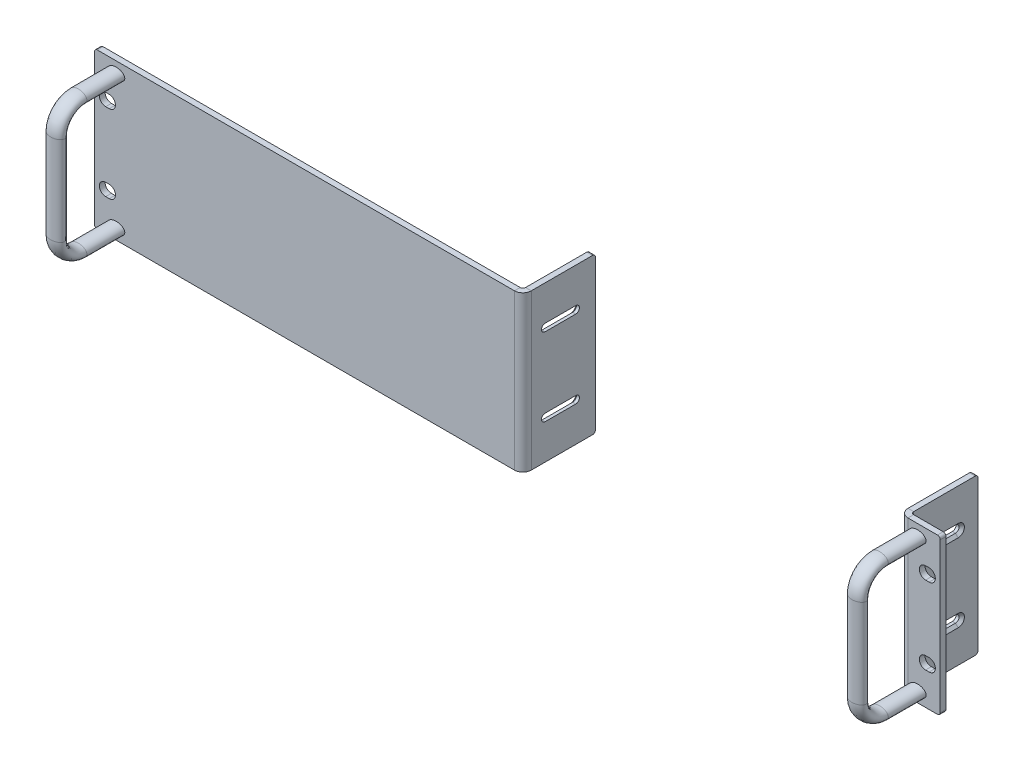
ISO-10303-21;
HEADER;
FILE_DESCRIPTION(('STEP AP214'),'2;1');
FILE_NAME('part.step','',(''),(''),'','','');
FILE_SCHEMA(('AUTOMOTIVE_DESIGN { 1 0 10303 214 1 1 1 1 }'));
ENDSEC;
DATA;
#1=APPLICATION_CONTEXT('core data for automotive mechanical design processes');
#2=APPLICATION_PROTOCOL_DEFINITION('international standard','automotive_design',2000,#1);
#3=PRODUCT_CONTEXT('',#1,'mechanical');
#4=PRODUCT('Part','Part','',(#3));
#5=PRODUCT_RELATED_PRODUCT_CATEGORY('part','',(#4));
#6=PRODUCT_DEFINITION_FORMATION('','',#4);
#7=PRODUCT_DEFINITION_CONTEXT('part definition',#1,'design');
#8=PRODUCT_DEFINITION('design','',#6,#7);
#9=PRODUCT_DEFINITION_SHAPE('','',#8);
#10=(LENGTH_UNIT() NAMED_UNIT(*) SI_UNIT(.MILLI.,.METRE.));
#11=(NAMED_UNIT(*) PLANE_ANGLE_UNIT() SI_UNIT($,.RADIAN.));
#12=(NAMED_UNIT(*) SI_UNIT($,.STERADIAN.) SOLID_ANGLE_UNIT());
#13=UNCERTAINTY_MEASURE_WITH_UNIT(LENGTH_MEASURE(1.E-05),#10,'distance_accuracy_value','');
#14=(GEOMETRIC_REPRESENTATION_CONTEXT(3) GLOBAL_UNCERTAINTY_ASSIGNED_CONTEXT((#13)) GLOBAL_UNIT_ASSIGNED_CONTEXT((#10,
#11,#12)) REPRESENTATION_CONTEXT('',''));
#15=CARTESIAN_POINT('',(0.,0.,0.));
#16=DIRECTION('',(0.,0.,1.));
#17=DIRECTION('',(1.,0.,0.));
#18=AXIS2_PLACEMENT_3D('',#15,#16,#17);
#19=CARTESIAN_POINT('',(-228.982699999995,-38.1000000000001,24.7650000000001));
#20=DIRECTION('',(0.,0.,-1.));
#21=DIRECTION('',(-1.,0.,0.));
#22=AXIS2_PLACEMENT_3D('',#19,#20,#21);
#23=ELLIPSE('',#22,4.88490465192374,3.11316991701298);
#24=DIRECTION('',(0.,0.,-1.));
#25=VECTOR('',#24,1.);
#26=SURFACE_OF_LINEAR_EXTRUSION('',#23,#25);
#27=CARTESIAN_POINT('',(-233.867604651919,-38.1000000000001,24.7650000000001));
#28=VERTEX_POINT('',#27);
#29=EDGE_CURVE('P0_E24',#28,#28,#23,.T.);
#30=ORIENTED_EDGE('',*,*,#29,.T.);
#31=EDGE_LOOP('',(#30));
#32=FACE_BOUND('',#31,.T.);
#33=CARTESIAN_POINT('',(-228.982699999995,-38.1000000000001,3.17500000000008));
#34=DIRECTION('',(0.,0.,-1.));
#35=DIRECTION('',(-1.,0.,0.));
#36=AXIS2_PLACEMENT_3D('',#33,#34,#35);
#37=ELLIPSE('',#36,4.88490465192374,3.11316991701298);
#38=CARTESIAN_POINT('',(-233.867604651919,-38.1000000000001,3.17500000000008));
#39=VERTEX_POINT('',#38);
#40=EDGE_CURVE('P0_E11',#39,#39,#37,.T.);
#41=ORIENTED_EDGE('',*,*,#40,.F.);
#42=EDGE_LOOP('',(#41));
#43=FACE_BOUND('',#42,.T.);
#44=ADVANCED_FACE('P0_F17',(#32,#43),#26,.T.);
#45=CARTESIAN_POINT('',(-228.982699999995,-25.4000000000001,37.4650000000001));
#46=DIRECTION('',(0.,-1.,0.));
#47=DIRECTION('',(-1.,0.,0.));
#48=AXIS2_PLACEMENT_3D('',#45,#46,#47);
#49=ELLIPSE('',#48,4.88490465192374,3.11316991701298);
#50=CARTESIAN_POINT('',(-233.867604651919,-25.4000000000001,24.7650000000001));
#51=DIRECTION('',(1.,0.,0.));
#52=AXIS1_PLACEMENT('',#50,#51);
#53=SURFACE_OF_REVOLUTION('',#49,#52);
#54=CARTESIAN_POINT('',(-233.867604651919,-25.4000000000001,37.4650000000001));
#55=VERTEX_POINT('',#54);
#56=EDGE_CURVE('P0_E74',#55,#55,#49,.T.);
#57=ORIENTED_EDGE('',*,*,#56,.T.);
#58=EDGE_LOOP('',(#57));
#59=FACE_BOUND('',#58,.T.);
#60=ORIENTED_EDGE('',*,*,#29,.F.);
#61=EDGE_LOOP('',(#60));
#62=FACE_BOUND('',#61,.T.);
#63=ADVANCED_FACE('P0_F69',(#59,#62),#53,.F.);
#64=CARTESIAN_POINT('',(-228.982699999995,25.3999999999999,37.4650000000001));
#65=DIRECTION('',(0.,-1.,0.));
#66=DIRECTION('',(-1.,0.,0.));
#67=AXIS2_PLACEMENT_3D('',#64,#65,#66);
#68=ELLIPSE('',#67,4.88490465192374,3.11316991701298);
#69=DIRECTION('',(0.,-1.,0.));
#70=VECTOR('',#69,1.);
#71=SURFACE_OF_LINEAR_EXTRUSION('',#68,#70);
#72=CARTESIAN_POINT('',(-233.867604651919,25.3999999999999,37.4650000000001));
#73=VERTEX_POINT('',#72);
#74=EDGE_CURVE('P0_E56',#73,#73,#68,.T.);
#75=ORIENTED_EDGE('',*,*,#74,.T.);
#76=EDGE_LOOP('',(#75));
#77=FACE_BOUND('',#76,.T.);
#78=ORIENTED_EDGE('',*,*,#56,.F.);
#79=EDGE_LOOP('',(#78));
#80=FACE_BOUND('',#79,.T.);
#81=ADVANCED_FACE('P0_F66',(#77,#80),#71,.T.);
#82=CARTESIAN_POINT('',(-228.982699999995,38.0999999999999,24.7650000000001));
#83=DIRECTION('',(0.,0.,1.));
#84=DIRECTION('',(-1.,0.,0.));
#85=AXIS2_PLACEMENT_3D('',#82,#83,#84);
#86=ELLIPSE('',#85,4.88490465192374,3.11316991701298);
#87=CARTESIAN_POINT('',(-233.867604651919,25.3999999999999,24.7650000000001));
#88=DIRECTION('',(1.,0.,0.));
#89=AXIS1_PLACEMENT('',#87,#88);
#90=SURFACE_OF_REVOLUTION('',#86,#89);
#91=CARTESIAN_POINT('',(-233.867604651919,38.0999999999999,24.7650000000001));
#92=VERTEX_POINT('',#91);
#93=EDGE_CURVE('P0_E52',#92,#92,#86,.T.);
#94=ORIENTED_EDGE('',*,*,#93,.T.);
#95=EDGE_LOOP('',(#94));
#96=FACE_BOUND('',#95,.T.);
#97=ORIENTED_EDGE('',*,*,#74,.F.);
#98=EDGE_LOOP('',(#97));
#99=FACE_BOUND('',#98,.T.);
#100=ADVANCED_FACE('P0_F63',(#96,#99),#90,.F.);
#101=DIRECTION('',(0.,0.,-1.));
#102=VECTOR('',#101,1.);
#103=SURFACE_OF_LINEAR_EXTRUSION('',#86,#102);
#104=ORIENTED_EDGE('',*,*,#93,.F.);
#105=EDGE_LOOP('',(#104));
#106=FACE_BOUND('',#105,.T.);
#107=CARTESIAN_POINT('',(-228.982699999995,38.0999999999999,3.17500000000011));
#108=DIRECTION('',(0.,0.,1.));
#109=DIRECTION('',(-1.,0.,0.));
#110=AXIS2_PLACEMENT_3D('',#107,#108,#109);
#111=ELLIPSE('',#110,4.88490465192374,3.11316991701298);
#112=CARTESIAN_POINT('',(-233.867604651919,38.0999999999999,3.17500000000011));
#113=VERTEX_POINT('',#112);
#114=EDGE_CURVE('P0_E51',#113,#113,#111,.T.);
#115=ORIENTED_EDGE('',*,*,#114,.T.);
#116=EDGE_LOOP('',(#115));
#117=FACE_BOUND('',#116,.T.);
#118=ADVANCED_FACE('P0_F60',(#106,#117),#103,.F.);
#119=CARTESIAN_POINT('',(-228.982699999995,-38.1000000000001,3.17500000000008));
#120=DIRECTION('',(0.,0.,-1.));
#121=DIRECTION('',(1.,0.,0.));
#122=AXIS2_PLACEMENT_3D('',#119,#120,#121);
#123=PLANE('',#122);
#124=CARTESIAN_POINT('',(-228.982699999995,-38.1000000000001,3.17500000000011));
#125=DIRECTION('',(0.,0.,-1.));
#126=DIRECTION('',(-1.,0.,0.));
#127=AXIS2_PLACEMENT_3D('',#124,#125,#126);
#128=CIRCLE('',#127,1.7272);
#129=CARTESIAN_POINT('',(-230.709899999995,-38.1000000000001,3.17500000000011));
#130=VERTEX_POINT('',#129);
#131=EDGE_CURVE('P0_E41',#130,#130,#128,.T.);
#132=ORIENTED_EDGE('',*,*,#131,.F.);
#133=EDGE_LOOP('',(#132));
#134=FACE_BOUND('',#133,.T.);
#135=ORIENTED_EDGE('',*,*,#40,.T.);
#136=EDGE_LOOP('',(#135));
#137=FACE_BOUND('',#136,.T.);
#138=ADVANCED_FACE('P0_F123',(#134,#137),#123,.T.);
#139=CARTESIAN_POINT('',(-228.982699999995,38.0999999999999,3.17500000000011));
#140=DIRECTION('',(0.,0.,1.));
#141=DIRECTION('',(1.,0.,0.));
#142=AXIS2_PLACEMENT_3D('',#139,#140,#141);
#143=PLANE('',#142);
#144=CARTESIAN_POINT('',(-228.982699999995,38.0999999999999,3.17500000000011));
#145=DIRECTION('',(0.,0.,-1.));
#146=DIRECTION('',(-1.,0.,0.));
#147=AXIS2_PLACEMENT_3D('',#144,#145,#146);
#148=CIRCLE('',#147,1.7272);
#149=CARTESIAN_POINT('',(-230.709899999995,38.0999999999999,3.17500000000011));
#150=VERTEX_POINT('',#149);
#151=EDGE_CURVE('P0_E40',#150,#150,#148,.T.);
#152=ORIENTED_EDGE('',*,*,#151,.F.);
#153=EDGE_LOOP('',(#152));
#154=FACE_BOUND('',#153,.T.);
#155=ORIENTED_EDGE('',*,*,#114,.F.);
#156=EDGE_LOOP('',(#155));
#157=FACE_BOUND('',#156,.T.);
#158=ADVANCED_FACE('P0_F132',(#154,#157),#143,.F.);
#159=CARTESIAN_POINT('',(-228.982699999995,38.0999999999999,13.8836400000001));
#160=DIRECTION('',(0.,0.,-1.));
#161=DIRECTION('',(-1.,0.,0.));
#162=AXIS2_PLACEMENT_3D('',#159,#160,#161);
#163=CONICAL_SURFACE('',#162,1.7272,1.02974425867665);
#164=CARTESIAN_POINT('',(-228.982699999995,38.0999999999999,14.9214464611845));
#165=VERTEX_POINT('',#164);
#166=VERTEX_LOOP('',#165);
#167=FACE_BOUND('',#166,.T.);
#168=CARTESIAN_POINT('',(-228.982699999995,38.0999999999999,13.8836400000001));
#169=DIRECTION('',(0.,0.,-1.));
#170=DIRECTION('',(-1.,0.,0.));
#171=AXIS2_PLACEMENT_3D('',#168,#169,#170);
#172=CIRCLE('',#171,1.7272);
#173=CARTESIAN_POINT('',(-230.709899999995,38.0999999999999,13.8836400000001));
#174=VERTEX_POINT('',#173);
#175=EDGE_CURVE('P0_E44',#174,#174,#172,.T.);
#176=ORIENTED_EDGE('',*,*,#175,.T.);
#177=EDGE_LOOP('',(#176));
#178=FACE_BOUND('',#177,.T.);
#179=ADVANCED_FACE('P0_F142',(#167,#178),#163,.F.);
#180=CARTESIAN_POINT('',(-228.982699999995,38.0999999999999,3.17500000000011));
#181=DIRECTION('',(0.,0.,-1.));
#182=DIRECTION('',(-1.,0.,0.));
#183=AXIS2_PLACEMENT_3D('',#180,#181,#182);
#184=CYLINDRICAL_SURFACE('',#183,1.7272);
#185=ORIENTED_EDGE('',*,*,#175,.F.);
#186=EDGE_LOOP('',(#185));
#187=FACE_BOUND('',#186,.T.);
#188=ORIENTED_EDGE('',*,*,#151,.T.);
#189=EDGE_LOOP('',(#188));
#190=FACE_BOUND('',#189,.T.);
#191=ADVANCED_FACE('P0_F34',(#187,#190),#184,.F.);
#192=CARTESIAN_POINT('',(-228.982699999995,-38.1000000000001,13.8836400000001));
#193=DIRECTION('',(0.,0.,-1.));
#194=DIRECTION('',(-1.,0.,0.));
#195=AXIS2_PLACEMENT_3D('',#192,#193,#194);
#196=CONICAL_SURFACE('',#195,1.7272,1.02974425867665);
#197=CARTESIAN_POINT('',(-228.982699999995,-38.1000000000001,14.9214464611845));
#198=VERTEX_POINT('',#197);
#199=VERTEX_LOOP('',#198);
#200=FACE_BOUND('',#199,.T.);
#201=CARTESIAN_POINT('',(-228.982699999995,-38.1000000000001,13.8836400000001));
#202=DIRECTION('',(0.,0.,-1.));
#203=DIRECTION('',(-1.,0.,0.));
#204=AXIS2_PLACEMENT_3D('',#201,#202,#203);
#205=CIRCLE('',#204,1.7272);
#206=CARTESIAN_POINT('',(-230.709899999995,-38.1000000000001,13.8836400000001));
#207=VERTEX_POINT('',#206);
#208=EDGE_CURVE('P0_E38',#207,#207,#205,.T.);
#209=ORIENTED_EDGE('',*,*,#208,.T.);
#210=EDGE_LOOP('',(#209));
#211=FACE_BOUND('',#210,.T.);
#212=ADVANCED_FACE('P0_F30',(#200,#211),#196,.F.);
#213=CARTESIAN_POINT('',(-228.982699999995,-38.1000000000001,3.17500000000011));
#214=DIRECTION('',(0.,0.,-1.));
#215=DIRECTION('',(-1.,0.,0.));
#216=AXIS2_PLACEMENT_3D('',#213,#214,#215);
#217=CYLINDRICAL_SURFACE('',#216,1.7272);
#218=ORIENTED_EDGE('',*,*,#208,.F.);
#219=EDGE_LOOP('',(#218));
#220=FACE_BOUND('',#219,.T.);
#221=ORIENTED_EDGE('',*,*,#131,.T.);
#222=EDGE_LOOP('',(#221));
#223=FACE_BOUND('',#222,.T.);
#224=ADVANCED_FACE('P0_F33',(#220,#223),#217,.F.);
#225=CLOSED_SHELL('',(#44,#63,#81,#100,#118,#138,#158,#179,#191,#212,#224));
#226=MANIFOLD_SOLID_BREP('P0_B1',#225);
#227=CARTESIAN_POINT('',(228.346000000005,-38.1,24.765));
#228=DIRECTION('',(0.,0.,-1.));
#229=DIRECTION('',(-1.,0.,0.));
#230=AXIS2_PLACEMENT_3D('',#227,#228,#229);
#231=ELLIPSE('',#230,4.88490465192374,3.11316991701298);
#232=DIRECTION('',(0.,0.,-1.));
#233=VECTOR('',#232,1.);
#234=SURFACE_OF_LINEAR_EXTRUSION('',#231,#233);
#235=CARTESIAN_POINT('',(223.461095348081,-38.1,24.765));
#236=VERTEX_POINT('',#235);
#237=EDGE_CURVE('P1_E23',#236,#236,#231,.T.);
#238=ORIENTED_EDGE('',*,*,#237,.T.);
#239=EDGE_LOOP('',(#238));
#240=FACE_BOUND('',#239,.T.);
#241=CARTESIAN_POINT('',(228.346000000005,-38.1,3.17499999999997));
#242=DIRECTION('',(0.,0.,-1.));
#243=DIRECTION('',(-1.,0.,0.));
#244=AXIS2_PLACEMENT_3D('',#241,#242,#243);
#245=ELLIPSE('',#244,4.88490465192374,3.11316991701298);
#246=CARTESIAN_POINT('',(223.461095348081,-38.1,3.17499999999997));
#247=VERTEX_POINT('',#246);
#248=EDGE_CURVE('P1_E10',#247,#247,#245,.T.);
#249=ORIENTED_EDGE('',*,*,#248,.F.);
#250=EDGE_LOOP('',(#249));
#251=FACE_BOUND('',#250,.T.);
#252=ADVANCED_FACE('P1_F16',(#240,#251),#234,.T.);
#253=CARTESIAN_POINT('',(228.346000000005,-25.4,37.465));
#254=DIRECTION('',(0.,-1.,0.));
#255=DIRECTION('',(-1.,0.,0.));
#256=AXIS2_PLACEMENT_3D('',#253,#254,#255);
#257=ELLIPSE('',#256,4.88490465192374,3.11316991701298);
#258=CARTESIAN_POINT('',(223.461095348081,-25.4,24.765));
#259=DIRECTION('',(1.,0.,0.));
#260=AXIS1_PLACEMENT('',#258,#259);
#261=SURFACE_OF_REVOLUTION('',#257,#260);
#262=CARTESIAN_POINT('',(223.461095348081,-25.4,37.465));
#263=VERTEX_POINT('',#262);
#264=EDGE_CURVE('P1_E73',#263,#263,#257,.T.);
#265=ORIENTED_EDGE('',*,*,#264,.T.);
#266=EDGE_LOOP('',(#265));
#267=FACE_BOUND('',#266,.T.);
#268=ORIENTED_EDGE('',*,*,#237,.F.);
#269=EDGE_LOOP('',(#268));
#270=FACE_BOUND('',#269,.T.);
#271=ADVANCED_FACE('P1_F68',(#267,#270),#261,.F.);
#272=CARTESIAN_POINT('',(228.346000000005,25.4,37.465));
#273=DIRECTION('',(0.,-1.,0.));
#274=DIRECTION('',(-1.,0.,0.));
#275=AXIS2_PLACEMENT_3D('',#272,#273,#274);
#276=ELLIPSE('',#275,4.88490465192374,3.11316991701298);
#277=DIRECTION('',(0.,-1.,0.));
#278=VECTOR('',#277,1.);
#279=SURFACE_OF_LINEAR_EXTRUSION('',#276,#278);
#280=CARTESIAN_POINT('',(223.461095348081,25.4,37.465));
#281=VERTEX_POINT('',#280);
#282=EDGE_CURVE('P1_E55',#281,#281,#276,.T.);
#283=ORIENTED_EDGE('',*,*,#282,.T.);
#284=EDGE_LOOP('',(#283));
#285=FACE_BOUND('',#284,.T.);
#286=ORIENTED_EDGE('',*,*,#264,.F.);
#287=EDGE_LOOP('',(#286));
#288=FACE_BOUND('',#287,.T.);
#289=ADVANCED_FACE('P1_F65',(#285,#288),#279,.T.);
#290=CARTESIAN_POINT('',(228.346000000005,38.1,24.765));
#291=DIRECTION('',(0.,0.,1.));
#292=DIRECTION('',(-1.,0.,0.));
#293=AXIS2_PLACEMENT_3D('',#290,#291,#292);
#294=ELLIPSE('',#293,4.88490465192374,3.11316991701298);
#295=CARTESIAN_POINT('',(223.461095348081,25.4,24.765));
#296=DIRECTION('',(1.,0.,0.));
#297=AXIS1_PLACEMENT('',#295,#296);
#298=SURFACE_OF_REVOLUTION('',#294,#297);
#299=CARTESIAN_POINT('',(223.461095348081,38.1,24.765));
#300=VERTEX_POINT('',#299);
#301=EDGE_CURVE('P1_E51',#300,#300,#294,.T.);
#302=ORIENTED_EDGE('',*,*,#301,.T.);
#303=EDGE_LOOP('',(#302));
#304=FACE_BOUND('',#303,.T.);
#305=ORIENTED_EDGE('',*,*,#282,.F.);
#306=EDGE_LOOP('',(#305));
#307=FACE_BOUND('',#306,.T.);
#308=ADVANCED_FACE('P1_F62',(#304,#307),#298,.F.);
#309=DIRECTION('',(0.,0.,-1.));
#310=VECTOR('',#309,1.);
#311=SURFACE_OF_LINEAR_EXTRUSION('',#294,#310);
#312=ORIENTED_EDGE('',*,*,#301,.F.);
#313=EDGE_LOOP('',(#312));
#314=FACE_BOUND('',#313,.T.);
#315=CARTESIAN_POINT('',(228.346000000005,38.1,3.175));
#316=DIRECTION('',(0.,0.,1.));
#317=DIRECTION('',(-1.,0.,0.));
#318=AXIS2_PLACEMENT_3D('',#315,#316,#317);
#319=ELLIPSE('',#318,4.88490465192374,3.11316991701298);
#320=CARTESIAN_POINT('',(223.461095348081,38.1,3.175));
#321=VERTEX_POINT('',#320);
#322=EDGE_CURVE('P1_E50',#321,#321,#319,.T.);
#323=ORIENTED_EDGE('',*,*,#322,.T.);
#324=EDGE_LOOP('',(#323));
#325=FACE_BOUND('',#324,.T.);
#326=ADVANCED_FACE('P1_F59',(#314,#325),#311,.F.);
#327=CARTESIAN_POINT('',(228.346000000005,-38.1,3.17499999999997));
#328=DIRECTION('',(0.,0.,-1.));
#329=DIRECTION('',(1.,0.,0.));
#330=AXIS2_PLACEMENT_3D('',#327,#328,#329);
#331=PLANE('',#330);
#332=CARTESIAN_POINT('',(228.346000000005,-38.1,3.175));
#333=DIRECTION('',(0.,0.,-1.));
#334=DIRECTION('',(-1.,0.,0.));
#335=AXIS2_PLACEMENT_3D('',#332,#333,#334);
#336=CIRCLE('',#335,1.7272);
#337=CARTESIAN_POINT('',(226.618800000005,-38.1,3.175));
#338=VERTEX_POINT('',#337);
#339=EDGE_CURVE('P1_E40',#338,#338,#336,.T.);
#340=ORIENTED_EDGE('',*,*,#339,.F.);
#341=EDGE_LOOP('',(#340));
#342=FACE_BOUND('',#341,.T.);
#343=ORIENTED_EDGE('',*,*,#248,.T.);
#344=EDGE_LOOP('',(#343));
#345=FACE_BOUND('',#344,.T.);
#346=ADVANCED_FACE('P1_F122',(#342,#345),#331,.T.);
#347=CARTESIAN_POINT('',(228.346000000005,38.1,3.175));
#348=DIRECTION('',(0.,0.,1.));
#349=DIRECTION('',(1.,0.,0.));
#350=AXIS2_PLACEMENT_3D('',#347,#348,#349);
#351=PLANE('',#350);
#352=CARTESIAN_POINT('',(228.346000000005,38.1,3.175));
#353=DIRECTION('',(0.,0.,-1.));
#354=DIRECTION('',(-1.,0.,0.));
#355=AXIS2_PLACEMENT_3D('',#352,#353,#354);
#356=CIRCLE('',#355,1.7272);
#357=CARTESIAN_POINT('',(226.618800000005,38.1,3.175));
#358=VERTEX_POINT('',#357);
#359=EDGE_CURVE('P1_E39',#358,#358,#356,.T.);
#360=ORIENTED_EDGE('',*,*,#359,.F.);
#361=EDGE_LOOP('',(#360));
#362=FACE_BOUND('',#361,.T.);
#363=ORIENTED_EDGE('',*,*,#322,.F.);
#364=EDGE_LOOP('',(#363));
#365=FACE_BOUND('',#364,.T.);
#366=ADVANCED_FACE('P1_F131',(#362,#365),#351,.F.);
#367=CARTESIAN_POINT('',(228.346000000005,38.1,13.88364));
#368=DIRECTION('',(0.,0.,-1.));
#369=DIRECTION('',(-1.,0.,0.));
#370=AXIS2_PLACEMENT_3D('',#367,#368,#369);
#371=CONICAL_SURFACE('',#370,1.7272,1.02974425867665);
#372=CARTESIAN_POINT('',(228.346000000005,38.1,14.9214464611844));
#373=VERTEX_POINT('',#372);
#374=VERTEX_LOOP('',#373);
#375=FACE_BOUND('',#374,.T.);
#376=CARTESIAN_POINT('',(228.346000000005,38.1,13.88364));
#377=DIRECTION('',(0.,0.,-1.));
#378=DIRECTION('',(-1.,0.,0.));
#379=AXIS2_PLACEMENT_3D('',#376,#377,#378);
#380=CIRCLE('',#379,1.7272);
#381=CARTESIAN_POINT('',(226.618800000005,38.1,13.88364));
#382=VERTEX_POINT('',#381);
#383=EDGE_CURVE('P1_E43',#382,#382,#380,.T.);
#384=ORIENTED_EDGE('',*,*,#383,.T.);
#385=EDGE_LOOP('',(#384));
#386=FACE_BOUND('',#385,.T.);
#387=ADVANCED_FACE('P1_F141',(#375,#386),#371,.F.);
#388=CARTESIAN_POINT('',(228.346000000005,38.1,3.175));
#389=DIRECTION('',(0.,0.,-1.));
#390=DIRECTION('',(-1.,0.,0.));
#391=AXIS2_PLACEMENT_3D('',#388,#389,#390);
#392=CYLINDRICAL_SURFACE('',#391,1.7272);
#393=ORIENTED_EDGE('',*,*,#383,.F.);
#394=EDGE_LOOP('',(#393));
#395=FACE_BOUND('',#394,.T.);
#396=ORIENTED_EDGE('',*,*,#359,.T.);
#397=EDGE_LOOP('',(#396));
#398=FACE_BOUND('',#397,.T.);
#399=ADVANCED_FACE('P1_F33',(#395,#398),#392,.F.);
#400=CARTESIAN_POINT('',(228.346000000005,-38.1,13.88364));
#401=DIRECTION('',(0.,0.,-1.));
#402=DIRECTION('',(-1.,0.,0.));
#403=AXIS2_PLACEMENT_3D('',#400,#401,#402);
#404=CONICAL_SURFACE('',#403,1.7272,1.02974425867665);
#405=CARTESIAN_POINT('',(228.346000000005,-38.1,14.9214464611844));
#406=VERTEX_POINT('',#405);
#407=VERTEX_LOOP('',#406);
#408=FACE_BOUND('',#407,.T.);
#409=CARTESIAN_POINT('',(228.346000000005,-38.1,13.88364));
#410=DIRECTION('',(0.,0.,-1.));
#411=DIRECTION('',(-1.,0.,0.));
#412=AXIS2_PLACEMENT_3D('',#409,#410,#411);
#413=CIRCLE('',#412,1.7272);
#414=CARTESIAN_POINT('',(226.618800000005,-38.1,13.88364));
#415=VERTEX_POINT('',#414);
#416=EDGE_CURVE('P1_E37',#415,#415,#413,.T.);
#417=ORIENTED_EDGE('',*,*,#416,.T.);
#418=EDGE_LOOP('',(#417));
#419=FACE_BOUND('',#418,.T.);
#420=ADVANCED_FACE('P1_F29',(#408,#419),#404,.F.);
#421=CARTESIAN_POINT('',(228.346000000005,-38.1,3.175));
#422=DIRECTION('',(0.,0.,-1.));
#423=DIRECTION('',(-1.,0.,0.));
#424=AXIS2_PLACEMENT_3D('',#421,#422,#423);
#425=CYLINDRICAL_SURFACE('',#424,1.7272);
#426=ORIENTED_EDGE('',*,*,#416,.F.);
#427=EDGE_LOOP('',(#426));
#428=FACE_BOUND('',#427,.T.);
#429=ORIENTED_EDGE('',*,*,#339,.T.);
#430=EDGE_LOOP('',(#429));
#431=FACE_BOUND('',#430,.T.);
#432=ADVANCED_FACE('P1_F32',(#428,#431),#425,.F.);
#433=CLOSED_SHELL('',(#252,#271,#289,#308,#326,#346,#366,#387,#399,#420,#432));
#434=MANIFOLD_SOLID_BREP('P1_B1',#433);
#435=CARTESIAN_POINT('',(221.361000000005,-44.323,-0.0888999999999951));
#436=DIRECTION('',(0.,0.,1.));
#437=DIRECTION('',(-1.,0.,0.));
#438=AXIS2_PLACEMENT_3D('',#435,#436,#437);
#439=PLANE('',#438);
#440=CARTESIAN_POINT('',(234.950000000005,-22.225,-0.088900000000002));
#441=DIRECTION('',(0.,0.,1.));
#442=DIRECTION('',(-1.,0.,0.));
#443=AXIS2_PLACEMENT_3D('',#440,#441,#442);
#444=CIRCLE('',#443,3.556);
#445=CARTESIAN_POINT('',(234.950000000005,-18.669,-0.088900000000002));
#446=VERTEX_POINT('',#445);
#447=CARTESIAN_POINT('',(234.950000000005,-25.781,-0.088900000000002));
#448=VERTEX_POINT('',#447);
#449=EDGE_CURVE('P2_E290',#446,#448,#444,.F.);
#450=ORIENTED_EDGE('',*,*,#449,.F.);
#451=DIRECTION('',(1.,0.,0.));
#452=VECTOR('',#451,1.);
#453=CARTESIAN_POINT('',(218.186000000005,-18.669,-0.0888999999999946));
#454=LINE('',#453,#452);
#455=CARTESIAN_POINT('',(232.918000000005,-18.669,-0.0888999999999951));
#456=VERTEX_POINT('',#455);
#457=EDGE_CURVE('P2_E293',#456,#446,#454,.T.);
#458=ORIENTED_EDGE('',*,*,#457,.F.);
#459=CARTESIAN_POINT('',(232.918000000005,-22.225,-0.0888999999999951));
#460=DIRECTION('',(0.,0.,1.));
#461=DIRECTION('',(-1.,0.,0.));
#462=AXIS2_PLACEMENT_3D('',#459,#460,#461);
#463=CIRCLE('',#462,3.556);
#464=CARTESIAN_POINT('',(232.918000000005,-25.781,-0.0888999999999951));
#465=VERTEX_POINT('',#464);
#466=EDGE_CURVE('P2_E310',#465,#456,#463,.F.);
#467=ORIENTED_EDGE('',*,*,#466,.F.);
#468=DIRECTION('',(1.,0.,0.));
#469=VECTOR('',#468,1.);
#470=CARTESIAN_POINT('',(218.186000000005,-25.781,-0.0888999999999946));
#471=LINE('',#470,#469);
#472=EDGE_CURVE('P2_E264',#465,#448,#471,.T.);
#473=ORIENTED_EDGE('',*,*,#472,.T.);
#474=EDGE_LOOP('',(#450,#458,#467,#473));
#475=FACE_BOUND('',#474,.T.);
#476=DIRECTION('',(1.,0.,0.));
#477=VECTOR('',#476,1.);
#478=CARTESIAN_POINT('',(221.361000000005,44.323,-0.0888999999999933));
#479=LINE('',#478,#477);
#480=CARTESIAN_POINT('',(222.885000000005,44.323,-0.0888999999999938));
#481=VERTEX_POINT('',#480);
#482=CARTESIAN_POINT('',(239.712500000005,44.323,-0.088899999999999));
#483=VERTEX_POINT('',#482);
#484=EDGE_CURVE('P2_E352',#481,#483,#479,.T.);
#485=ORIENTED_EDGE('',*,*,#484,.T.);
#486=CARTESIAN_POINT('',(239.712500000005,42.7355,-0.088899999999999));
#487=DIRECTION('',(0.,0.,1.));
#488=DIRECTION('',(-1.,0.,0.));
#489=AXIS2_PLACEMENT_3D('',#486,#487,#488);
#490=CIRCLE('',#489,1.5875);
#491=CARTESIAN_POINT('',(241.300000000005,42.7355,-0.0888999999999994));
#492=VERTEX_POINT('',#491);
#493=EDGE_CURVE('P2_E437',#483,#492,#490,.F.);
#494=ORIENTED_EDGE('',*,*,#493,.T.);
#495=DIRECTION('',(0.,1.,0.));
#496=VECTOR('',#495,1.);
#497=CARTESIAN_POINT('',(241.300000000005,-44.323,-0.0889000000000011));
#498=LINE('',#497,#496);
#499=CARTESIAN_POINT('',(241.300000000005,-42.7355,-0.0889000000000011));
#500=VERTEX_POINT('',#499);
#501=EDGE_CURVE('P2_E355',#500,#492,#498,.T.);
#502=ORIENTED_EDGE('',*,*,#501,.F.);
#503=CARTESIAN_POINT('',(239.712500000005,-42.7355,-0.0889000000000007));
#504=DIRECTION('',(0.,0.,1.));
#505=DIRECTION('',(-1.,0.,0.));
#506=AXIS2_PLACEMENT_3D('',#503,#504,#505);
#507=CIRCLE('',#506,1.5875);
#508=CARTESIAN_POINT('',(239.712500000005,-44.323,-0.0889000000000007));
#509=VERTEX_POINT('',#508);
#510=EDGE_CURVE('P2_E435',#500,#509,#507,.F.);
#511=ORIENTED_EDGE('',*,*,#510,.T.);
#512=DIRECTION('',(1.,0.,0.));
#513=VECTOR('',#512,1.);
#514=CARTESIAN_POINT('',(221.361000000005,-44.323,-0.0888999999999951));
#515=LINE('',#514,#513);
#516=CARTESIAN_POINT('',(222.885000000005,-44.323,-0.0888999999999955));
#517=VERTEX_POINT('',#516);
#518=EDGE_CURVE('P2_E359',#517,#509,#515,.T.);
#519=ORIENTED_EDGE('',*,*,#518,.F.);
#520=DIRECTION('',(0.,1.,0.));
#521=VECTOR('',#520,1.);
#522=CARTESIAN_POINT('',(222.885000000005,44.323,-0.0888999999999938));
#523=LINE('',#522,#521);
#524=EDGE_CURVE('P2_E369',#517,#481,#523,.T.);
#525=ORIENTED_EDGE('',*,*,#524,.T.);
#526=EDGE_LOOP('',(#485,#494,#502,#511,#519,#525));
#527=FACE_BOUND('',#526,.T.);
#528=CARTESIAN_POINT('',(232.918000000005,22.225,-0.0888999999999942));
#529=DIRECTION('',(0.,0.,1.));
#530=DIRECTION('',(-1.,0.,0.));
#531=AXIS2_PLACEMENT_3D('',#528,#529,#530);
#532=CIRCLE('',#531,3.556);
#533=CARTESIAN_POINT('',(232.918000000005,25.781,-0.0888999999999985));
#534=VERTEX_POINT('',#533);
#535=CARTESIAN_POINT('',(232.918000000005,18.669,-0.0888999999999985));
#536=VERTEX_POINT('',#535);
#537=EDGE_CURVE('P2_E324',#534,#536,#532,.T.);
#538=ORIENTED_EDGE('',*,*,#537,.T.);
#539=DIRECTION('',(1.,0.,0.));
#540=VECTOR('',#539,1.);
#541=CARTESIAN_POINT('',(218.186000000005,18.669,-0.0888999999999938));
#542=LINE('',#541,#540);
#543=CARTESIAN_POINT('',(234.950000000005,18.669,-0.0888999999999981));
#544=VERTEX_POINT('',#543);
#545=EDGE_CURVE('P2_E342',#536,#544,#542,.T.);
#546=ORIENTED_EDGE('',*,*,#545,.T.);
#547=CARTESIAN_POINT('',(234.950000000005,22.225,-0.0889000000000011));
#548=DIRECTION('',(0.,0.,1.));
#549=DIRECTION('',(-1.,0.,0.));
#550=AXIS2_PLACEMENT_3D('',#547,#548,#549);
#551=CIRCLE('',#550,3.556);
#552=CARTESIAN_POINT('',(234.950000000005,25.781,-0.0889000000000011));
#553=VERTEX_POINT('',#552);
#554=EDGE_CURVE('P2_E319',#544,#553,#551,.T.);
#555=ORIENTED_EDGE('',*,*,#554,.T.);
#556=DIRECTION('',(1.,0.,0.));
#557=VECTOR('',#556,1.);
#558=CARTESIAN_POINT('',(218.186000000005,25.781,-0.0888999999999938));
#559=LINE('',#558,#557);
#560=EDGE_CURVE('P2_E322',#534,#553,#559,.T.);
#561=ORIENTED_EDGE('',*,*,#560,.F.);
#562=EDGE_LOOP('',(#538,#546,#555,#561));
#563=FACE_BOUND('',#562,.T.);
#564=CARTESIAN_POINT('',(228.346000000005,38.1,-0.0888999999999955));
#565=DIRECTION('',(0.,0.,-1.));
#566=DIRECTION('',(1.,0.,0.));
#567=AXIS2_PLACEMENT_3D('',#564,#565,#566);
#568=CIRCLE('',#567,4.064);
#569=CARTESIAN_POINT('',(232.410000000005,38.1,-0.0888999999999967));
#570=VERTEX_POINT('',#569);
#571=EDGE_CURVE('P2_E947',#570,#570,#568,.T.);
#572=ORIENTED_EDGE('',*,*,#571,.F.);
#573=EDGE_LOOP('',(#572));
#574=FACE_BOUND('',#573,.T.);
#575=CARTESIAN_POINT('',(228.346000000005,-38.1,-0.0888999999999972));
#576=DIRECTION('',(0.,0.,-1.));
#577=DIRECTION('',(1.,0.,0.));
#578=AXIS2_PLACEMENT_3D('',#575,#576,#577);
#579=CIRCLE('',#578,4.064);
#580=CARTESIAN_POINT('',(232.410000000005,-38.1,-0.0888999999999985));
#581=VERTEX_POINT('',#580);
#582=EDGE_CURVE('P2_E494',#581,#581,#579,.T.);
#583=ORIENTED_EDGE('',*,*,#582,.F.);
#584=EDGE_LOOP('',(#583));
#585=FACE_BOUND('',#584,.T.);
#586=ADVANCED_FACE('P2_F17',(#475,#527,#563,#574,#585),#439,.F.);
#587=CARTESIAN_POINT('',(221.361000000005,-44.323,3.175));
#588=DIRECTION('',(0.,0.,1.));
#589=DIRECTION('',(-1.,0.,0.));
#590=AXIS2_PLACEMENT_3D('',#587,#588,#589);
#591=PLANE('',#590);
#592=DIRECTION('',(-1.,0.,0.));
#593=VECTOR('',#592,1.);
#594=CARTESIAN_POINT('',(218.186000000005,18.669,3.17500000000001));
#595=LINE('',#594,#593);
#596=CARTESIAN_POINT('',(234.950000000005,18.669,3.175));
#597=VERTEX_POINT('',#596);
#598=CARTESIAN_POINT('',(232.918000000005,18.669,3.175));
#599=VERTEX_POINT('',#598);
#600=EDGE_CURVE('P2_E330',#597,#599,#595,.T.);
#601=ORIENTED_EDGE('',*,*,#600,.T.);
#602=CARTESIAN_POINT('',(232.918000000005,22.225,3.17500000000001));
#603=DIRECTION('',(0.,0.,1.));
#604=DIRECTION('',(-1.,0.,0.));
#605=AXIS2_PLACEMENT_3D('',#602,#603,#604);
#606=CIRCLE('',#605,3.556);
#607=CARTESIAN_POINT('',(232.918000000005,25.781,3.17500000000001));
#608=VERTEX_POINT('',#607);
#609=EDGE_CURVE('P2_E327',#599,#608,#606,.F.);
#610=ORIENTED_EDGE('',*,*,#609,.T.);
#611=DIRECTION('',(-1.,0.,0.));
#612=VECTOR('',#611,1.);
#613=CARTESIAN_POINT('',(218.186000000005,25.781,3.17500000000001));
#614=LINE('',#613,#612);
#615=CARTESIAN_POINT('',(234.950000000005,25.781,3.17500000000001));
#616=VERTEX_POINT('',#615);
#617=EDGE_CURVE('P2_E336',#616,#608,#614,.T.);
#618=ORIENTED_EDGE('',*,*,#617,.F.);
#619=CARTESIAN_POINT('',(234.950000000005,22.225,3.17500000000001));
#620=DIRECTION('',(0.,0.,1.));
#621=DIRECTION('',(-1.,0.,0.));
#622=AXIS2_PLACEMENT_3D('',#619,#620,#621);
#623=CIRCLE('',#622,3.556);
#624=EDGE_CURVE('P2_E333',#616,#597,#623,.F.);
#625=ORIENTED_EDGE('',*,*,#624,.T.);
#626=EDGE_LOOP('',(#601,#610,#618,#625));
#627=FACE_BOUND('',#626,.T.);
#628=DIRECTION('',(0.,-1.,0.));
#629=VECTOR('',#628,1.);
#630=CARTESIAN_POINT('',(241.300000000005,-44.323,3.175));
#631=LINE('',#630,#629);
#632=CARTESIAN_POINT('',(241.300000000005,-42.7355,3.175));
#633=VERTEX_POINT('',#632);
#634=CARTESIAN_POINT('',(241.300000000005,42.7355,3.175));
#635=VERTEX_POINT('',#634);
#636=EDGE_CURVE('P2_E401',#633,#635,#631,.F.);
#637=ORIENTED_EDGE('',*,*,#636,.T.);
#638=CARTESIAN_POINT('',(239.712500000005,42.7355,3.175));
#639=DIRECTION('',(0.,0.,1.));
#640=DIRECTION('',(-1.,0.,0.));
#641=AXIS2_PLACEMENT_3D('',#638,#639,#640);
#642=CIRCLE('',#641,1.5875);
#643=CARTESIAN_POINT('',(239.712500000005,44.323,3.175));
#644=VERTEX_POINT('',#643);
#645=EDGE_CURVE('P2_E446',#635,#644,#642,.T.);
#646=ORIENTED_EDGE('',*,*,#645,.T.);
#647=DIRECTION('',(-1.,0.,0.));
#648=VECTOR('',#647,1.);
#649=CARTESIAN_POINT('',(221.361000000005,44.323,3.17500000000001));
#650=LINE('',#649,#648);
#651=CARTESIAN_POINT('',(222.885000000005,44.323,3.17500000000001));
#652=VERTEX_POINT('',#651);
#653=EDGE_CURVE('P2_E398',#652,#644,#650,.F.);
#654=ORIENTED_EDGE('',*,*,#653,.F.);
#655=DIRECTION('',(0.,-1.,0.));
#656=VECTOR('',#655,1.);
#657=CARTESIAN_POINT('',(222.885000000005,-44.323,3.175));
#658=LINE('',#657,#656);
#659=CARTESIAN_POINT('',(222.885000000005,-44.323,3.175));
#660=VERTEX_POINT('',#659);
#661=EDGE_CURVE('P2_E384',#660,#652,#658,.F.);
#662=ORIENTED_EDGE('',*,*,#661,.F.);
#663=DIRECTION('',(-1.,0.,0.));
#664=VECTOR('',#663,1.);
#665=CARTESIAN_POINT('',(221.361000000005,-44.323,3.175));
#666=LINE('',#665,#664);
#667=CARTESIAN_POINT('',(239.712500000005,-44.323,3.175));
#668=VERTEX_POINT('',#667);
#669=EDGE_CURVE('P2_E391',#660,#668,#666,.F.);
#670=ORIENTED_EDGE('',*,*,#669,.T.);
#671=CARTESIAN_POINT('',(239.712500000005,-42.7355,3.175));
#672=DIRECTION('',(0.,0.,1.));
#673=DIRECTION('',(-1.,0.,0.));
#674=AXIS2_PLACEMENT_3D('',#671,#672,#673);
#675=CIRCLE('',#674,1.5875);
#676=EDGE_CURVE('P2_E444',#668,#633,#675,.T.);
#677=ORIENTED_EDGE('',*,*,#676,.T.);
#678=EDGE_LOOP('',(#637,#646,#654,#662,#670,#677));
#679=FACE_BOUND('',#678,.T.);
#680=DIRECTION('',(-1.,0.,0.));
#681=VECTOR('',#680,1.);
#682=CARTESIAN_POINT('',(218.186000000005,-18.669,3.17500000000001));
#683=LINE('',#682,#681);
#684=CARTESIAN_POINT('',(234.950000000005,-18.669,3.175));
#685=VERTEX_POINT('',#684);
#686=CARTESIAN_POINT('',(232.918000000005,-18.669,3.17500000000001));
#687=VERTEX_POINT('',#686);
#688=EDGE_CURVE('P2_E296',#685,#687,#683,.T.);
#689=ORIENTED_EDGE('',*,*,#688,.F.);
#690=CARTESIAN_POINT('',(234.950000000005,-22.225,3.175));
#691=DIRECTION('',(0.,0.,1.));
#692=DIRECTION('',(-1.,0.,0.));
#693=AXIS2_PLACEMENT_3D('',#690,#691,#692);
#694=CIRCLE('',#693,3.556);
#695=CARTESIAN_POINT('',(234.950000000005,-25.781,3.175));
#696=VERTEX_POINT('',#695);
#697=EDGE_CURVE('P2_E304',#696,#685,#694,.T.);
#698=ORIENTED_EDGE('',*,*,#697,.F.);
#699=DIRECTION('',(-1.,0.,0.));
#700=VECTOR('',#699,1.);
#701=CARTESIAN_POINT('',(218.186000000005,-25.781,3.17500000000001));
#702=LINE('',#701,#700);
#703=CARTESIAN_POINT('',(232.918000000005,-25.781,3.175));
#704=VERTEX_POINT('',#703);
#705=EDGE_CURVE('P2_E301',#696,#704,#702,.T.);
#706=ORIENTED_EDGE('',*,*,#705,.T.);
#707=CARTESIAN_POINT('',(232.918000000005,-22.225,3.175));
#708=DIRECTION('',(0.,0.,1.));
#709=DIRECTION('',(-1.,0.,0.));
#710=AXIS2_PLACEMENT_3D('',#707,#708,#709);
#711=CIRCLE('',#710,3.556);
#712=EDGE_CURVE('P2_E298',#687,#704,#711,.T.);
#713=ORIENTED_EDGE('',*,*,#712,.F.);
#714=EDGE_LOOP('',(#689,#698,#706,#713));
#715=FACE_BOUND('',#714,.T.);
#716=CARTESIAN_POINT('',(228.346000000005,38.1,3.17500000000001));
#717=DIRECTION('',(0.,0.,-1.));
#718=DIRECTION('',(1.,0.,0.));
#719=AXIS2_PLACEMENT_3D('',#716,#717,#718);
#720=CIRCLE('',#719,2.2479);
#721=CARTESIAN_POINT('',(230.593900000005,38.1,3.17500000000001));
#722=VERTEX_POINT('',#721);
#723=EDGE_CURVE('P2_E257',#722,#722,#720,.T.);
#724=ORIENTED_EDGE('',*,*,#723,.T.);
#725=EDGE_LOOP('',(#724));
#726=FACE_BOUND('',#725,.T.);
#727=CARTESIAN_POINT('',(228.346000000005,-38.1,3.17500000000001));
#728=DIRECTION('',(0.,0.,-1.));
#729=DIRECTION('',(1.,0.,0.));
#730=AXIS2_PLACEMENT_3D('',#727,#728,#729);
#731=CIRCLE('',#730,2.2479);
#732=CARTESIAN_POINT('',(230.593900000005,-38.1,3.17500000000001));
#733=VERTEX_POINT('',#732);
#734=EDGE_CURVE('P2_E954',#733,#733,#731,.T.);
#735=ORIENTED_EDGE('',*,*,#734,.T.);
#736=EDGE_LOOP('',(#735));
#737=FACE_BOUND('',#736,.T.);
#738=ADVANCED_FACE('P2_F533',(#627,#679,#715,#726,#737),#591,.T.);
#739=CARTESIAN_POINT('',(221.361000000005,44.323,-0.0888999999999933));
#740=DIRECTION('',(0.,-1.,0.));
#741=DIRECTION('',(1.,0.,0.));
#742=AXIS2_PLACEMENT_3D('',#739,#740,#741);
#743=PLANE('',#742);
#744=ORIENTED_EDGE('',*,*,#653,.T.);
#745=DIRECTION('',(0.,0.,-1.));
#746=VECTOR('',#745,1.);
#747=CARTESIAN_POINT('',(239.712500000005,44.323,-0.088899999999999));
#748=LINE('',#747,#746);
#749=EDGE_CURVE('P2_E432',#644,#483,#748,.T.);
#750=ORIENTED_EDGE('',*,*,#749,.T.);
#751=ORIENTED_EDGE('',*,*,#484,.F.);
#752=DIRECTION('',(0.,0.,-1.));
#753=VECTOR('',#752,1.);
#754=CARTESIAN_POINT('',(222.885000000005,44.323,-0.0888999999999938));
#755=LINE('',#754,#753);
#756=EDGE_CURVE('P2_E413',#652,#481,#755,.T.);
#757=ORIENTED_EDGE('',*,*,#756,.F.);
#758=EDGE_LOOP('',(#744,#750,#751,#757));
#759=FACE_BOUND('',#758,.T.);
#760=ADVANCED_FACE('P2_F539',(#759),#743,.F.);
#761=CARTESIAN_POINT('',(241.300000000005,-44.323,-0.0889000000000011));
#762=DIRECTION('',(1.,0.,0.));
#763=DIRECTION('',(0.,1.,0.));
#764=AXIS2_PLACEMENT_3D('',#761,#762,#763);
#765=PLANE('',#764);
#766=ORIENTED_EDGE('',*,*,#501,.T.);
#767=DIRECTION('',(0.,0.,1.));
#768=VECTOR('',#767,1.);
#769=CARTESIAN_POINT('',(241.300000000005,42.7355,-0.0888999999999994));
#770=LINE('',#769,#768);
#771=EDGE_CURVE('P2_E442',#492,#635,#770,.T.);
#772=ORIENTED_EDGE('',*,*,#771,.T.);
#773=ORIENTED_EDGE('',*,*,#636,.F.);
#774=DIRECTION('',(0.,0.,-1.));
#775=VECTOR('',#774,1.);
#776=CARTESIAN_POINT('',(241.300000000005,-42.7355,-0.0889000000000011));
#777=LINE('',#776,#775);
#778=EDGE_CURVE('P2_E439',#633,#500,#777,.T.);
#779=ORIENTED_EDGE('',*,*,#778,.T.);
#780=EDGE_LOOP('',(#766,#772,#773,#779));
#781=FACE_BOUND('',#780,.T.);
#782=ADVANCED_FACE('P2_F581',(#781),#765,.T.);
#783=CARTESIAN_POINT('',(221.361000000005,-44.323,-0.0888999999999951));
#784=DIRECTION('',(0.,-1.,0.));
#785=DIRECTION('',(1.,0.,0.));
#786=AXIS2_PLACEMENT_3D('',#783,#784,#785);
#787=PLANE('',#786);
#788=ORIENTED_EDGE('',*,*,#518,.T.);
#789=DIRECTION('',(0.,0.,-1.));
#790=VECTOR('',#789,1.);
#791=CARTESIAN_POINT('',(239.712500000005,-44.323,-0.0889000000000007));
#792=LINE('',#791,#790);
#793=EDGE_CURVE('P2_E448',#509,#668,#792,.F.);
#794=ORIENTED_EDGE('',*,*,#793,.T.);
#795=ORIENTED_EDGE('',*,*,#669,.F.);
#796=DIRECTION('',(0.,0.,-1.));
#797=VECTOR('',#796,1.);
#798=CARTESIAN_POINT('',(222.885000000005,-44.323,-0.0888999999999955));
#799=LINE('',#798,#797);
#800=EDGE_CURVE('P2_E411',#660,#517,#799,.T.);
#801=ORIENTED_EDGE('',*,*,#800,.T.);
#802=EDGE_LOOP('',(#788,#794,#795,#801));
#803=FACE_BOUND('',#802,.T.);
#804=ADVANCED_FACE('P2_F577',(#803),#787,.T.);
#805=CARTESIAN_POINT('',(222.885000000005,-44.323,-1.6129));
#806=DIRECTION('',(0.,-1.,0.));
#807=DIRECTION('',(-1.,0.,0.));
#808=AXIS2_PLACEMENT_3D('',#805,#806,#807);
#809=PLANE('',#808);
#810=ORIENTED_EDGE('',*,*,#800,.F.);
#811=CARTESIAN_POINT('',(222.885000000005,-44.323,-1.6129));
#812=DIRECTION('',(0.,-1.,0.));
#813=DIRECTION('',(-1.,0.,0.));
#814=AXIS2_PLACEMENT_3D('',#811,#812,#813);
#815=CIRCLE('',#814,4.7879);
#816=CARTESIAN_POINT('',(218.097100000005,-44.323,-1.61289999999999));
#817=VERTEX_POINT('',#816);
#818=EDGE_CURVE('P2_E395',#660,#817,#815,.T.);
#819=ORIENTED_EDGE('',*,*,#818,.T.);
#820=DIRECTION('',(1.,0.,0.));
#821=VECTOR('',#820,1.);
#822=CARTESIAN_POINT('',(221.361000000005,-44.323,-1.61289999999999));
#823=LINE('',#822,#821);
#824=CARTESIAN_POINT('',(221.361000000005,-44.323,-1.61289999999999));
#825=VERTEX_POINT('',#824);
#826=EDGE_CURVE('P2_E408',#817,#825,#823,.T.);
#827=ORIENTED_EDGE('',*,*,#826,.T.);
#828=CARTESIAN_POINT('',(222.885000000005,-44.323,-1.6129));
#829=DIRECTION('',(0.,1.,0.));
#830=DIRECTION('',(1.,0.,0.));
#831=AXIS2_PLACEMENT_3D('',#828,#829,#830);
#832=CIRCLE('',#831,1.524);
#833=EDGE_CURVE('P2_E356',#517,#825,#832,.F.);
#834=ORIENTED_EDGE('',*,*,#833,.F.);
#835=EDGE_LOOP('',(#810,#819,#827,#834));
#836=FACE_BOUND('',#835,.T.);
#837=ADVANCED_FACE('P2_F573',(#836),#809,.T.);
#838=CARTESIAN_POINT('',(221.361000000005,-44.323,-38.3159));
#839=DIRECTION('',(0.,-1.,0.));
#840=DIRECTION('',(0.,0.,1.));
#841=AXIS2_PLACEMENT_3D('',#838,#839,#840);
#842=PLANE('',#841);
#843=DIRECTION('',(0.,0.,-1.));
#844=VECTOR('',#843,1.);
#845=CARTESIAN_POINT('',(218.097100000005,-44.323,-38.3159));
#846=LINE('',#845,#844);
#847=CARTESIAN_POINT('',(218.097100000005,-44.323,-36.7284));
#848=VERTEX_POINT('',#847);
#849=EDGE_CURVE('P2_E390',#848,#817,#846,.F.);
#850=ORIENTED_EDGE('',*,*,#849,.F.);
#851=DIRECTION('',(-1.,0.,0.));
#852=VECTOR('',#851,1.);
#853=CARTESIAN_POINT('',(221.361000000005,-44.323,-36.7284));
#854=LINE('',#853,#852);
#855=CARTESIAN_POINT('',(221.361000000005,-44.323,-36.7284));
#856=VERTEX_POINT('',#855);
#857=EDGE_CURVE('P2_E450',#848,#856,#854,.F.);
#858=ORIENTED_EDGE('',*,*,#857,.T.);
#859=DIRECTION('',(0.,0.,1.));
#860=VECTOR('',#859,1.);
#861=CARTESIAN_POINT('',(221.361000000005,-44.323,-38.3159));
#862=LINE('',#861,#860);
#863=EDGE_CURVE('P2_E364',#856,#825,#862,.T.);
#864=ORIENTED_EDGE('',*,*,#863,.T.);
#865=ORIENTED_EDGE('',*,*,#826,.F.);
#866=EDGE_LOOP('',(#850,#858,#864,#865));
#867=FACE_BOUND('',#866,.T.);
#868=ADVANCED_FACE('P2_F569',(#867),#842,.T.);
#869=CARTESIAN_POINT('',(221.361000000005,-44.323,-38.3159));
#870=DIRECTION('',(0.,0.,1.));
#871=DIRECTION('',(0.,1.,0.));
#872=AXIS2_PLACEMENT_3D('',#869,#870,#871);
#873=PLANE('',#872);
#874=DIRECTION('',(0.,-1.,0.));
#875=VECTOR('',#874,1.);
#876=CARTESIAN_POINT('',(218.097100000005,-44.323,-38.3159));
#877=LINE('',#876,#875);
#878=CARTESIAN_POINT('',(218.097100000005,-42.7355,-38.3159));
#879=VERTEX_POINT('',#878);
#880=CARTESIAN_POINT('',(218.097100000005,42.7355,-38.3159));
#881=VERTEX_POINT('',#880);
#882=EDGE_CURVE('P2_E387',#879,#881,#877,.F.);
#883=ORIENTED_EDGE('',*,*,#882,.T.);
#884=DIRECTION('',(-1.,0.,0.));
#885=VECTOR('',#884,1.);
#886=CARTESIAN_POINT('',(221.361000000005,42.7355,-38.3159));
#887=LINE('',#886,#885);
#888=CARTESIAN_POINT('',(221.361000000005,42.7355,-38.3159));
#889=VERTEX_POINT('',#888);
#890=EDGE_CURVE('P2_E419',#881,#889,#887,.F.);
#891=ORIENTED_EDGE('',*,*,#890,.T.);
#892=DIRECTION('',(0.,1.,0.));
#893=VECTOR('',#892,1.);
#894=CARTESIAN_POINT('',(221.361000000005,-44.323,-38.3159));
#895=LINE('',#894,#893);
#896=CARTESIAN_POINT('',(221.361000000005,-42.7355,-38.3159));
#897=VERTEX_POINT('',#896);
#898=EDGE_CURVE('P2_E366',#897,#889,#895,.T.);
#899=ORIENTED_EDGE('',*,*,#898,.F.);
#900=DIRECTION('',(1.,0.,0.));
#901=VECTOR('',#900,1.);
#902=CARTESIAN_POINT('',(221.361000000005,-42.7355,-38.3159));
#903=LINE('',#902,#901);
#904=EDGE_CURVE('P2_E415',#897,#879,#903,.F.);
#905=ORIENTED_EDGE('',*,*,#904,.T.);
#906=EDGE_LOOP('',(#883,#891,#899,#905));
#907=FACE_BOUND('',#906,.T.);
#908=ADVANCED_FACE('P2_F565',(#907),#873,.F.);
#909=CARTESIAN_POINT('',(221.361000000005,44.323,-38.3159));
#910=DIRECTION('',(0.,-1.,0.));
#911=DIRECTION('',(0.,0.,1.));
#912=AXIS2_PLACEMENT_3D('',#909,#910,#911);
#913=PLANE('',#912);
#914=DIRECTION('',(0.,0.,1.));
#915=VECTOR('',#914,1.);
#916=CARTESIAN_POINT('',(221.361000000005,44.323,-38.3159));
#917=LINE('',#916,#915);
#918=CARTESIAN_POINT('',(221.361000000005,44.323,-36.7284));
#919=VERTEX_POINT('',#918);
#920=CARTESIAN_POINT('',(221.361000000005,44.323,-1.61289999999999));
#921=VERTEX_POINT('',#920);
#922=EDGE_CURVE('P2_E362',#919,#921,#917,.T.);
#923=ORIENTED_EDGE('',*,*,#922,.F.);
#924=DIRECTION('',(-1.,0.,0.));
#925=VECTOR('',#924,1.);
#926=CARTESIAN_POINT('',(221.361000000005,44.323,-36.7284));
#927=LINE('',#926,#925);
#928=CARTESIAN_POINT('',(218.097100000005,44.323,-36.7284));
#929=VERTEX_POINT('',#928);
#930=EDGE_CURVE('P2_E426',#919,#929,#927,.T.);
#931=ORIENTED_EDGE('',*,*,#930,.T.);
#932=DIRECTION('',(0.,0.,-1.));
#933=VECTOR('',#932,1.);
#934=CARTESIAN_POINT('',(218.097100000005,44.323,-38.3159));
#935=LINE('',#934,#933);
#936=CARTESIAN_POINT('',(218.097100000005,44.323,-1.61289999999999));
#937=VERTEX_POINT('',#936);
#938=EDGE_CURVE('P2_E388',#929,#937,#935,.F.);
#939=ORIENTED_EDGE('',*,*,#938,.T.);
#940=DIRECTION('',(1.,0.,0.));
#941=VECTOR('',#940,1.);
#942=CARTESIAN_POINT('',(221.361000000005,44.323,-1.61289999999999));
#943=LINE('',#942,#941);
#944=EDGE_CURVE('P2_E375',#937,#921,#943,.T.);
#945=ORIENTED_EDGE('',*,*,#944,.T.);
#946=EDGE_LOOP('',(#923,#931,#939,#945));
#947=FACE_BOUND('',#946,.T.);
#948=ADVANCED_FACE('P2_F562',(#947),#913,.F.);
#949=CARTESIAN_POINT('',(222.885000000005,44.323,-1.61289999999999));
#950=DIRECTION('',(0.,1.,0.));
#951=DIRECTION('',(1.,0.,0.));
#952=AXIS2_PLACEMENT_3D('',#949,#950,#951);
#953=PLANE('',#952);
#954=CARTESIAN_POINT('',(222.885000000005,44.323,-1.61289999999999));
#955=DIRECTION('',(0.,-1.,0.));
#956=DIRECTION('',(-1.,0.,0.));
#957=AXIS2_PLACEMENT_3D('',#954,#955,#956);
#958=CIRCLE('',#957,4.7879);
#959=EDGE_CURVE('P2_E351',#937,#652,#958,.F.);
#960=ORIENTED_EDGE('',*,*,#959,.T.);
#961=ORIENTED_EDGE('',*,*,#756,.T.);
#962=CARTESIAN_POINT('',(222.885000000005,44.323,-1.61289999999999));
#963=DIRECTION('',(0.,-1.,0.));
#964=DIRECTION('',(-1.,0.,0.));
#965=AXIS2_PLACEMENT_3D('',#962,#963,#964);
#966=CIRCLE('',#965,1.524);
#967=EDGE_CURVE('P2_E376',#921,#481,#966,.F.);
#968=ORIENTED_EDGE('',*,*,#967,.F.);
#969=ORIENTED_EDGE('',*,*,#944,.F.);
#970=EDGE_LOOP('',(#960,#961,#968,#969));
#971=FACE_BOUND('',#970,.T.);
#972=ADVANCED_FACE('P2_F551',(#971),#953,.T.);
#973=CARTESIAN_POINT('',(221.361000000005,-44.323,-38.3159));
#974=DIRECTION('',(-1.,0.,0.));
#975=DIRECTION('',(0.,0.,-1.));
#976=AXIS2_PLACEMENT_3D('',#973,#974,#975);
#977=PLANE('',#976);
#978=CARTESIAN_POINT('',(221.361000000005,22.225,-26.9875));
#979=DIRECTION('',(-1.,0.,0.));
#980=DIRECTION('',(0.,0.,-1.));
#981=AXIS2_PLACEMENT_3D('',#978,#979,#980);
#982=CIRCLE('',#981,3.55599999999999);
#983=CARTESIAN_POINT('',(221.361000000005,25.781,-26.9875));
#984=VERTEX_POINT('',#983);
#985=CARTESIAN_POINT('',(221.361000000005,18.669,-26.9875));
#986=VERTEX_POINT('',#985);
#987=EDGE_CURVE('P2_E469',#984,#986,#982,.T.);
#988=ORIENTED_EDGE('',*,*,#987,.T.);
#989=DIRECTION('',(0.,0.,1.));
#990=VECTOR('',#989,1.);
#991=CARTESIAN_POINT('',(221.361000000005,18.669,-38.3159));
#992=LINE('',#991,#990);
#993=CARTESIAN_POINT('',(221.361000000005,18.669,-9.52500000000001));
#994=VERTEX_POINT('',#993);
#995=EDGE_CURVE('P2_E471',#986,#994,#992,.T.);
#996=ORIENTED_EDGE('',*,*,#995,.T.);
#997=CARTESIAN_POINT('',(221.361000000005,22.225,-9.52500000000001));
#998=DIRECTION('',(-1.,0.,0.));
#999=DIRECTION('',(0.,0.,-1.));
#1000=AXIS2_PLACEMENT_3D('',#997,#998,#999);
#1001=CIRCLE('',#1000,3.55599999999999);
#1002=CARTESIAN_POINT('',(221.361000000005,25.781,-9.52500000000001));
#1003=VERTEX_POINT('',#1002);
#1004=EDGE_CURVE('P2_E467',#994,#1003,#1001,.T.);
#1005=ORIENTED_EDGE('',*,*,#1004,.T.);
#1006=DIRECTION('',(0.,0.,-1.));
#1007=VECTOR('',#1006,1.);
#1008=CARTESIAN_POINT('',(221.361000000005,25.781,-38.3159));
#1009=LINE('',#1008,#1007);
#1010=EDGE_CURVE('P2_E465',#1003,#984,#1009,.T.);
#1011=ORIENTED_EDGE('',*,*,#1010,.T.);
#1012=EDGE_LOOP('',(#988,#996,#1005,#1011));
#1013=FACE_BOUND('',#1012,.T.);
#1014=CARTESIAN_POINT('',(221.361000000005,-22.225,-26.9875));
#1015=DIRECTION('',(-1.,0.,0.));
#1016=DIRECTION('',(0.,0.,-1.));
#1017=AXIS2_PLACEMENT_3D('',#1014,#1015,#1016);
#1018=CIRCLE('',#1017,3.55599999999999);
#1019=CARTESIAN_POINT('',(221.361000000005,-18.669,-26.9875));
#1020=VERTEX_POINT('',#1019);
#1021=CARTESIAN_POINT('',(221.361000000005,-25.781,-26.9875));
#1022=VERTEX_POINT('',#1021);
#1023=EDGE_CURVE('P2_E460',#1020,#1022,#1018,.T.);
#1024=ORIENTED_EDGE('',*,*,#1023,.T.);
#1025=DIRECTION('',(0.,0.,1.));
#1026=VECTOR('',#1025,1.);
#1027=CARTESIAN_POINT('',(221.361000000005,-25.781,-38.3159));
#1028=LINE('',#1027,#1026);
#1029=CARTESIAN_POINT('',(221.361000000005,-25.781,-9.52500000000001));
#1030=VERTEX_POINT('',#1029);
#1031=EDGE_CURVE('P2_E462',#1022,#1030,#1028,.T.);
#1032=ORIENTED_EDGE('',*,*,#1031,.T.);
#1033=CARTESIAN_POINT('',(221.361000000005,-22.225,-9.52500000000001));
#1034=DIRECTION('',(-1.,0.,0.));
#1035=DIRECTION('',(0.,0.,-1.));
#1036=AXIS2_PLACEMENT_3D('',#1033,#1034,#1035);
#1037=CIRCLE('',#1036,3.55599999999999);
#1038=CARTESIAN_POINT('',(221.361000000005,-18.669,-9.52500000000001));
#1039=VERTEX_POINT('',#1038);
#1040=EDGE_CURVE('P2_E458',#1030,#1039,#1037,.T.);
#1041=ORIENTED_EDGE('',*,*,#1040,.T.);
#1042=DIRECTION('',(0.,0.,-1.));
#1043=VECTOR('',#1042,1.);
#1044=CARTESIAN_POINT('',(221.361000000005,-18.669,-38.3159));
#1045=LINE('',#1044,#1043);
#1046=EDGE_CURVE('P2_E456',#1039,#1020,#1045,.T.);
#1047=ORIENTED_EDGE('',*,*,#1046,.T.);
#1048=EDGE_LOOP('',(#1024,#1032,#1041,#1047));
#1049=FACE_BOUND('',#1048,.T.);
#1050=ORIENTED_EDGE('',*,*,#898,.T.);
#1051=CARTESIAN_POINT('',(221.361000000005,42.7355,-36.7284));
#1052=DIRECTION('',(-1.,0.,0.));
#1053=DIRECTION('',(0.,0.,-1.));
#1054=AXIS2_PLACEMENT_3D('',#1051,#1052,#1053);
#1055=CIRCLE('',#1054,1.5875);
#1056=EDGE_CURVE('P2_E424',#889,#919,#1055,.F.);
#1057=ORIENTED_EDGE('',*,*,#1056,.T.);
#1058=ORIENTED_EDGE('',*,*,#922,.T.);
#1059=DIRECTION('',(0.,1.,0.));
#1060=VECTOR('',#1059,1.);
#1061=CARTESIAN_POINT('',(221.361000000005,-44.323,-1.6129));
#1062=LINE('',#1061,#1060);
#1063=EDGE_CURVE('P2_E372',#921,#825,#1062,.F.);
#1064=ORIENTED_EDGE('',*,*,#1063,.T.);
#1065=ORIENTED_EDGE('',*,*,#863,.F.);
#1066=CARTESIAN_POINT('',(221.361000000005,-42.7355,-36.7284));
#1067=DIRECTION('',(-1.,0.,0.));
#1068=DIRECTION('',(0.,0.,-1.));
#1069=AXIS2_PLACEMENT_3D('',#1066,#1067,#1068);
#1070=CIRCLE('',#1069,1.5875);
#1071=EDGE_CURVE('P2_E422',#856,#897,#1070,.F.);
#1072=ORIENTED_EDGE('',*,*,#1071,.T.);
#1073=EDGE_LOOP('',(#1050,#1057,#1058,#1064,#1065,#1072));
#1074=FACE_BOUND('',#1073,.T.);
#1075=ADVANCED_FACE('P2_F511',(#1013,#1049,#1074),#977,.F.);
#1076=CARTESIAN_POINT('',(222.885000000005,-44.323,-1.6129));
#1077=DIRECTION('',(0.,-1.,0.));
#1078=DIRECTION('',(-1.,0.,0.));
#1079=AXIS2_PLACEMENT_3D('',#1076,#1077,#1078);
#1080=CYLINDRICAL_SURFACE('',#1079,1.524);
#1081=ORIENTED_EDGE('',*,*,#833,.T.);
#1082=ORIENTED_EDGE('',*,*,#1063,.F.);
#1083=ORIENTED_EDGE('',*,*,#967,.T.);
#1084=ORIENTED_EDGE('',*,*,#524,.F.);
#1085=EDGE_LOOP('',(#1081,#1082,#1083,#1084));
#1086=FACE_BOUND('',#1085,.T.);
#1087=ADVANCED_FACE('P2_F550',(#1086),#1080,.F.);
#1088=CARTESIAN_POINT('',(218.097100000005,-44.323,-38.3159));
#1089=DIRECTION('',(-1.,0.,0.));
#1090=DIRECTION('',(0.,0.,-1.));
#1091=AXIS2_PLACEMENT_3D('',#1088,#1089,#1090);
#1092=PLANE('',#1091);
#1093=CARTESIAN_POINT('',(218.097100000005,-22.225,-9.52500000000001));
#1094=DIRECTION('',(1.,0.,0.));
#1095=DIRECTION('',(0.,0.,1.));
#1096=AXIS2_PLACEMENT_3D('',#1093,#1094,#1095);
#1097=CIRCLE('',#1096,2.03199999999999);
#1098=CARTESIAN_POINT('',(218.097100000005,-20.193,-9.52500000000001));
#1099=VERTEX_POINT('',#1098);
#1100=CARTESIAN_POINT('',(218.097100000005,-24.257,-9.52500000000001));
#1101=VERTEX_POINT('',#1100);
#1102=EDGE_CURVE('P2_E231',#1099,#1101,#1097,.T.);
#1103=ORIENTED_EDGE('',*,*,#1102,.T.);
#1104=DIRECTION('',(0.,0.,-1.));
#1105=VECTOR('',#1104,1.);
#1106=CARTESIAN_POINT('',(218.097100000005,-24.257,-9.52500000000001));
#1107=LINE('',#1106,#1105);
#1108=CARTESIAN_POINT('',(218.097100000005,-24.257,-26.9875));
#1109=VERTEX_POINT('',#1108);
#1110=EDGE_CURVE('P2_E242',#1101,#1109,#1107,.T.);
#1111=ORIENTED_EDGE('',*,*,#1110,.T.);
#1112=CARTESIAN_POINT('',(218.097100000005,-22.225,-26.9875));
#1113=DIRECTION('',(1.,0.,0.));
#1114=DIRECTION('',(0.,0.,1.));
#1115=AXIS2_PLACEMENT_3D('',#1112,#1113,#1114);
#1116=CIRCLE('',#1115,2.032);
#1117=CARTESIAN_POINT('',(218.097100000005,-20.193,-26.9875));
#1118=VERTEX_POINT('',#1117);
#1119=EDGE_CURVE('P2_E246',#1109,#1118,#1116,.T.);
#1120=ORIENTED_EDGE('',*,*,#1119,.T.);
#1121=DIRECTION('',(0.,0.,1.));
#1122=VECTOR('',#1121,1.);
#1123=CARTESIAN_POINT('',(218.097100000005,-20.193,-9.52500000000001));
#1124=LINE('',#1123,#1122);
#1125=EDGE_CURVE('P2_E238',#1118,#1099,#1124,.T.);
#1126=ORIENTED_EDGE('',*,*,#1125,.T.);
#1127=EDGE_LOOP('',(#1103,#1111,#1120,#1126));
#1128=FACE_BOUND('',#1127,.T.);
#1129=CARTESIAN_POINT('',(218.097100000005,22.225,-9.52500000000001));
#1130=DIRECTION('',(1.,0.,0.));
#1131=DIRECTION('',(0.,0.,-1.));
#1132=AXIS2_PLACEMENT_3D('',#1129,#1130,#1131);
#1133=CIRCLE('',#1132,2.03199999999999);
#1134=CARTESIAN_POINT('',(218.097100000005,24.257,-9.52500000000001));
#1135=VERTEX_POINT('',#1134);
#1136=CARTESIAN_POINT('',(218.097100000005,20.193,-9.52500000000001));
#1137=VERTEX_POINT('',#1136);
#1138=EDGE_CURVE('P2_E268',#1135,#1137,#1133,.T.);
#1139=ORIENTED_EDGE('',*,*,#1138,.T.);
#1140=DIRECTION('',(0.,0.,-1.));
#1141=VECTOR('',#1140,1.);
#1142=CARTESIAN_POINT('',(218.097100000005,20.193,-9.52500000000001));
#1143=LINE('',#1142,#1141);
#1144=CARTESIAN_POINT('',(218.097100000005,20.193,-26.9875));
#1145=VERTEX_POINT('',#1144);
#1146=EDGE_CURVE('P2_E271',#1137,#1145,#1143,.T.);
#1147=ORIENTED_EDGE('',*,*,#1146,.T.);
#1148=CARTESIAN_POINT('',(218.097100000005,22.225,-26.9875));
#1149=DIRECTION('',(1.,0.,0.));
#1150=DIRECTION('',(0.,0.,-1.));
#1151=AXIS2_PLACEMENT_3D('',#1148,#1149,#1150);
#1152=CIRCLE('',#1151,2.032);
#1153=CARTESIAN_POINT('',(218.097100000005,24.257,-26.9875));
#1154=VERTEX_POINT('',#1153);
#1155=EDGE_CURVE('P2_E274',#1145,#1154,#1152,.T.);
#1156=ORIENTED_EDGE('',*,*,#1155,.T.);
#1157=DIRECTION('',(0.,0.,1.));
#1158=VECTOR('',#1157,1.);
#1159=CARTESIAN_POINT('',(218.097100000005,24.257,-9.52500000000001));
#1160=LINE('',#1159,#1158);
#1161=EDGE_CURVE('P2_E277',#1154,#1135,#1160,.T.);
#1162=ORIENTED_EDGE('',*,*,#1161,.T.);
#1163=EDGE_LOOP('',(#1139,#1147,#1156,#1162));
#1164=FACE_BOUND('',#1163,.T.);
#1165=ORIENTED_EDGE('',*,*,#938,.F.);
#1166=CARTESIAN_POINT('',(218.097100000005,42.7355,-36.7284));
#1167=DIRECTION('',(-1.,0.,0.));
#1168=DIRECTION('',(0.,0.,-1.));
#1169=AXIS2_PLACEMENT_3D('',#1166,#1167,#1168);
#1170=CIRCLE('',#1169,1.5875);
#1171=EDGE_CURVE('P2_E430',#929,#881,#1170,.T.);
#1172=ORIENTED_EDGE('',*,*,#1171,.T.);
#1173=ORIENTED_EDGE('',*,*,#882,.F.);
#1174=CARTESIAN_POINT('',(218.097100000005,-42.7355,-36.7284));
#1175=DIRECTION('',(-1.,0.,0.));
#1176=DIRECTION('',(0.,0.,-1.));
#1177=AXIS2_PLACEMENT_3D('',#1174,#1175,#1176);
#1178=CIRCLE('',#1177,1.5875);
#1179=EDGE_CURVE('P2_E428',#879,#848,#1178,.T.);
#1180=ORIENTED_EDGE('',*,*,#1179,.T.);
#1181=ORIENTED_EDGE('',*,*,#849,.T.);
#1182=DIRECTION('',(0.,-1.,0.));
#1183=VECTOR('',#1182,1.);
#1184=CARTESIAN_POINT('',(218.097100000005,-44.323,-1.61289999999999));
#1185=LINE('',#1184,#1183);
#1186=EDGE_CURVE('P2_E379',#937,#817,#1185,.T.);
#1187=ORIENTED_EDGE('',*,*,#1186,.F.);
#1188=EDGE_LOOP('',(#1165,#1172,#1173,#1180,#1181,#1187));
#1189=FACE_BOUND('',#1188,.T.);
#1190=ADVANCED_FACE('P2_F248',(#1128,#1164,#1189),#1092,.T.);
#1191=CARTESIAN_POINT('',(222.885000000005,-44.323,-1.6129));
#1192=DIRECTION('',(0.,-1.,0.));
#1193=DIRECTION('',(-1.,0.,0.));
#1194=AXIS2_PLACEMENT_3D('',#1191,#1192,#1193);
#1195=CYLINDRICAL_SURFACE('',#1194,4.7879);
#1196=ORIENTED_EDGE('',*,*,#818,.F.);
#1197=ORIENTED_EDGE('',*,*,#661,.T.);
#1198=ORIENTED_EDGE('',*,*,#959,.F.);
#1199=ORIENTED_EDGE('',*,*,#1186,.T.);
#1200=EDGE_LOOP('',(#1196,#1197,#1198,#1199));
#1201=FACE_BOUND('',#1200,.T.);
#1202=ADVANCED_FACE('P2_F557',(#1201),#1195,.T.);
#1203=CARTESIAN_POINT('',(232.918000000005,22.225,-38.3169));
#1204=DIRECTION('',(0.,0.,1.));
#1205=DIRECTION('',(-1.,0.,0.));
#1206=AXIS2_PLACEMENT_3D('',#1203,#1204,#1205);
#1207=CYLINDRICAL_SURFACE('',#1206,3.556);
#1208=DIRECTION('',(0.,0.,1.));
#1209=VECTOR('',#1208,1.);
#1210=CARTESIAN_POINT('',(232.918000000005,25.781,-38.3169));
#1211=LINE('',#1210,#1209);
#1212=EDGE_CURVE('P2_E340',#534,#608,#1211,.T.);
#1213=ORIENTED_EDGE('',*,*,#1212,.T.);
#1214=ORIENTED_EDGE('',*,*,#609,.F.);
#1215=DIRECTION('',(0.,0.,1.));
#1216=VECTOR('',#1215,1.);
#1217=CARTESIAN_POINT('',(232.918000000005,18.669,-38.3169));
#1218=LINE('',#1217,#1216);
#1219=EDGE_CURVE('P2_E339',#536,#599,#1218,.T.);
#1220=ORIENTED_EDGE('',*,*,#1219,.F.);
#1221=ORIENTED_EDGE('',*,*,#537,.F.);
#1222=EDGE_LOOP('',(#1213,#1214,#1220,#1221));
#1223=FACE_BOUND('',#1222,.T.);
#1224=ADVANCED_FACE('P2_F546',(#1223),#1207,.F.);
#1225=CARTESIAN_POINT('',(218.186000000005,25.781,-38.3169));
#1226=DIRECTION('',(0.,1.,0.));
#1227=DIRECTION('',(1.,0.,0.));
#1228=AXIS2_PLACEMENT_3D('',#1225,#1226,#1227);
#1229=PLANE('',#1228);
#1230=ORIENTED_EDGE('',*,*,#560,.T.);
#1231=DIRECTION('',(0.,0.,1.));
#1232=VECTOR('',#1231,1.);
#1233=CARTESIAN_POINT('',(234.950000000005,25.781,-38.3169));
#1234=LINE('',#1233,#1232);
#1235=EDGE_CURVE('P2_E343',#553,#616,#1234,.T.);
#1236=ORIENTED_EDGE('',*,*,#1235,.T.);
#1237=ORIENTED_EDGE('',*,*,#617,.T.);
#1238=ORIENTED_EDGE('',*,*,#1212,.F.);
#1239=EDGE_LOOP('',(#1230,#1236,#1237,#1238));
#1240=FACE_BOUND('',#1239,.T.);
#1241=ADVANCED_FACE('P2_F827',(#1240),#1229,.F.);
#1242=CARTESIAN_POINT('',(234.950000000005,22.225,-38.3169));
#1243=DIRECTION('',(0.,0.,1.));
#1244=DIRECTION('',(-1.,0.,0.));
#1245=AXIS2_PLACEMENT_3D('',#1242,#1243,#1244);
#1246=CYLINDRICAL_SURFACE('',#1245,3.556);
#1247=DIRECTION('',(0.,0.,1.));
#1248=VECTOR('',#1247,1.);
#1249=CARTESIAN_POINT('',(234.950000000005,18.669,-38.3169));
#1250=LINE('',#1249,#1248);
#1251=EDGE_CURVE('P2_E345',#544,#597,#1250,.T.);
#1252=ORIENTED_EDGE('',*,*,#1251,.T.);
#1253=ORIENTED_EDGE('',*,*,#624,.F.);
#1254=ORIENTED_EDGE('',*,*,#1235,.F.);
#1255=ORIENTED_EDGE('',*,*,#554,.F.);
#1256=EDGE_LOOP('',(#1252,#1253,#1254,#1255));
#1257=FACE_BOUND('',#1256,.T.);
#1258=ADVANCED_FACE('P2_F818',(#1257),#1246,.F.);
#1259=CARTESIAN_POINT('',(218.186000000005,18.669,-38.3169));
#1260=DIRECTION('',(0.,1.,0.));
#1261=DIRECTION('',(1.,0.,0.));
#1262=AXIS2_PLACEMENT_3D('',#1259,#1260,#1261);
#1263=PLANE('',#1262);
#1264=ORIENTED_EDGE('',*,*,#1219,.T.);
#1265=ORIENTED_EDGE('',*,*,#600,.F.);
#1266=ORIENTED_EDGE('',*,*,#1251,.F.);
#1267=ORIENTED_EDGE('',*,*,#545,.F.);
#1268=EDGE_LOOP('',(#1264,#1265,#1266,#1267));
#1269=FACE_BOUND('',#1268,.T.);
#1270=ADVANCED_FACE('P2_F808',(#1269),#1263,.T.);
#1271=CARTESIAN_POINT('',(218.186000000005,-18.669,-38.3169));
#1272=DIRECTION('',(0.,1.,0.));
#1273=DIRECTION('',(1.,0.,0.));
#1274=AXIS2_PLACEMENT_3D('',#1271,#1272,#1273);
#1275=PLANE('',#1274);
#1276=ORIENTED_EDGE('',*,*,#457,.T.);
#1277=DIRECTION('',(0.,0.,1.));
#1278=VECTOR('',#1277,1.);
#1279=CARTESIAN_POINT('',(234.950000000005,-18.669,-38.3169));
#1280=LINE('',#1279,#1278);
#1281=EDGE_CURVE('P2_E308',#446,#685,#1280,.T.);
#1282=ORIENTED_EDGE('',*,*,#1281,.T.);
#1283=ORIENTED_EDGE('',*,*,#688,.T.);
#1284=DIRECTION('',(0.,0.,1.));
#1285=VECTOR('',#1284,1.);
#1286=CARTESIAN_POINT('',(232.918000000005,-18.669,-38.3169));
#1287=LINE('',#1286,#1285);
#1288=EDGE_CURVE('P2_E307',#456,#687,#1287,.T.);
#1289=ORIENTED_EDGE('',*,*,#1288,.F.);
#1290=EDGE_LOOP('',(#1276,#1282,#1283,#1289));
#1291=FACE_BOUND('',#1290,.T.);
#1292=ADVANCED_FACE('P2_F798',(#1291),#1275,.F.);
#1293=CARTESIAN_POINT('',(234.950000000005,-22.225,-38.3169));
#1294=DIRECTION('',(0.,0.,1.));
#1295=DIRECTION('',(-1.,0.,0.));
#1296=AXIS2_PLACEMENT_3D('',#1293,#1294,#1295);
#1297=CYLINDRICAL_SURFACE('',#1296,3.556);
#1298=ORIENTED_EDGE('',*,*,#449,.T.);
#1299=DIRECTION('',(0.,0.,1.));
#1300=VECTOR('',#1299,1.);
#1301=CARTESIAN_POINT('',(234.950000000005,-25.781,-38.3169));
#1302=LINE('',#1301,#1300);
#1303=EDGE_CURVE('P2_E311',#448,#696,#1302,.T.);
#1304=ORIENTED_EDGE('',*,*,#1303,.T.);
#1305=ORIENTED_EDGE('',*,*,#697,.T.);
#1306=ORIENTED_EDGE('',*,*,#1281,.F.);
#1307=EDGE_LOOP('',(#1298,#1304,#1305,#1306));
#1308=FACE_BOUND('',#1307,.T.);
#1309=ADVANCED_FACE('P2_F788',(#1308),#1297,.F.);
#1310=CARTESIAN_POINT('',(218.186000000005,-25.781,-38.3169));
#1311=DIRECTION('',(0.,1.,0.));
#1312=DIRECTION('',(1.,0.,0.));
#1313=AXIS2_PLACEMENT_3D('',#1310,#1311,#1312);
#1314=PLANE('',#1313);
#1315=DIRECTION('',(0.,0.,1.));
#1316=VECTOR('',#1315,1.);
#1317=CARTESIAN_POINT('',(232.918000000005,-25.781,-38.3169));
#1318=LINE('',#1317,#1316);
#1319=EDGE_CURVE('P2_E313',#465,#704,#1318,.T.);
#1320=ORIENTED_EDGE('',*,*,#1319,.T.);
#1321=ORIENTED_EDGE('',*,*,#705,.F.);
#1322=ORIENTED_EDGE('',*,*,#1303,.F.);
#1323=ORIENTED_EDGE('',*,*,#472,.F.);
#1324=EDGE_LOOP('',(#1320,#1321,#1322,#1323));
#1325=FACE_BOUND('',#1324,.T.);
#1326=ADVANCED_FACE('P2_F778',(#1325),#1314,.T.);
#1327=CARTESIAN_POINT('',(232.918000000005,-22.225,-38.3169));
#1328=DIRECTION('',(0.,0.,1.));
#1329=DIRECTION('',(-1.,0.,0.));
#1330=AXIS2_PLACEMENT_3D('',#1327,#1328,#1329);
#1331=CYLINDRICAL_SURFACE('',#1330,3.556);
#1332=ORIENTED_EDGE('',*,*,#466,.T.);
#1333=ORIENTED_EDGE('',*,*,#1288,.T.);
#1334=ORIENTED_EDGE('',*,*,#712,.T.);
#1335=ORIENTED_EDGE('',*,*,#1319,.F.);
#1336=EDGE_LOOP('',(#1332,#1333,#1334,#1335));
#1337=FACE_BOUND('',#1336,.T.);
#1338=ADVANCED_FACE('P2_F596',(#1337),#1331,.F.);
#1339=CARTESIAN_POINT('',(221.361000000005,42.7355,-36.7284));
#1340=DIRECTION('',(1.,0.,0.));
#1341=DIRECTION('',(0.,0.,1.));
#1342=AXIS2_PLACEMENT_3D('',#1339,#1340,#1341);
#1343=CYLINDRICAL_SURFACE('',#1342,1.5875);
#1344=ORIENTED_EDGE('',*,*,#1171,.F.);
#1345=ORIENTED_EDGE('',*,*,#930,.F.);
#1346=ORIENTED_EDGE('',*,*,#1056,.F.);
#1347=ORIENTED_EDGE('',*,*,#890,.F.);
#1348=EDGE_LOOP('',(#1344,#1345,#1346,#1347));
#1349=FACE_BOUND('',#1348,.T.);
#1350=ADVANCED_FACE('P2_F592',(#1349),#1343,.T.);
#1351=CARTESIAN_POINT('',(239.712500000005,42.7355,-0.088899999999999));
#1352=DIRECTION('',(0.,0.,1.));
#1353=DIRECTION('',(-1.,0.,0.));
#1354=AXIS2_PLACEMENT_3D('',#1351,#1352,#1353);
#1355=CYLINDRICAL_SURFACE('',#1354,1.5875);
#1356=ORIENTED_EDGE('',*,*,#645,.F.);
#1357=ORIENTED_EDGE('',*,*,#771,.F.);
#1358=ORIENTED_EDGE('',*,*,#493,.F.);
#1359=ORIENTED_EDGE('',*,*,#749,.F.);
#1360=EDGE_LOOP('',(#1356,#1357,#1358,#1359));
#1361=FACE_BOUND('',#1360,.T.);
#1362=ADVANCED_FACE('P2_F595',(#1361),#1355,.T.);
#1363=CARTESIAN_POINT('',(239.712500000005,-42.7355,-0.0889000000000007));
#1364=DIRECTION('',(0.,0.,-1.));
#1365=DIRECTION('',(1.,0.,0.));
#1366=AXIS2_PLACEMENT_3D('',#1363,#1364,#1365);
#1367=CYLINDRICAL_SURFACE('',#1366,1.5875);
#1368=ORIENTED_EDGE('',*,*,#676,.F.);
#1369=ORIENTED_EDGE('',*,*,#793,.F.);
#1370=ORIENTED_EDGE('',*,*,#510,.F.);
#1371=ORIENTED_EDGE('',*,*,#778,.F.);
#1372=EDGE_LOOP('',(#1368,#1369,#1370,#1371));
#1373=FACE_BOUND('',#1372,.T.);
#1374=ADVANCED_FACE('P2_F600',(#1373),#1367,.T.);
#1375=CARTESIAN_POINT('',(221.361000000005,-42.7355,-36.7284));
#1376=DIRECTION('',(-1.,0.,0.));
#1377=DIRECTION('',(0.,0.,-1.));
#1378=AXIS2_PLACEMENT_3D('',#1375,#1376,#1377);
#1379=CYLINDRICAL_SURFACE('',#1378,1.5875);
#1380=ORIENTED_EDGE('',*,*,#1179,.F.);
#1381=ORIENTED_EDGE('',*,*,#904,.F.);
#1382=ORIENTED_EDGE('',*,*,#1071,.F.);
#1383=ORIENTED_EDGE('',*,*,#857,.F.);
#1384=EDGE_LOOP('',(#1380,#1381,#1382,#1383));
#1385=FACE_BOUND('',#1384,.T.);
#1386=ADVANCED_FACE('P2_F604',(#1385),#1379,.T.);
#1387=CARTESIAN_POINT('',(218.097100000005,22.225,-9.52500000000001));
#1388=DIRECTION('',(1.,0.,0.));
#1389=DIRECTION('',(0.,0.,1.));
#1390=AXIS2_PLACEMENT_3D('',#1387,#1388,#1389);
#1391=CYLINDRICAL_SURFACE('',#1390,2.03199999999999);
#1392=DIRECTION('',(1.,0.,0.));
#1393=VECTOR('',#1392,1.);
#1394=CARTESIAN_POINT('',(218.097100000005,24.257,-9.52500000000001));
#1395=LINE('',#1394,#1393);
#1396=CARTESIAN_POINT('',(219.837000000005,24.257,-9.52500000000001));
#1397=VERTEX_POINT('',#1396);
#1398=EDGE_CURVE('P2_E251',#1135,#1397,#1395,.T.);
#1399=ORIENTED_EDGE('',*,*,#1398,.T.);
#1400=CARTESIAN_POINT('',(219.837000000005,22.225,-9.52500000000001));
#1401=DIRECTION('',(-1.,0.,0.));
#1402=DIRECTION('',(0.,0.,-1.));
#1403=AXIS2_PLACEMENT_3D('',#1400,#1401,#1402);
#1404=CIRCLE('',#1403,2.03199999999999);
#1405=CARTESIAN_POINT('',(219.837000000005,20.193,-9.52500000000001));
#1406=VERTEX_POINT('',#1405);
#1407=EDGE_CURVE('P2_E476',#1397,#1406,#1404,.F.);
#1408=ORIENTED_EDGE('',*,*,#1407,.T.);
#1409=DIRECTION('',(1.,0.,0.));
#1410=VECTOR('',#1409,1.);
#1411=CARTESIAN_POINT('',(218.097100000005,20.193,-9.52500000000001));
#1412=LINE('',#1411,#1410);
#1413=EDGE_CURVE('P2_E279',#1137,#1406,#1412,.T.);
#1414=ORIENTED_EDGE('',*,*,#1413,.F.);
#1415=ORIENTED_EDGE('',*,*,#1138,.F.);
#1416=EDGE_LOOP('',(#1399,#1408,#1414,#1415));
#1417=FACE_BOUND('',#1416,.T.);
#1418=ADVANCED_FACE('P2_F608',(#1417),#1391,.F.);
#1419=CARTESIAN_POINT('',(218.097100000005,24.257,-9.52500000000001));
#1420=DIRECTION('',(0.,1.,0.));
#1421=DIRECTION('',(0.,0.,-1.));
#1422=AXIS2_PLACEMENT_3D('',#1419,#1420,#1421);
#1423=PLANE('',#1422);
#1424=DIRECTION('',(1.,0.,0.));
#1425=VECTOR('',#1424,1.);
#1426=CARTESIAN_POINT('',(218.097100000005,24.257,-26.9875));
#1427=LINE('',#1426,#1425);
#1428=CARTESIAN_POINT('',(219.837000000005,24.257,-26.9875));
#1429=VERTEX_POINT('',#1428);
#1430=EDGE_CURVE('P2_E254',#1154,#1429,#1427,.T.);
#1431=ORIENTED_EDGE('',*,*,#1430,.T.);
#1432=DIRECTION('',(0.,0.,1.));
#1433=VECTOR('',#1432,1.);
#1434=CARTESIAN_POINT('',(219.837000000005,24.257,-9.52500000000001));
#1435=LINE('',#1434,#1433);
#1436=EDGE_CURVE('P2_E478',#1429,#1397,#1435,.T.);
#1437=ORIENTED_EDGE('',*,*,#1436,.T.);
#1438=ORIENTED_EDGE('',*,*,#1398,.F.);
#1439=ORIENTED_EDGE('',*,*,#1161,.F.);
#1440=EDGE_LOOP('',(#1431,#1437,#1438,#1439));
#1441=FACE_BOUND('',#1440,.T.);
#1442=ADVANCED_FACE('P2_F726',(#1441),#1423,.F.);
#1443=CARTESIAN_POINT('',(218.097100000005,22.225,-26.9875));
#1444=DIRECTION('',(1.,0.,0.));
#1445=DIRECTION('',(0.,0.,1.));
#1446=AXIS2_PLACEMENT_3D('',#1443,#1444,#1445);
#1447=CYLINDRICAL_SURFACE('',#1446,2.032);
#1448=DIRECTION('',(1.,0.,0.));
#1449=VECTOR('',#1448,1.);
#1450=CARTESIAN_POINT('',(218.097100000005,20.193,-26.9875));
#1451=LINE('',#1450,#1449);
#1452=CARTESIAN_POINT('',(219.837000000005,20.193,-26.9875));
#1453=VERTEX_POINT('',#1452);
#1454=EDGE_CURVE('P2_E283',#1145,#1453,#1451,.T.);
#1455=ORIENTED_EDGE('',*,*,#1454,.T.);
#1456=CARTESIAN_POINT('',(219.837000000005,22.225,-26.9875));
#1457=DIRECTION('',(-1.,0.,0.));
#1458=DIRECTION('',(0.,0.,-1.));
#1459=AXIS2_PLACEMENT_3D('',#1456,#1457,#1458);
#1460=CIRCLE('',#1459,2.032);
#1461=EDGE_CURVE('P2_E474',#1453,#1429,#1460,.F.);
#1462=ORIENTED_EDGE('',*,*,#1461,.T.);
#1463=ORIENTED_EDGE('',*,*,#1430,.F.);
#1464=ORIENTED_EDGE('',*,*,#1155,.F.);
#1465=EDGE_LOOP('',(#1455,#1462,#1463,#1464));
#1466=FACE_BOUND('',#1465,.T.);
#1467=ADVANCED_FACE('P2_F716',(#1466),#1447,.F.);
#1468=CARTESIAN_POINT('',(218.097100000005,20.193,-9.52500000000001));
#1469=DIRECTION('',(0.,-1.,0.));
#1470=DIRECTION('',(0.,0.,1.));
#1471=AXIS2_PLACEMENT_3D('',#1468,#1469,#1470);
#1472=PLANE('',#1471);
#1473=ORIENTED_EDGE('',*,*,#1413,.T.);
#1474=DIRECTION('',(0.,0.,-1.));
#1475=VECTOR('',#1474,1.);
#1476=CARTESIAN_POINT('',(219.837000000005,20.193,-9.52500000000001));
#1477=LINE('',#1476,#1475);
#1478=EDGE_CURVE('P2_E453',#1406,#1453,#1477,.T.);
#1479=ORIENTED_EDGE('',*,*,#1478,.T.);
#1480=ORIENTED_EDGE('',*,*,#1454,.F.);
#1481=ORIENTED_EDGE('',*,*,#1146,.F.);
#1482=EDGE_LOOP('',(#1473,#1479,#1480,#1481));
#1483=FACE_BOUND('',#1482,.T.);
#1484=ADVANCED_FACE('P2_F529',(#1483),#1472,.F.);
#1485=CARTESIAN_POINT('',(218.097100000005,-22.225,-9.52500000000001));
#1486=DIRECTION('',(1.,0.,0.));
#1487=DIRECTION('',(0.,0.,1.));
#1488=AXIS2_PLACEMENT_3D('',#1485,#1486,#1487);
#1489=CYLINDRICAL_SURFACE('',#1488,2.03199999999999);
#1490=DIRECTION('',(1.,0.,0.));
#1491=VECTOR('',#1490,1.);
#1492=CARTESIAN_POINT('',(218.097100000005,-20.193,-9.52500000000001));
#1493=LINE('',#1492,#1491);
#1494=CARTESIAN_POINT('',(219.837000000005,-20.193,-9.52500000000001));
#1495=VERTEX_POINT('',#1494);
#1496=EDGE_CURVE('P2_E262',#1099,#1495,#1493,.T.);
#1497=ORIENTED_EDGE('',*,*,#1496,.T.);
#1498=CARTESIAN_POINT('',(219.837000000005,-22.225,-9.52500000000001));
#1499=DIRECTION('',(-1.,0.,0.));
#1500=DIRECTION('',(0.,0.,-1.));
#1501=AXIS2_PLACEMENT_3D('',#1498,#1499,#1500);
#1502=CIRCLE('',#1501,2.03199999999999);
#1503=CARTESIAN_POINT('',(219.837000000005,-24.257,-9.52500000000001));
#1504=VERTEX_POINT('',#1503);
#1505=EDGE_CURVE('P2_E26',#1495,#1504,#1502,.F.);
#1506=ORIENTED_EDGE('',*,*,#1505,.T.);
#1507=DIRECTION('',(1.,0.,0.));
#1508=VECTOR('',#1507,1.);
#1509=CARTESIAN_POINT('',(218.097100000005,-24.257,-9.52500000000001));
#1510=LINE('',#1509,#1508);
#1511=EDGE_CURVE('P2_E227',#1101,#1504,#1510,.T.);
#1512=ORIENTED_EDGE('',*,*,#1511,.F.);
#1513=ORIENTED_EDGE('',*,*,#1102,.F.);
#1514=EDGE_LOOP('',(#1497,#1506,#1512,#1513));
#1515=FACE_BOUND('',#1514,.T.);
#1516=ADVANCED_FACE('P2_F229',(#1515),#1489,.F.);
#1517=CARTESIAN_POINT('',(218.097100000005,-20.193,-9.52500000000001));
#1518=DIRECTION('',(0.,1.,0.));
#1519=DIRECTION('',(0.,0.,-1.));
#1520=AXIS2_PLACEMENT_3D('',#1517,#1518,#1519);
#1521=PLANE('',#1520);
#1522=DIRECTION('',(1.,0.,0.));
#1523=VECTOR('',#1522,1.);
#1524=CARTESIAN_POINT('',(218.097100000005,-20.193,-26.9875));
#1525=LINE('',#1524,#1523);
#1526=CARTESIAN_POINT('',(219.837000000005,-20.193,-26.9875));
#1527=VERTEX_POINT('',#1526);
#1528=EDGE_CURVE('P2_E265',#1118,#1527,#1525,.T.);
#1529=ORIENTED_EDGE('',*,*,#1528,.T.);
#1530=DIRECTION('',(0.,0.,1.));
#1531=VECTOR('',#1530,1.);
#1532=CARTESIAN_POINT('',(219.837000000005,-20.193,-9.52500000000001));
#1533=LINE('',#1532,#1531);
#1534=EDGE_CURVE('P2_E11',#1527,#1495,#1533,.T.);
#1535=ORIENTED_EDGE('',*,*,#1534,.T.);
#1536=ORIENTED_EDGE('',*,*,#1496,.F.);
#1537=ORIENTED_EDGE('',*,*,#1125,.F.);
#1538=EDGE_LOOP('',(#1529,#1535,#1536,#1537));
#1539=FACE_BOUND('',#1538,.T.);
#1540=ADVANCED_FACE('P2_F520',(#1539),#1521,.F.);
#1541=CARTESIAN_POINT('',(218.097100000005,-22.225,-26.9875));
#1542=DIRECTION('',(1.,0.,0.));
#1543=DIRECTION('',(0.,0.,1.));
#1544=AXIS2_PLACEMENT_3D('',#1541,#1542,#1543);
#1545=CYLINDRICAL_SURFACE('',#1544,2.032);
#1546=DIRECTION('',(1.,0.,0.));
#1547=VECTOR('',#1546,1.);
#1548=CARTESIAN_POINT('',(218.097100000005,-24.257,-26.9875));
#1549=LINE('',#1548,#1547);
#1550=CARTESIAN_POINT('',(219.837000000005,-24.257,-26.9875));
#1551=VERTEX_POINT('',#1550);
#1552=EDGE_CURVE('P2_E237',#1109,#1551,#1549,.T.);
#1553=ORIENTED_EDGE('',*,*,#1552,.T.);
#1554=CARTESIAN_POINT('',(219.837000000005,-22.225,-26.9875));
#1555=DIRECTION('',(-1.,0.,0.));
#1556=DIRECTION('',(0.,0.,-1.));
#1557=AXIS2_PLACEMENT_3D('',#1554,#1555,#1556);
#1558=CIRCLE('',#1557,2.032);
#1559=EDGE_CURVE('P2_E40',#1551,#1527,#1558,.F.);
#1560=ORIENTED_EDGE('',*,*,#1559,.T.);
#1561=ORIENTED_EDGE('',*,*,#1528,.F.);
#1562=ORIENTED_EDGE('',*,*,#1119,.F.);
#1563=EDGE_LOOP('',(#1553,#1560,#1561,#1562));
#1564=FACE_BOUND('',#1563,.T.);
#1565=ADVANCED_FACE('P2_F519',(#1564),#1545,.F.);
#1566=CARTESIAN_POINT('',(218.097100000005,-24.257,-9.52500000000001));
#1567=DIRECTION('',(0.,-1.,0.));
#1568=DIRECTION('',(0.,0.,1.));
#1569=AXIS2_PLACEMENT_3D('',#1566,#1567,#1568);
#1570=PLANE('',#1569);
#1571=ORIENTED_EDGE('',*,*,#1511,.T.);
#1572=DIRECTION('',(0.,0.,-1.));
#1573=VECTOR('',#1572,1.);
#1574=CARTESIAN_POINT('',(219.837000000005,-24.257,-9.52500000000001));
#1575=LINE('',#1574,#1573);
#1576=EDGE_CURVE('P2_E480',#1504,#1551,#1575,.T.);
#1577=ORIENTED_EDGE('',*,*,#1576,.T.);
#1578=ORIENTED_EDGE('',*,*,#1552,.F.);
#1579=ORIENTED_EDGE('',*,*,#1110,.F.);
#1580=EDGE_LOOP('',(#1571,#1577,#1578,#1579));
#1581=FACE_BOUND('',#1580,.T.);
#1582=ADVANCED_FACE('P2_F243',(#1581),#1570,.F.);
#1583=CARTESIAN_POINT('',(228.346000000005,38.1,-0.0888999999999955));
#1584=DIRECTION('',(0.,0.,-1.));
#1585=DIRECTION('',(1.,0.,0.));
#1586=AXIS2_PLACEMENT_3D('',#1583,#1584,#1585);
#1587=CYLINDRICAL_SURFACE('',#1586,2.2479);
#1588=ORIENTED_EDGE('',*,*,#723,.F.);
#1589=EDGE_LOOP('',(#1588));
#1590=FACE_BOUND('',#1589,.T.);
#1591=CARTESIAN_POINT('',(228.346000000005,38.1,2.00028406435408));
#1592=DIRECTION('',(0.,0.,-1.));
#1593=DIRECTION('',(1.,0.,0.));
#1594=AXIS2_PLACEMENT_3D('',#1591,#1592,#1593);
#1595=CIRCLE('',#1594,2.2479);
#1596=CARTESIAN_POINT('',(230.593900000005,38.1,2.00028406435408));
#1597=VERTEX_POINT('',#1596);
#1598=EDGE_CURVE('P2_E959',#1597,#1597,#1595,.T.);
#1599=ORIENTED_EDGE('',*,*,#1598,.T.);
#1600=EDGE_LOOP('',(#1599));
#1601=FACE_BOUND('',#1600,.T.);
#1602=ADVANCED_FACE('P2_F676',(#1590,#1601),#1587,.F.);
#1603=CARTESIAN_POINT('',(228.346000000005,38.1,-0.0888999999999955));
#1604=DIRECTION('',(0.,0.,-1.));
#1605=DIRECTION('',(1.,0.,0.));
#1606=AXIS2_PLACEMENT_3D('',#1603,#1604,#1605);
#1607=CONICAL_SURFACE('',#1606,4.064,0.715584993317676);
#1608=ORIENTED_EDGE('',*,*,#1598,.F.);
#1609=EDGE_LOOP('',(#1608));
#1610=FACE_BOUND('',#1609,.T.);
#1611=ORIENTED_EDGE('',*,*,#571,.T.);
#1612=EDGE_LOOP('',(#1611));
#1613=FACE_BOUND('',#1612,.T.);
#1614=ADVANCED_FACE('P2_F668',(#1610,#1613),#1607,.F.);
#1615=CARTESIAN_POINT('',(228.346000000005,-38.1,-0.0888999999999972));
#1616=DIRECTION('',(0.,0.,-1.));
#1617=DIRECTION('',(1.,0.,0.));
#1618=AXIS2_PLACEMENT_3D('',#1615,#1616,#1617);
#1619=CYLINDRICAL_SURFACE('',#1618,2.2479);
#1620=ORIENTED_EDGE('',*,*,#734,.F.);
#1621=EDGE_LOOP('',(#1620));
#1622=FACE_BOUND('',#1621,.T.);
#1623=CARTESIAN_POINT('',(228.346000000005,-38.1,2.00028406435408));
#1624=DIRECTION('',(0.,0.,-1.));
#1625=DIRECTION('',(1.,0.,0.));
#1626=AXIS2_PLACEMENT_3D('',#1623,#1624,#1625);
#1627=CIRCLE('',#1626,2.2479);
#1628=CARTESIAN_POINT('',(230.593900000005,-38.1,2.00028406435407));
#1629=VERTEX_POINT('',#1628);
#1630=EDGE_CURVE('P2_E951',#1629,#1629,#1627,.T.);
#1631=ORIENTED_EDGE('',*,*,#1630,.T.);
#1632=EDGE_LOOP('',(#1631));
#1633=FACE_BOUND('',#1632,.T.);
#1634=ADVANCED_FACE('P2_F660',(#1622,#1633),#1619,.F.);
#1635=CARTESIAN_POINT('',(228.346000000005,-38.1,-0.0888999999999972));
#1636=DIRECTION('',(0.,0.,-1.));
#1637=DIRECTION('',(1.,0.,0.));
#1638=AXIS2_PLACEMENT_3D('',#1635,#1636,#1637);
#1639=CONICAL_SURFACE('',#1638,4.064,0.715584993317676);
#1640=ORIENTED_EDGE('',*,*,#1630,.F.);
#1641=EDGE_LOOP('',(#1640));
#1642=FACE_BOUND('',#1641,.T.);
#1643=ORIENTED_EDGE('',*,*,#582,.T.);
#1644=EDGE_LOOP('',(#1643));
#1645=FACE_BOUND('',#1644,.T.);
#1646=ADVANCED_FACE('P2_F625',(#1642,#1645),#1639,.F.);
#1647=CARTESIAN_POINT('',(219.837000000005,24.257,-9.52500000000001));
#1648=DIRECTION('',(-0.707106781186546,0.707106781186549,0.));
#1649=DIRECTION('',(0.,0.,1.));
#1650=AXIS2_PLACEMENT_3D('',#1647,#1648,#1649);
#1651=PLANE('',#1650);
#1652=DIRECTION('',(-0.707106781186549,-0.707106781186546,0.));
#1653=VECTOR('',#1652,1.);
#1654=CARTESIAN_POINT('',(221.361000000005,25.781,-26.9875));
#1655=LINE('',#1654,#1653);
#1656=EDGE_CURVE('P2_E488',#984,#1429,#1655,.T.);
#1657=ORIENTED_EDGE('',*,*,#1656,.F.);
#1658=ORIENTED_EDGE('',*,*,#1010,.F.);
#1659=DIRECTION('',(0.707106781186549,0.707106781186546,0.));
#1660=VECTOR('',#1659,1.);
#1661=CARTESIAN_POINT('',(219.837000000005,24.257,-9.52500000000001));
#1662=LINE('',#1661,#1660);
#1663=EDGE_CURVE('P2_E491',#1397,#1003,#1662,.T.);
#1664=ORIENTED_EDGE('',*,*,#1663,.F.);
#1665=ORIENTED_EDGE('',*,*,#1436,.F.);
#1666=EDGE_LOOP('',(#1657,#1658,#1664,#1665));
#1667=FACE_BOUND('',#1666,.T.);
#1668=ADVANCED_FACE('P2_F621',(#1667),#1651,.F.);
#1669=CARTESIAN_POINT('',(219.837000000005,22.225,-9.52500000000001));
#1670=DIRECTION('',(1.,0.,0.));
#1671=DIRECTION('',(0.,0.,1.));
#1672=AXIS2_PLACEMENT_3D('',#1669,#1670,#1671);
#1673=CONICAL_SURFACE('',#1672,2.03199999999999,0.785398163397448);
#1674=ORIENTED_EDGE('',*,*,#1663,.T.);
#1675=ORIENTED_EDGE('',*,*,#1004,.F.);
#1676=DIRECTION('',(0.707106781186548,-0.707106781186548,0.));
#1677=VECTOR('',#1676,1.);
#1678=CARTESIAN_POINT('',(219.837000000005,20.193,-9.52500000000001));
#1679=LINE('',#1678,#1677);
#1680=EDGE_CURVE('P2_E486',#1406,#994,#1679,.T.);
#1681=ORIENTED_EDGE('',*,*,#1680,.F.);
#1682=ORIENTED_EDGE('',*,*,#1407,.F.);
#1683=EDGE_LOOP('',(#1674,#1675,#1681,#1682));
#1684=FACE_BOUND('',#1683,.T.);
#1685=ADVANCED_FACE('P2_F617',(#1684),#1673,.F.);
#1686=CARTESIAN_POINT('',(219.837000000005,22.225,-26.9875));
#1687=DIRECTION('',(1.,0.,0.));
#1688=DIRECTION('',(0.,0.,1.));
#1689=AXIS2_PLACEMENT_3D('',#1686,#1687,#1688);
#1690=CONICAL_SURFACE('',#1689,2.032,0.785398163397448);
#1691=ORIENTED_EDGE('',*,*,#1656,.T.);
#1692=ORIENTED_EDGE('',*,*,#1461,.F.);
#1693=DIRECTION('',(-0.707106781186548,0.707106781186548,0.));
#1694=VECTOR('',#1693,1.);
#1695=CARTESIAN_POINT('',(221.361000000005,18.669,-26.9875));
#1696=LINE('',#1695,#1694);
#1697=EDGE_CURVE('P2_E484',#986,#1453,#1696,.T.);
#1698=ORIENTED_EDGE('',*,*,#1697,.F.);
#1699=ORIENTED_EDGE('',*,*,#987,.F.);
#1700=EDGE_LOOP('',(#1691,#1692,#1698,#1699));
#1701=FACE_BOUND('',#1700,.T.);
#1702=ADVANCED_FACE('P2_F613',(#1701),#1690,.F.);
#1703=CARTESIAN_POINT('',(219.837000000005,20.193,-9.52500000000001));
#1704=DIRECTION('',(-0.707106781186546,-0.707106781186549,0.));
#1705=DIRECTION('',(0.,0.,-1.));
#1706=AXIS2_PLACEMENT_3D('',#1703,#1704,#1705);
#1707=PLANE('',#1706);
#1708=ORIENTED_EDGE('',*,*,#1680,.T.);
#1709=ORIENTED_EDGE('',*,*,#995,.F.);
#1710=ORIENTED_EDGE('',*,*,#1697,.T.);
#1711=ORIENTED_EDGE('',*,*,#1478,.F.);
#1712=EDGE_LOOP('',(#1708,#1709,#1710,#1711));
#1713=FACE_BOUND('',#1712,.T.);
#1714=ADVANCED_FACE('P2_F610',(#1713),#1707,.F.);
#1715=CARTESIAN_POINT('',(219.837000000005,-20.193,-9.52500000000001));
#1716=DIRECTION('',(-0.707106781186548,0.707106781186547,0.));
#1717=DIRECTION('',(0.,0.,1.));
#1718=AXIS2_PLACEMENT_3D('',#1715,#1716,#1717);
#1719=PLANE('',#1718);
#1720=DIRECTION('',(-0.707106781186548,-0.707106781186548,0.));
#1721=VECTOR('',#1720,1.);
#1722=CARTESIAN_POINT('',(221.361000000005,-18.669,-26.9875));
#1723=LINE('',#1722,#1721);
#1724=EDGE_CURVE('P2_E498',#1020,#1527,#1723,.T.);
#1725=ORIENTED_EDGE('',*,*,#1724,.F.);
#1726=ORIENTED_EDGE('',*,*,#1046,.F.);
#1727=DIRECTION('',(0.707106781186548,0.707106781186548,0.));
#1728=VECTOR('',#1727,1.);
#1729=CARTESIAN_POINT('',(219.837000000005,-20.193,-9.52500000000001));
#1730=LINE('',#1729,#1728);
#1731=EDGE_CURVE('P2_E21',#1495,#1039,#1730,.T.);
#1732=ORIENTED_EDGE('',*,*,#1731,.F.);
#1733=ORIENTED_EDGE('',*,*,#1534,.F.);
#1734=EDGE_LOOP('',(#1725,#1726,#1732,#1733));
#1735=FACE_BOUND('',#1734,.T.);
#1736=ADVANCED_FACE('P2_F19',(#1735),#1719,.F.);
#1737=CARTESIAN_POINT('',(219.837000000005,-22.225,-9.52500000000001));
#1738=DIRECTION('',(1.,0.,0.));
#1739=DIRECTION('',(0.,0.,1.));
#1740=AXIS2_PLACEMENT_3D('',#1737,#1738,#1739);
#1741=CONICAL_SURFACE('',#1740,2.03199999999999,0.785398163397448);
#1742=ORIENTED_EDGE('',*,*,#1731,.T.);
#1743=ORIENTED_EDGE('',*,*,#1040,.F.);
#1744=DIRECTION('',(0.707106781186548,-0.707106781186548,0.));
#1745=VECTOR('',#1744,1.);
#1746=CARTESIAN_POINT('',(219.837000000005,-24.257,-9.52500000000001));
#1747=LINE('',#1746,#1745);
#1748=EDGE_CURVE('P2_E497',#1504,#1030,#1747,.T.);
#1749=ORIENTED_EDGE('',*,*,#1748,.F.);
#1750=ORIENTED_EDGE('',*,*,#1505,.F.);
#1751=EDGE_LOOP('',(#1742,#1743,#1749,#1750));
#1752=FACE_BOUND('',#1751,.T.);
#1753=ADVANCED_FACE('P2_F507',(#1752),#1741,.F.);
#1754=CARTESIAN_POINT('',(219.837000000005,-22.225,-26.9875));
#1755=DIRECTION('',(1.,0.,0.));
#1756=DIRECTION('',(0.,0.,1.));
#1757=AXIS2_PLACEMENT_3D('',#1754,#1755,#1756);
#1758=CONICAL_SURFACE('',#1757,2.032,0.785398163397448);
#1759=ORIENTED_EDGE('',*,*,#1724,.T.);
#1760=ORIENTED_EDGE('',*,*,#1559,.F.);
#1761=DIRECTION('',(-0.707106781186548,0.707106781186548,0.));
#1762=VECTOR('',#1761,1.);
#1763=CARTESIAN_POINT('',(221.361000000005,-25.781,-26.9875));
#1764=LINE('',#1763,#1762);
#1765=EDGE_CURVE('P2_E495',#1022,#1551,#1764,.T.);
#1766=ORIENTED_EDGE('',*,*,#1765,.F.);
#1767=ORIENTED_EDGE('',*,*,#1023,.F.);
#1768=EDGE_LOOP('',(#1759,#1760,#1766,#1767));
#1769=FACE_BOUND('',#1768,.T.);
#1770=ADVANCED_FACE('P2_F518',(#1769),#1758,.F.);
#1771=CARTESIAN_POINT('',(219.837000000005,-24.257,-9.52500000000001));
#1772=DIRECTION('',(-0.707106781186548,-0.707106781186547,0.));
#1773=DIRECTION('',(0.,0.,-1.));
#1774=AXIS2_PLACEMENT_3D('',#1771,#1772,#1773);
#1775=PLANE('',#1774);
#1776=ORIENTED_EDGE('',*,*,#1748,.T.);
#1777=ORIENTED_EDGE('',*,*,#1031,.F.);
#1778=ORIENTED_EDGE('',*,*,#1765,.T.);
#1779=ORIENTED_EDGE('',*,*,#1576,.F.);
#1780=EDGE_LOOP('',(#1776,#1777,#1778,#1779));
#1781=FACE_BOUND('',#1780,.T.);
#1782=ADVANCED_FACE('P2_F516',(#1781),#1775,.F.);
#1783=CLOSED_SHELL('',(#586,#738,#760,#782,#804,#837,#868,#908,#948,#972,#1075,#1087,#1190,
#1202,#1224,#1241,#1258,#1270,#1292,#1309,#1326,#1338,#1350,#1362,#1374,#1386,#1418,#1442,#1467,
#1484,#1516,#1540,#1565,#1582,#1602,#1614,#1634,#1646,#1668,#1685,#1702,#1714,#1736,#1753,#1770,#1782));
#1784=MANIFOLD_SOLID_BREP('P2_B1',#1783);
#1785=CARTESIAN_POINT('',(3.09710000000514,44.323,-0.0888999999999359));
#1786=DIRECTION('',(0.,0.,1.));
#1787=DIRECTION('',(-1.,0.,0.));
#1788=AXIS2_PLACEMENT_3D('',#1785,#1786,#1787);
#1789=PLANE('',#1788);
#1790=CARTESIAN_POINT('',(-228.982699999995,38.1,-0.0888999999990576));
#1791=DIRECTION('',(0.,0.,-1.));
#1792=DIRECTION('',(1.,0.,0.));
#1793=AXIS2_PLACEMENT_3D('',#1790,#1791,#1792);
#1794=CIRCLE('',#1793,4.21640000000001);
#1795=CARTESIAN_POINT('',(-224.766299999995,38.1,-0.0888999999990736));
#1796=VERTEX_POINT('',#1795);
#1797=EDGE_CURVE('P3_E333',#1796,#1796,#1794,.T.);
#1798=ORIENTED_EDGE('',*,*,#1797,.F.);
#1799=EDGE_LOOP('',(#1798));
#1800=FACE_BOUND('',#1799,.T.);
#1801=CARTESIAN_POINT('',(-232.995899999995,22.225,-0.088899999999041));
#1802=DIRECTION('',(0.,0.,1.));
#1803=DIRECTION('',(-1.,0.,0.));
#1804=AXIS2_PLACEMENT_3D('',#1801,#1802,#1803);
#1805=CIRCLE('',#1804,3.556);
#1806=CARTESIAN_POINT('',(-232.995899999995,18.669,-0.0888999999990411));
#1807=VERTEX_POINT('',#1806);
#1808=CARTESIAN_POINT('',(-232.995899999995,25.781,-0.0888999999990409));
#1809=VERTEX_POINT('',#1808);
#1810=EDGE_CURVE('P3_E396',#1807,#1809,#1805,.T.);
#1811=ORIENTED_EDGE('',*,*,#1810,.T.);
#1812=DIRECTION('',(-1.,0.,0.));
#1813=VECTOR('',#1812,1.);
#1814=CARTESIAN_POINT('',(-232.995899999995,25.781,-0.0888999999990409));
#1815=LINE('',#1814,#1813);
#1816=CARTESIAN_POINT('',(-235.027899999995,25.781,-0.0888999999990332));
#1817=VERTEX_POINT('',#1816);
#1818=EDGE_CURVE('P3_E386',#1809,#1817,#1815,.T.);
#1819=ORIENTED_EDGE('',*,*,#1818,.T.);
#1820=CARTESIAN_POINT('',(-235.027899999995,22.225,-0.0888999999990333));
#1821=DIRECTION('',(0.,0.,1.));
#1822=DIRECTION('',(-1.,0.,0.));
#1823=AXIS2_PLACEMENT_3D('',#1820,#1821,#1822);
#1824=CIRCLE('',#1823,3.556);
#1825=CARTESIAN_POINT('',(-235.027899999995,18.669,-0.0888999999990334));
#1826=VERTEX_POINT('',#1825);
#1827=EDGE_CURVE('P3_E389',#1817,#1826,#1824,.T.);
#1828=ORIENTED_EDGE('',*,*,#1827,.T.);
#1829=DIRECTION('',(-1.,0.,0.));
#1830=VECTOR('',#1829,1.);
#1831=CARTESIAN_POINT('',(-232.995899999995,18.669,-0.0888999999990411));
#1832=LINE('',#1831,#1830);
#1833=EDGE_CURVE('P3_E393',#1807,#1826,#1832,.T.);
#1834=ORIENTED_EDGE('',*,*,#1833,.F.);
#1835=EDGE_LOOP('',(#1811,#1819,#1828,#1834));
#1836=FACE_BOUND('',#1835,.T.);
#1837=CARTESIAN_POINT('',(-232.995899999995,-22.225,-0.0888999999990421));
#1838=DIRECTION('',(0.,0.,1.));
#1839=DIRECTION('',(-1.,0.,0.));
#1840=AXIS2_PLACEMENT_3D('',#1837,#1838,#1839);
#1841=CIRCLE('',#1840,3.556);
#1842=CARTESIAN_POINT('',(-232.995899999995,-25.781,-0.0888999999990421));
#1843=VERTEX_POINT('',#1842);
#1844=CARTESIAN_POINT('',(-232.995899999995,-18.669,-0.088899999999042));
#1845=VERTEX_POINT('',#1844);
#1846=EDGE_CURVE('P3_E357',#1843,#1845,#1841,.T.);
#1847=ORIENTED_EDGE('',*,*,#1846,.T.);
#1848=DIRECTION('',(-1.,0.,0.));
#1849=VECTOR('',#1848,1.);
#1850=CARTESIAN_POINT('',(-232.995899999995,-18.669,-0.088899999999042));
#1851=LINE('',#1850,#1849);
#1852=CARTESIAN_POINT('',(-235.027899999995,-18.669,-0.0888999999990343));
#1853=VERTEX_POINT('',#1852);
#1854=EDGE_CURVE('P3_E367',#1845,#1853,#1851,.T.);
#1855=ORIENTED_EDGE('',*,*,#1854,.T.);
#1856=CARTESIAN_POINT('',(-235.027899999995,-22.225,-0.0888999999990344));
#1857=DIRECTION('',(0.,0.,1.));
#1858=DIRECTION('',(-1.,0.,0.));
#1859=AXIS2_PLACEMENT_3D('',#1856,#1857,#1858);
#1860=CIRCLE('',#1859,3.556);
#1861=CARTESIAN_POINT('',(-235.027899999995,-25.781,-0.0888999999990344));
#1862=VERTEX_POINT('',#1861);
#1863=EDGE_CURVE('P3_E381',#1853,#1862,#1860,.T.);
#1864=ORIENTED_EDGE('',*,*,#1863,.T.);
#1865=DIRECTION('',(-1.,0.,0.));
#1866=VECTOR('',#1865,1.);
#1867=CARTESIAN_POINT('',(-232.995899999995,-25.781,-0.0888999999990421));
#1868=LINE('',#1867,#1866);
#1869=EDGE_CURVE('P3_E378',#1843,#1862,#1868,.T.);
#1870=ORIENTED_EDGE('',*,*,#1869,.F.);
#1871=EDGE_LOOP('',(#1847,#1855,#1864,#1870));
#1872=FACE_BOUND('',#1871,.T.);
#1873=CARTESIAN_POINT('',(-228.982699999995,-38.1,-0.0888999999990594));
#1874=DIRECTION('',(0.,0.,-1.));
#1875=DIRECTION('',(1.,0.,0.));
#1876=AXIS2_PLACEMENT_3D('',#1873,#1874,#1875);
#1877=CIRCLE('',#1876,4.21640000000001);
#1878=CARTESIAN_POINT('',(-224.766299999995,-38.1,-0.0888999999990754));
#1879=VERTEX_POINT('',#1878);
#1880=EDGE_CURVE('P3_E344',#1879,#1879,#1877,.T.);
#1881=ORIENTED_EDGE('',*,*,#1880,.F.);
#1882=EDGE_LOOP('',(#1881));
#1883=FACE_BOUND('',#1882,.T.);
#1884=DIRECTION('',(0.,-1.,0.));
#1885=VECTOR('',#1884,1.);
#1886=CARTESIAN_POINT('',(-241.377899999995,44.323,-0.0888999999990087));
#1887=LINE('',#1886,#1885);
#1888=CARTESIAN_POINT('',(-241.377899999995,42.7355,-0.0888999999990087));
#1889=VERTEX_POINT('',#1888);
#1890=CARTESIAN_POINT('',(-241.377899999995,-42.7355,-0.0888999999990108));
#1891=VERTEX_POINT('',#1890);
#1892=EDGE_CURVE('P3_E430',#1889,#1891,#1887,.T.);
#1893=ORIENTED_EDGE('',*,*,#1892,.F.);
#1894=CARTESIAN_POINT('',(-239.790399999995,42.7355,-0.0888999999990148));
#1895=DIRECTION('',(0.,0.,1.));
#1896=DIRECTION('',(-1.,0.,0.));
#1897=AXIS2_PLACEMENT_3D('',#1894,#1895,#1896);
#1898=CIRCLE('',#1897,1.5875);
#1899=CARTESIAN_POINT('',(-239.790399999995,44.323,-0.0888999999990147));
#1900=VERTEX_POINT('',#1899);
#1901=EDGE_CURVE('P3_E440',#1889,#1900,#1898,.F.);
#1902=ORIENTED_EDGE('',*,*,#1901,.T.);
#1903=DIRECTION('',(-1.,0.,0.));
#1904=VECTOR('',#1903,1.);
#1905=CARTESIAN_POINT('',(3.09710000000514,44.323,-0.0888999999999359));
#1906=LINE('',#1905,#1904);
#1907=CARTESIAN_POINT('',(-1.69079999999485,44.323,-0.0888999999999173));
#1908=VERTEX_POINT('',#1907);
#1909=EDGE_CURVE('P3_E411',#1908,#1900,#1906,.T.);
#1910=ORIENTED_EDGE('',*,*,#1909,.F.);
#1911=DIRECTION('',(0.,-1.,0.));
#1912=VECTOR('',#1911,1.);
#1913=CARTESIAN_POINT('',(-1.69079999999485,-44.323,-0.0888999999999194));
#1914=LINE('',#1913,#1912);
#1915=CARTESIAN_POINT('',(-1.69079999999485,-44.323,-0.0888999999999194));
#1916=VERTEX_POINT('',#1915);
#1917=EDGE_CURVE('P3_E326',#1916,#1908,#1914,.F.);
#1918=ORIENTED_EDGE('',*,*,#1917,.F.);
#1919=DIRECTION('',(1.,0.,0.));
#1920=VECTOR('',#1919,1.);
#1921=CARTESIAN_POINT('',(-241.377899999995,-44.323,-0.0888999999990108));
#1922=LINE('',#1921,#1920);
#1923=CARTESIAN_POINT('',(-239.790399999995,-44.323,-0.0888999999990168));
#1924=VERTEX_POINT('',#1923);
#1925=EDGE_CURVE('P3_E422',#1924,#1916,#1922,.T.);
#1926=ORIENTED_EDGE('',*,*,#1925,.F.);
#1927=CARTESIAN_POINT('',(-239.790399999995,-42.7355,-0.0888999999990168));
#1928=DIRECTION('',(0.,0.,1.));
#1929=DIRECTION('',(-1.,0.,0.));
#1930=AXIS2_PLACEMENT_3D('',#1927,#1928,#1929);
#1931=CIRCLE('',#1930,1.5875);
#1932=EDGE_CURVE('P3_E438',#1924,#1891,#1931,.F.);
#1933=ORIENTED_EDGE('',*,*,#1932,.T.);
#1934=EDGE_LOOP('',(#1893,#1902,#1910,#1918,#1926,#1933));
#1935=FACE_BOUND('',#1934,.T.);
#1936=ADVANCED_FACE('P3_F17',(#1800,#1836,#1872,#1883,#1935),#1789,.F.);
#1937=CARTESIAN_POINT('',(3.09710000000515,44.323,3.17500000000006));
#1938=DIRECTION('',(0.,0.,1.));
#1939=DIRECTION('',(-1.,0.,0.));
#1940=AXIS2_PLACEMENT_3D('',#1937,#1938,#1939);
#1941=PLANE('',#1940);
#1942=CARTESIAN_POINT('',(-228.982699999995,38.1,3.17500000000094));
#1943=DIRECTION('',(0.,0.,-1.));
#1944=DIRECTION('',(1.,0.,0.));
#1945=AXIS2_PLACEMENT_3D('',#1942,#1943,#1944);
#1946=CIRCLE('',#1945,2.2479);
#1947=CARTESIAN_POINT('',(-226.734799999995,38.1,3.17500000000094));
#1948=VERTEX_POINT('',#1947);
#1949=EDGE_CURVE('P3_E341',#1948,#1948,#1946,.T.);
#1950=ORIENTED_EDGE('',*,*,#1949,.T.);
#1951=EDGE_LOOP('',(#1950));
#1952=FACE_BOUND('',#1951,.T.);
#1953=DIRECTION('',(-1.,0.,0.));
#1954=VECTOR('',#1953,1.);
#1955=CARTESIAN_POINT('',(-232.995899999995,25.781,3.17500000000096));
#1956=LINE('',#1955,#1954);
#1957=CARTESIAN_POINT('',(-232.995899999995,25.781,3.17500000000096));
#1958=VERTEX_POINT('',#1957);
#1959=CARTESIAN_POINT('',(-235.027899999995,25.781,3.17500000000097));
#1960=VERTEX_POINT('',#1959);
#1961=EDGE_CURVE('P3_E375',#1958,#1960,#1956,.T.);
#1962=ORIENTED_EDGE('',*,*,#1961,.F.);
#1963=CARTESIAN_POINT('',(-232.995899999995,22.225,3.17500000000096));
#1964=DIRECTION('',(0.,0.,1.));
#1965=DIRECTION('',(-1.,0.,0.));
#1966=AXIS2_PLACEMENT_3D('',#1963,#1964,#1965);
#1967=CIRCLE('',#1966,3.556);
#1968=CARTESIAN_POINT('',(-232.995899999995,18.669,3.17500000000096));
#1969=VERTEX_POINT('',#1968);
#1970=EDGE_CURVE('P3_E390',#1969,#1958,#1967,.T.);
#1971=ORIENTED_EDGE('',*,*,#1970,.F.);
#1972=DIRECTION('',(-1.,0.,0.));
#1973=VECTOR('',#1972,1.);
#1974=CARTESIAN_POINT('',(-232.995899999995,18.669,3.17500000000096));
#1975=LINE('',#1974,#1973);
#1976=CARTESIAN_POINT('',(-235.027899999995,18.669,3.17500000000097));
#1977=VERTEX_POINT('',#1976);
#1978=EDGE_CURVE('P3_E404',#1969,#1977,#1975,.T.);
#1979=ORIENTED_EDGE('',*,*,#1978,.T.);
#1980=CARTESIAN_POINT('',(-235.027899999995,22.225,3.17500000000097));
#1981=DIRECTION('',(0.,0.,1.));
#1982=DIRECTION('',(-1.,0.,0.));
#1983=AXIS2_PLACEMENT_3D('',#1980,#1981,#1982);
#1984=CIRCLE('',#1983,3.556);
#1985=EDGE_CURVE('P3_E401',#1960,#1977,#1984,.T.);
#1986=ORIENTED_EDGE('',*,*,#1985,.F.);
#1987=EDGE_LOOP('',(#1962,#1971,#1979,#1986));
#1988=FACE_BOUND('',#1987,.T.);
#1989=DIRECTION('',(-1.,0.,0.));
#1990=VECTOR('',#1989,1.);
#1991=CARTESIAN_POINT('',(-232.995899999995,-18.669,3.17500000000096));
#1992=LINE('',#1991,#1990);
#1993=CARTESIAN_POINT('',(-232.995899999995,-18.669,3.17500000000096));
#1994=VERTEX_POINT('',#1993);
#1995=CARTESIAN_POINT('',(-235.027899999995,-18.669,3.17500000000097));
#1996=VERTEX_POINT('',#1995);
#1997=EDGE_CURVE('P3_E373',#1994,#1996,#1992,.T.);
#1998=ORIENTED_EDGE('',*,*,#1997,.F.);
#1999=CARTESIAN_POINT('',(-232.995899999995,-22.225,3.17500000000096));
#2000=DIRECTION('',(0.,0.,1.));
#2001=DIRECTION('',(-1.,0.,0.));
#2002=AXIS2_PLACEMENT_3D('',#1999,#2000,#2001);
#2003=CIRCLE('',#2002,3.556);
#2004=CARTESIAN_POINT('',(-232.995899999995,-25.781,3.17500000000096));
#2005=VERTEX_POINT('',#2004);
#2006=EDGE_CURVE('P3_E363',#2005,#1994,#2003,.T.);
#2007=ORIENTED_EDGE('',*,*,#2006,.F.);
#2008=DIRECTION('',(-1.,0.,0.));
#2009=VECTOR('',#2008,1.);
#2010=CARTESIAN_POINT('',(-232.995899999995,-25.781,3.17500000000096));
#2011=LINE('',#2010,#2009);
#2012=CARTESIAN_POINT('',(-235.027899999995,-25.781,3.17500000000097));
#2013=VERTEX_POINT('',#2012);
#2014=EDGE_CURVE('P3_E366',#2005,#2013,#2011,.T.);
#2015=ORIENTED_EDGE('',*,*,#2014,.T.);
#2016=CARTESIAN_POINT('',(-235.027899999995,-22.225,3.17500000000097));
#2017=DIRECTION('',(0.,0.,1.));
#2018=DIRECTION('',(-1.,0.,0.));
#2019=AXIS2_PLACEMENT_3D('',#2016,#2017,#2018);
#2020=CIRCLE('',#2019,3.556);
#2021=EDGE_CURVE('P3_E370',#1996,#2013,#2020,.T.);
#2022=ORIENTED_EDGE('',*,*,#2021,.F.);
#2023=EDGE_LOOP('',(#1998,#2007,#2015,#2022));
#2024=FACE_BOUND('',#2023,.T.);
#2025=CARTESIAN_POINT('',(-228.982699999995,-38.1,3.17500000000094));
#2026=DIRECTION('',(0.,0.,-1.));
#2027=DIRECTION('',(1.,0.,0.));
#2028=AXIS2_PLACEMENT_3D('',#2025,#2026,#2027);
#2029=CIRCLE('',#2028,2.2479);
#2030=CARTESIAN_POINT('',(-226.734799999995,-38.1,3.17500000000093));
#2031=VERTEX_POINT('',#2030);
#2032=EDGE_CURVE('P3_E350',#2031,#2031,#2029,.T.);
#2033=ORIENTED_EDGE('',*,*,#2032,.T.);
#2034=EDGE_LOOP('',(#2033));
#2035=FACE_BOUND('',#2034,.T.);
#2036=DIRECTION('',(-1.,0.,0.));
#2037=VECTOR('',#2036,1.);
#2038=CARTESIAN_POINT('',(3.09710000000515,44.323,3.17500000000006));
#2039=LINE('',#2038,#2037);
#2040=CARTESIAN_POINT('',(-1.69079999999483,44.323,3.17500000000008));
#2041=VERTEX_POINT('',#2040);
#2042=CARTESIAN_POINT('',(-239.790399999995,44.323,3.17500000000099));
#2043=VERTEX_POINT('',#2042);
#2044=EDGE_CURVE('P3_E418',#2041,#2043,#2039,.T.);
#2045=ORIENTED_EDGE('',*,*,#2044,.T.);
#2046=CARTESIAN_POINT('',(-239.790399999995,42.7355,3.17500000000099));
#2047=DIRECTION('',(0.,0.,1.));
#2048=DIRECTION('',(-1.,0.,0.));
#2049=AXIS2_PLACEMENT_3D('',#2046,#2047,#2048);
#2050=CIRCLE('',#2049,1.5875);
#2051=CARTESIAN_POINT('',(-241.377899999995,42.7355,3.17500000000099));
#2052=VERTEX_POINT('',#2051);
#2053=EDGE_CURVE('P3_E446',#2043,#2052,#2050,.T.);
#2054=ORIENTED_EDGE('',*,*,#2053,.T.);
#2055=DIRECTION('',(0.,-1.,0.));
#2056=VECTOR('',#2055,1.);
#2057=CARTESIAN_POINT('',(-241.377899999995,44.323,3.17500000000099));
#2058=LINE('',#2057,#2056);
#2059=CARTESIAN_POINT('',(-241.377899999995,-42.7355,3.17500000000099));
#2060=VERTEX_POINT('',#2059);
#2061=EDGE_CURVE('P3_E421',#2052,#2060,#2058,.T.);
#2062=ORIENTED_EDGE('',*,*,#2061,.T.);
#2063=CARTESIAN_POINT('',(-239.790399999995,-42.7355,3.17500000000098));
#2064=DIRECTION('',(0.,0.,1.));
#2065=DIRECTION('',(-1.,0.,0.));
#2066=AXIS2_PLACEMENT_3D('',#2063,#2064,#2065);
#2067=CIRCLE('',#2066,1.5875);
#2068=CARTESIAN_POINT('',(-239.790399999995,-44.323,3.17500000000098));
#2069=VERTEX_POINT('',#2068);
#2070=EDGE_CURVE('P3_E444',#2060,#2069,#2067,.T.);
#2071=ORIENTED_EDGE('',*,*,#2070,.T.);
#2072=DIRECTION('',(1.,0.,0.));
#2073=VECTOR('',#2072,1.);
#2074=CARTESIAN_POINT('',(-241.377899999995,-44.323,3.17500000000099));
#2075=LINE('',#2074,#2073);
#2076=CARTESIAN_POINT('',(-1.69079999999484,-44.323,3.17500000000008));
#2077=VERTEX_POINT('',#2076);
#2078=EDGE_CURVE('P3_E425',#2069,#2077,#2075,.T.);
#2079=ORIENTED_EDGE('',*,*,#2078,.T.);
#2080=DIRECTION('',(0.,-1.,0.));
#2081=VECTOR('',#2080,1.);
#2082=CARTESIAN_POINT('',(-1.69079999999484,-44.323,3.17500000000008));
#2083=LINE('',#2082,#2081);
#2084=EDGE_CURVE('P3_E313',#2077,#2041,#2083,.F.);
#2085=ORIENTED_EDGE('',*,*,#2084,.T.);
#2086=EDGE_LOOP('',(#2045,#2054,#2062,#2071,#2079,#2085));
#2087=FACE_BOUND('',#2086,.T.);
#2088=ADVANCED_FACE('P3_F543',(#1952,#1988,#2024,#2035,#2087),#1941,.T.);
#2089=CARTESIAN_POINT('',(3.09710000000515,44.323,3.17500000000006));
#2090=DIRECTION('',(0.,-1.,0.));
#2091=DIRECTION('',(1.,0.,0.));
#2092=AXIS2_PLACEMENT_3D('',#2089,#2090,#2091);
#2093=PLANE('',#2092);
#2094=ORIENTED_EDGE('',*,*,#1909,.T.);
#2095=DIRECTION('',(0.,0.,-1.));
#2096=VECTOR('',#2095,1.);
#2097=CARTESIAN_POINT('',(-239.790399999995,44.323,3.17500000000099));
#2098=LINE('',#2097,#2096);
#2099=EDGE_CURVE('P3_E442',#1900,#2043,#2098,.F.);
#2100=ORIENTED_EDGE('',*,*,#2099,.T.);
#2101=ORIENTED_EDGE('',*,*,#2044,.F.);
#2102=DIRECTION('',(0.,0.,1.));
#2103=VECTOR('',#2102,1.);
#2104=CARTESIAN_POINT('',(-1.69079999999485,44.323,-0.0888999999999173));
#2105=LINE('',#2104,#2103);
#2106=EDGE_CURVE('P3_E330',#1908,#2041,#2105,.T.);
#2107=ORIENTED_EDGE('',*,*,#2106,.F.);
#2108=EDGE_LOOP('',(#2094,#2100,#2101,#2107));
#2109=FACE_BOUND('',#2108,.T.);
#2110=ADVANCED_FACE('P3_F549',(#2109),#2093,.F.);
#2111=CARTESIAN_POINT('',(-241.377899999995,-44.323,3.17500000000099));
#2112=DIRECTION('',(0.,1.,0.));
#2113=DIRECTION('',(-1.,0.,0.));
#2114=AXIS2_PLACEMENT_3D('',#2111,#2112,#2113);
#2115=PLANE('',#2114);
#2116=ORIENTED_EDGE('',*,*,#2078,.F.);
#2117=DIRECTION('',(0.,0.,-1.));
#2118=VECTOR('',#2117,1.);
#2119=CARTESIAN_POINT('',(-239.790399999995,-44.323,3.17500000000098));
#2120=LINE('',#2119,#2118);
#2121=EDGE_CURVE('P3_E448',#2069,#1924,#2120,.T.);
#2122=ORIENTED_EDGE('',*,*,#2121,.T.);
#2123=ORIENTED_EDGE('',*,*,#1925,.T.);
#2124=DIRECTION('',(0.,0.,1.));
#2125=VECTOR('',#2124,1.);
#2126=CARTESIAN_POINT('',(-1.69079999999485,-44.323,-0.0888999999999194));
#2127=LINE('',#2126,#2125);
#2128=EDGE_CURVE('P3_E320',#1916,#2077,#2127,.T.);
#2129=ORIENTED_EDGE('',*,*,#2128,.T.);
#2130=EDGE_LOOP('',(#2116,#2122,#2123,#2129));
#2131=FACE_BOUND('',#2130,.T.);
#2132=ADVANCED_FACE('P3_F556',(#2131),#2115,.F.);
#2133=CARTESIAN_POINT('',(-241.377899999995,44.323,3.17500000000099));
#2134=DIRECTION('',(1.,0.,0.));
#2135=DIRECTION('',(0.,0.,1.));
#2136=AXIS2_PLACEMENT_3D('',#2133,#2134,#2135);
#2137=PLANE('',#2136);
#2138=ORIENTED_EDGE('',*,*,#2061,.F.);
#2139=DIRECTION('',(0.,0.,-1.));
#2140=VECTOR('',#2139,1.);
#2141=CARTESIAN_POINT('',(-241.377899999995,42.7355,3.17500000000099));
#2142=LINE('',#2141,#2140);
#2143=EDGE_CURVE('P3_E435',#2052,#1889,#2142,.T.);
#2144=ORIENTED_EDGE('',*,*,#2143,.T.);
#2145=ORIENTED_EDGE('',*,*,#1892,.T.);
#2146=DIRECTION('',(0.,0.,-1.));
#2147=VECTOR('',#2146,1.);
#2148=CARTESIAN_POINT('',(-241.377899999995,-42.7355,3.17500000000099));
#2149=LINE('',#2148,#2147);
#2150=EDGE_CURVE('P3_E427',#1891,#2060,#2149,.F.);
#2151=ORIENTED_EDGE('',*,*,#2150,.T.);
#2152=EDGE_LOOP('',(#2138,#2144,#2145,#2151));
#2153=FACE_BOUND('',#2152,.T.);
#2154=ADVANCED_FACE('P3_F559',(#2153),#2137,.F.);
#2155=CARTESIAN_POINT('',(-232.995899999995,25.781,-0.0888999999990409));
#2156=DIRECTION('',(0.,1.,0.));
#2157=DIRECTION('',(0.,0.,-1.));
#2158=AXIS2_PLACEMENT_3D('',#2155,#2156,#2157);
#2159=PLANE('',#2158);
#2160=ORIENTED_EDGE('',*,*,#1961,.T.);
#2161=DIRECTION('',(0.,0.,1.));
#2162=VECTOR('',#2161,1.);
#2163=CARTESIAN_POINT('',(-235.027899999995,25.781,-0.0888999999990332));
#2164=LINE('',#2163,#2162);
#2165=EDGE_CURVE('P3_E399',#1817,#1960,#2164,.T.);
#2166=ORIENTED_EDGE('',*,*,#2165,.F.);
#2167=ORIENTED_EDGE('',*,*,#1818,.F.);
#2168=DIRECTION('',(0.,0.,1.));
#2169=VECTOR('',#2168,1.);
#2170=CARTESIAN_POINT('',(-232.995899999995,25.781,-0.0888999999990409));
#2171=LINE('',#2170,#2169);
#2172=EDGE_CURVE('P3_E409',#1809,#1958,#2171,.T.);
#2173=ORIENTED_EDGE('',*,*,#2172,.T.);
#2174=EDGE_LOOP('',(#2160,#2166,#2167,#2173));
#2175=FACE_BOUND('',#2174,.T.);
#2176=ADVANCED_FACE('P3_F563',(#2175),#2159,.F.);
#2177=CARTESIAN_POINT('',(-232.995899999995,22.225,-0.088899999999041));
#2178=DIRECTION('',(0.,0.,1.));
#2179=DIRECTION('',(-1.,0.,0.));
#2180=AXIS2_PLACEMENT_3D('',#2177,#2178,#2179);
#2181=CYLINDRICAL_SURFACE('',#2180,3.556);
#2182=ORIENTED_EDGE('',*,*,#1970,.T.);
#2183=ORIENTED_EDGE('',*,*,#2172,.F.);
#2184=ORIENTED_EDGE('',*,*,#1810,.F.);
#2185=DIRECTION('',(0.,0.,1.));
#2186=VECTOR('',#2185,1.);
#2187=CARTESIAN_POINT('',(-232.995899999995,18.669,-0.0888999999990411));
#2188=LINE('',#2187,#2186);
#2189=EDGE_CURVE('P3_E412',#1807,#1969,#2188,.T.);
#2190=ORIENTED_EDGE('',*,*,#2189,.T.);
#2191=EDGE_LOOP('',(#2182,#2183,#2184,#2190));
#2192=FACE_BOUND('',#2191,.T.);
#2193=ADVANCED_FACE('P3_F733',(#2192),#2181,.F.);
#2194=CARTESIAN_POINT('',(-232.995899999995,18.669,-0.0888999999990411));
#2195=DIRECTION('',(0.,1.,0.));
#2196=DIRECTION('',(0.,0.,-1.));
#2197=AXIS2_PLACEMENT_3D('',#2194,#2195,#2196);
#2198=PLANE('',#2197);
#2199=ORIENTED_EDGE('',*,*,#1978,.F.);
#2200=ORIENTED_EDGE('',*,*,#2189,.F.);
#2201=ORIENTED_EDGE('',*,*,#1833,.T.);
#2202=DIRECTION('',(0.,0.,1.));
#2203=VECTOR('',#2202,1.);
#2204=CARTESIAN_POINT('',(-235.027899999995,18.669,-0.0888999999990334));
#2205=LINE('',#2204,#2203);
#2206=EDGE_CURVE('P3_E414',#1826,#1977,#2205,.T.);
#2207=ORIENTED_EDGE('',*,*,#2206,.T.);
#2208=EDGE_LOOP('',(#2199,#2200,#2201,#2207));
#2209=FACE_BOUND('',#2208,.T.);
#2210=ADVANCED_FACE('P3_F736',(#2209),#2198,.T.);
#2211=CARTESIAN_POINT('',(-235.027899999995,22.225,-0.0888999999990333));
#2212=DIRECTION('',(0.,0.,1.));
#2213=DIRECTION('',(-1.,0.,0.));
#2214=AXIS2_PLACEMENT_3D('',#2211,#2212,#2213);
#2215=CYLINDRICAL_SURFACE('',#2214,3.556);
#2216=ORIENTED_EDGE('',*,*,#1985,.T.);
#2217=ORIENTED_EDGE('',*,*,#2206,.F.);
#2218=ORIENTED_EDGE('',*,*,#1827,.F.);
#2219=ORIENTED_EDGE('',*,*,#2165,.T.);
#2220=EDGE_LOOP('',(#2216,#2217,#2218,#2219));
#2221=FACE_BOUND('',#2220,.T.);
#2222=ADVANCED_FACE('P3_F721',(#2221),#2215,.F.);
#2223=CARTESIAN_POINT('',(-232.995899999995,-18.669,-0.088899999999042));
#2224=DIRECTION('',(0.,1.,0.));
#2225=DIRECTION('',(0.,0.,-1.));
#2226=AXIS2_PLACEMENT_3D('',#2223,#2224,#2225);
#2227=PLANE('',#2226);
#2228=ORIENTED_EDGE('',*,*,#1997,.T.);
#2229=DIRECTION('',(0.,0.,1.));
#2230=VECTOR('',#2229,1.);
#2231=CARTESIAN_POINT('',(-235.027899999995,-18.669,-0.0888999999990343));
#2232=LINE('',#2231,#2230);
#2233=EDGE_CURVE('P3_E354',#1853,#1996,#2232,.T.);
#2234=ORIENTED_EDGE('',*,*,#2233,.F.);
#2235=ORIENTED_EDGE('',*,*,#1854,.F.);
#2236=DIRECTION('',(0.,0.,1.));
#2237=VECTOR('',#2236,1.);
#2238=CARTESIAN_POINT('',(-232.995899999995,-18.669,-0.088899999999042));
#2239=LINE('',#2238,#2237);
#2240=EDGE_CURVE('P3_E353',#1845,#1994,#2239,.T.);
#2241=ORIENTED_EDGE('',*,*,#2240,.T.);
#2242=EDGE_LOOP('',(#2228,#2234,#2235,#2241));
#2243=FACE_BOUND('',#2242,.T.);
#2244=ADVANCED_FACE('P3_F717',(#2243),#2227,.F.);
#2245=CARTESIAN_POINT('',(-232.995899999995,-22.225,-0.0888999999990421));
#2246=DIRECTION('',(0.,0.,1.));
#2247=DIRECTION('',(-1.,0.,0.));
#2248=AXIS2_PLACEMENT_3D('',#2245,#2246,#2247);
#2249=CYLINDRICAL_SURFACE('',#2248,3.556);
#2250=ORIENTED_EDGE('',*,*,#2006,.T.);
#2251=ORIENTED_EDGE('',*,*,#2240,.F.);
#2252=ORIENTED_EDGE('',*,*,#1846,.F.);
#2253=DIRECTION('',(0.,0.,1.));
#2254=VECTOR('',#2253,1.);
#2255=CARTESIAN_POINT('',(-232.995899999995,-25.781,-0.0888999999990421));
#2256=LINE('',#2255,#2254);
#2257=EDGE_CURVE('P3_E360',#1843,#2005,#2256,.T.);
#2258=ORIENTED_EDGE('',*,*,#2257,.T.);
#2259=EDGE_LOOP('',(#2250,#2251,#2252,#2258));
#2260=FACE_BOUND('',#2259,.T.);
#2261=ADVANCED_FACE('P3_F720',(#2260),#2249,.F.);
#2262=CARTESIAN_POINT('',(-232.995899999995,-25.781,-0.0888999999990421));
#2263=DIRECTION('',(0.,1.,0.));
#2264=DIRECTION('',(0.,0.,-1.));
#2265=AXIS2_PLACEMENT_3D('',#2262,#2263,#2264);
#2266=PLANE('',#2265);
#2267=ORIENTED_EDGE('',*,*,#2014,.F.);
#2268=ORIENTED_EDGE('',*,*,#2257,.F.);
#2269=ORIENTED_EDGE('',*,*,#1869,.T.);
#2270=DIRECTION('',(0.,0.,1.));
#2271=VECTOR('',#2270,1.);
#2272=CARTESIAN_POINT('',(-235.027899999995,-25.781,-0.0888999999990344));
#2273=LINE('',#2272,#2271);
#2274=EDGE_CURVE('P3_E358',#1862,#2013,#2273,.T.);
#2275=ORIENTED_EDGE('',*,*,#2274,.T.);
#2276=EDGE_LOOP('',(#2267,#2268,#2269,#2275));
#2277=FACE_BOUND('',#2276,.T.);
#2278=ADVANCED_FACE('P3_F725',(#2277),#2266,.T.);
#2279=CARTESIAN_POINT('',(-235.027899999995,-22.225,-0.0888999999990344));
#2280=DIRECTION('',(0.,0.,1.));
#2281=DIRECTION('',(-1.,0.,0.));
#2282=AXIS2_PLACEMENT_3D('',#2279,#2280,#2281);
#2283=CYLINDRICAL_SURFACE('',#2282,3.556);
#2284=ORIENTED_EDGE('',*,*,#2021,.T.);
#2285=ORIENTED_EDGE('',*,*,#2274,.F.);
#2286=ORIENTED_EDGE('',*,*,#1863,.F.);
#2287=ORIENTED_EDGE('',*,*,#2233,.T.);
#2288=EDGE_LOOP('',(#2284,#2285,#2286,#2287));
#2289=FACE_BOUND('',#2288,.T.);
#2290=ADVANCED_FACE('P3_F715',(#2289),#2283,.F.);
#2291=CARTESIAN_POINT('',(-228.982699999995,-38.1,-0.0888999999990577));
#2292=DIRECTION('',(0.,0.,-1.));
#2293=DIRECTION('',(1.,0.,0.));
#2294=AXIS2_PLACEMENT_3D('',#2291,#2292,#2293);
#2295=CYLINDRICAL_SURFACE('',#2294,2.2479);
#2296=ORIENTED_EDGE('',*,*,#2032,.F.);
#2297=EDGE_LOOP('',(#2296));
#2298=FACE_BOUND('',#2297,.T.);
#2299=CARTESIAN_POINT('',(-228.982699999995,-38.1,2.1756002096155));
#2300=DIRECTION('',(0.,0.,-1.));
#2301=DIRECTION('',(1.,0.,0.));
#2302=AXIS2_PLACEMENT_3D('',#2299,#2300,#2301);
#2303=CIRCLE('',#2302,2.2479);
#2304=CARTESIAN_POINT('',(-226.734799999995,-38.1,2.17560020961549));
#2305=VERTEX_POINT('',#2304);
#2306=EDGE_CURVE('P3_E347',#2305,#2305,#2303,.T.);
#2307=ORIENTED_EDGE('',*,*,#2306,.T.);
#2308=EDGE_LOOP('',(#2307));
#2309=FACE_BOUND('',#2308,.T.);
#2310=ADVANCED_FACE('P3_F711',(#2298,#2309),#2295,.F.);
#2311=CARTESIAN_POINT('',(-228.982699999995,-38.1,-0.0888999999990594));
#2312=DIRECTION('',(0.,0.,-1.));
#2313=DIRECTION('',(1.,0.,0.));
#2314=AXIS2_PLACEMENT_3D('',#2311,#2312,#2313);
#2315=CONICAL_SURFACE('',#2314,4.21640000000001,0.715584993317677);
#2316=ORIENTED_EDGE('',*,*,#2306,.F.);
#2317=EDGE_LOOP('',(#2316));
#2318=FACE_BOUND('',#2317,.T.);
#2319=ORIENTED_EDGE('',*,*,#1880,.T.);
#2320=EDGE_LOOP('',(#2319));
#2321=FACE_BOUND('',#2320,.T.);
#2322=ADVANCED_FACE('P3_F707',(#2318,#2321),#2315,.F.);
#2323=CARTESIAN_POINT('',(-228.982699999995,38.1,-0.0888999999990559));
#2324=DIRECTION('',(0.,0.,-1.));
#2325=DIRECTION('',(1.,0.,0.));
#2326=AXIS2_PLACEMENT_3D('',#2323,#2324,#2325);
#2327=CYLINDRICAL_SURFACE('',#2326,2.2479);
#2328=ORIENTED_EDGE('',*,*,#1949,.F.);
#2329=EDGE_LOOP('',(#2328));
#2330=FACE_BOUND('',#2329,.T.);
#2331=CARTESIAN_POINT('',(-228.982699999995,38.1,2.1756002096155));
#2332=DIRECTION('',(0.,0.,-1.));
#2333=DIRECTION('',(1.,0.,0.));
#2334=AXIS2_PLACEMENT_3D('',#2331,#2332,#2333);
#2335=CIRCLE('',#2334,2.2479);
#2336=CARTESIAN_POINT('',(-226.734799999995,38.1,2.17560020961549));
#2337=VERTEX_POINT('',#2336);
#2338=EDGE_CURVE('P3_E338',#2337,#2337,#2335,.T.);
#2339=ORIENTED_EDGE('',*,*,#2338,.T.);
#2340=EDGE_LOOP('',(#2339));
#2341=FACE_BOUND('',#2340,.T.);
#2342=ADVANCED_FACE('P3_F703',(#2330,#2341),#2327,.F.);
#2343=CARTESIAN_POINT('',(-228.982699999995,38.1,-0.0888999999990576));
#2344=DIRECTION('',(0.,0.,-1.));
#2345=DIRECTION('',(1.,0.,0.));
#2346=AXIS2_PLACEMENT_3D('',#2343,#2344,#2345);
#2347=CONICAL_SURFACE('',#2346,4.21640000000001,0.715584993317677);
#2348=ORIENTED_EDGE('',*,*,#2338,.F.);
#2349=EDGE_LOOP('',(#2348));
#2350=FACE_BOUND('',#2349,.T.);
#2351=ORIENTED_EDGE('',*,*,#1797,.T.);
#2352=EDGE_LOOP('',(#2351));
#2353=FACE_BOUND('',#2352,.T.);
#2354=ADVANCED_FACE('P3_F696',(#2350,#2353),#2347,.F.);
#2355=CARTESIAN_POINT('',(-1.69079999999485,44.323,-1.61289999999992));
#2356=DIRECTION('',(0.,1.,0.));
#2357=DIRECTION('',(0.,0.,-1.));
#2358=AXIS2_PLACEMENT_3D('',#2355,#2356,#2357);
#2359=PLANE('',#2358);
#2360=DIRECTION('',(-1.,0.,0.));
#2361=VECTOR('',#2360,1.);
#2362=CARTESIAN_POINT('',(3.09710000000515,44.323,-1.61289999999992));
#2363=LINE('',#2362,#2361);
#2364=CARTESIAN_POINT('',(-0.166799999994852,44.323,-1.61289999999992));
#2365=VERTEX_POINT('',#2364);
#2366=CARTESIAN_POINT('',(3.09710000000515,44.323,-1.61289999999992));
#2367=VERTEX_POINT('',#2366);
#2368=EDGE_CURVE('P3_E261',#2365,#2367,#2363,.F.);
#2369=ORIENTED_EDGE('',*,*,#2368,.F.);
#2370=CARTESIAN_POINT('',(-1.69079999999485,44.323,-1.61289999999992));
#2371=DIRECTION('',(0.,-1.,0.));
#2372=DIRECTION('',(0.,0.,1.));
#2373=AXIS2_PLACEMENT_3D('',#2370,#2371,#2372);
#2374=CIRCLE('',#2373,1.524);
#2375=EDGE_CURVE('P3_E323',#1908,#2365,#2374,.F.);
#2376=ORIENTED_EDGE('',*,*,#2375,.F.);
#2377=ORIENTED_EDGE('',*,*,#2106,.T.);
#2378=CARTESIAN_POINT('',(-1.69079999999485,44.323,-1.61289999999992));
#2379=DIRECTION('',(0.,-1.,0.));
#2380=DIRECTION('',(0.,0.,1.));
#2381=AXIS2_PLACEMENT_3D('',#2378,#2379,#2380);
#2382=CIRCLE('',#2381,4.7879);
#2383=EDGE_CURVE('P3_E316',#2041,#2367,#2382,.F.);
#2384=ORIENTED_EDGE('',*,*,#2383,.T.);
#2385=EDGE_LOOP('',(#2369,#2376,#2377,#2384));
#2386=FACE_BOUND('',#2385,.T.);
#2387=ADVANCED_FACE('P3_F693',(#2386),#2359,.T.);
#2388=CARTESIAN_POINT('',(-1.69079999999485,-44.323,-1.61289999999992));
#2389=DIRECTION('',(0.,1.,0.));
#2390=DIRECTION('',(0.,0.,-1.));
#2391=AXIS2_PLACEMENT_3D('',#2388,#2389,#2390);
#2392=PLANE('',#2391);
#2393=CARTESIAN_POINT('',(-1.69079999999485,-44.323,-1.61289999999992));
#2394=DIRECTION('',(0.,-1.,0.));
#2395=DIRECTION('',(0.,0.,1.));
#2396=AXIS2_PLACEMENT_3D('',#2393,#2394,#2395);
#2397=CIRCLE('',#2396,1.524);
#2398=CARTESIAN_POINT('',(-0.166799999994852,-44.323,-1.61289999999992));
#2399=VERTEX_POINT('',#2398);
#2400=EDGE_CURVE('P3_E288',#2399,#1916,#2397,.T.);
#2401=ORIENTED_EDGE('',*,*,#2400,.F.);
#2402=DIRECTION('',(-1.,0.,0.));
#2403=VECTOR('',#2402,1.);
#2404=CARTESIAN_POINT('',(-0.166799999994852,-44.323,-1.61289999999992));
#2405=LINE('',#2404,#2403);
#2406=CARTESIAN_POINT('',(3.09710000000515,-44.323,-1.61289999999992));
#2407=VERTEX_POINT('',#2406);
#2408=EDGE_CURVE('P3_E306',#2399,#2407,#2405,.F.);
#2409=ORIENTED_EDGE('',*,*,#2408,.T.);
#2410=CARTESIAN_POINT('',(-1.69079999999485,-44.323,-1.61289999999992));
#2411=DIRECTION('',(0.,-1.,0.));
#2412=DIRECTION('',(0.,0.,1.));
#2413=AXIS2_PLACEMENT_3D('',#2410,#2411,#2412);
#2414=CIRCLE('',#2413,4.7879);
#2415=EDGE_CURVE('P3_E317',#2407,#2077,#2414,.T.);
#2416=ORIENTED_EDGE('',*,*,#2415,.T.);
#2417=ORIENTED_EDGE('',*,*,#2128,.F.);
#2418=EDGE_LOOP('',(#2401,#2409,#2416,#2417));
#2419=FACE_BOUND('',#2418,.T.);
#2420=ADVANCED_FACE('P3_F688',(#2419),#2392,.F.);
#2421=CARTESIAN_POINT('',(-1.69079999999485,-44.323,-1.61289999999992));
#2422=DIRECTION('',(0.,-1.,0.));
#2423=DIRECTION('',(1.,0.,0.));
#2424=AXIS2_PLACEMENT_3D('',#2421,#2422,#2423);
#2425=CYLINDRICAL_SURFACE('',#2424,4.7879);
#2426=ORIENTED_EDGE('',*,*,#2084,.F.);
#2427=ORIENTED_EDGE('',*,*,#2415,.F.);
#2428=DIRECTION('',(0.,-1.,0.));
#2429=VECTOR('',#2428,1.);
#2430=CARTESIAN_POINT('',(3.09710000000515,44.323,-1.61289999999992));
#2431=LINE('',#2430,#2429);
#2432=EDGE_CURVE('P3_E303',#2407,#2367,#2431,.F.);
#2433=ORIENTED_EDGE('',*,*,#2432,.T.);
#2434=ORIENTED_EDGE('',*,*,#2383,.F.);
#2435=EDGE_LOOP('',(#2426,#2427,#2433,#2434));
#2436=FACE_BOUND('',#2435,.T.);
#2437=ADVANCED_FACE('P3_F685',(#2436),#2425,.T.);
#2438=CARTESIAN_POINT('',(-1.69079999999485,-44.323,-1.61289999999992));
#2439=DIRECTION('',(0.,-1.,0.));
#2440=DIRECTION('',(1.,0.,0.));
#2441=AXIS2_PLACEMENT_3D('',#2438,#2439,#2440);
#2442=CYLINDRICAL_SURFACE('',#2441,1.524);
#2443=ORIENTED_EDGE('',*,*,#1917,.T.);
#2444=ORIENTED_EDGE('',*,*,#2375,.T.);
#2445=DIRECTION('',(0.,-1.,0.));
#2446=VECTOR('',#2445,1.);
#2447=CARTESIAN_POINT('',(-0.166799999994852,44.323,-1.61289999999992));
#2448=LINE('',#2447,#2446);
#2449=EDGE_CURVE('P3_E309',#2365,#2399,#2448,.T.);
#2450=ORIENTED_EDGE('',*,*,#2449,.T.);
#2451=ORIENTED_EDGE('',*,*,#2400,.T.);
#2452=EDGE_LOOP('',(#2443,#2444,#2450,#2451));
#2453=FACE_BOUND('',#2452,.T.);
#2454=ADVANCED_FACE('P3_F683',(#2453),#2442,.F.);
#2455=CARTESIAN_POINT('',(3.09710000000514,-44.323,-38.1888999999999));
#2456=DIRECTION('',(0.,1.,0.));
#2457=DIRECTION('',(0.,0.,-1.));
#2458=AXIS2_PLACEMENT_3D('',#2455,#2456,#2457);
#2459=PLANE('',#2458);
#2460=DIRECTION('',(0.,0.,1.));
#2461=VECTOR('',#2460,1.);
#2462=CARTESIAN_POINT('',(-0.166799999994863,-44.323,-38.1888999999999));
#2463=LINE('',#2462,#2461);
#2464=CARTESIAN_POINT('',(-0.166799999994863,-44.323,-36.6013999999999));
#2465=VERTEX_POINT('',#2464);
#2466=EDGE_CURVE('P3_E300',#2399,#2465,#2463,.F.);
#2467=ORIENTED_EDGE('',*,*,#2466,.T.);
#2468=DIRECTION('',(-1.,0.,0.));
#2469=VECTOR('',#2468,1.);
#2470=CARTESIAN_POINT('',(3.09710000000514,-44.323,-36.6013999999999));
#2471=LINE('',#2470,#2469);
#2472=CARTESIAN_POINT('',(3.09710000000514,-44.323,-36.6013999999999));
#2473=VERTEX_POINT('',#2472);
#2474=EDGE_CURVE('P3_E467',#2465,#2473,#2471,.F.);
#2475=ORIENTED_EDGE('',*,*,#2474,.T.);
#2476=DIRECTION('',(0.,0.,-1.));
#2477=VECTOR('',#2476,1.);
#2478=CARTESIAN_POINT('',(3.09710000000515,-44.323,-0.0888999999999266));
#2479=LINE('',#2478,#2477);
#2480=EDGE_CURVE('P3_E292',#2407,#2473,#2479,.T.);
#2481=ORIENTED_EDGE('',*,*,#2480,.F.);
#2482=ORIENTED_EDGE('',*,*,#2408,.F.);
#2483=EDGE_LOOP('',(#2467,#2475,#2481,#2482));
#2484=FACE_BOUND('',#2483,.T.);
#2485=ADVANCED_FACE('P3_F676',(#2484),#2459,.F.);
#2486=CARTESIAN_POINT('',(3.09710000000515,44.323,-0.0888999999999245));
#2487=DIRECTION('',(0.,-1.,0.));
#2488=DIRECTION('',(0.,0.,1.));
#2489=AXIS2_PLACEMENT_3D('',#2486,#2487,#2488);
#2490=PLANE('',#2489);
#2491=DIRECTION('',(0.,0.,1.));
#2492=VECTOR('',#2491,1.);
#2493=CARTESIAN_POINT('',(3.09710000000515,44.323,-0.0888999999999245));
#2494=LINE('',#2493,#2492);
#2495=CARTESIAN_POINT('',(3.09710000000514,44.323,-36.6013999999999));
#2496=VERTEX_POINT('',#2495);
#2497=EDGE_CURVE('P3_E286',#2496,#2367,#2494,.T.);
#2498=ORIENTED_EDGE('',*,*,#2497,.F.);
#2499=DIRECTION('',(-1.,0.,0.));
#2500=VECTOR('',#2499,1.);
#2501=CARTESIAN_POINT('',(3.09710000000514,44.323,-36.6013999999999));
#2502=LINE('',#2501,#2500);
#2503=CARTESIAN_POINT('',(-0.166799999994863,44.323,-36.6013999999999));
#2504=VERTEX_POINT('',#2503);
#2505=EDGE_CURVE('P3_E451',#2496,#2504,#2502,.T.);
#2506=ORIENTED_EDGE('',*,*,#2505,.T.);
#2507=DIRECTION('',(0.,0.,-1.));
#2508=VECTOR('',#2507,1.);
#2509=CARTESIAN_POINT('',(-0.166799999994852,44.323,-0.0888999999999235));
#2510=LINE('',#2509,#2508);
#2511=EDGE_CURVE('P3_E295',#2504,#2365,#2510,.F.);
#2512=ORIENTED_EDGE('',*,*,#2511,.T.);
#2513=ORIENTED_EDGE('',*,*,#2368,.T.);
#2514=EDGE_LOOP('',(#2498,#2506,#2512,#2513));
#2515=FACE_BOUND('',#2514,.T.);
#2516=ADVANCED_FACE('P3_F671',(#2515),#2490,.F.);
#2517=CARTESIAN_POINT('',(3.09710000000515,0.,-0.0888999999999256));
#2518=DIRECTION('',(-1.,0.,0.));
#2519=DIRECTION('',(0.,0.,-1.));
#2520=AXIS2_PLACEMENT_3D('',#2517,#2518,#2519);
#2521=PLANE('',#2520);
#2522=DIRECTION('',(0.,0.,1.));
#2523=VECTOR('',#2522,1.);
#2524=CARTESIAN_POINT('',(3.09710000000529,-24.325,-9.52499999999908));
#2525=LINE('',#2524,#2523);
#2526=CARTESIAN_POINT('',(3.09710000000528,-24.325,-26.9874999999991));
#2527=VERTEX_POINT('',#2526);
#2528=CARTESIAN_POINT('',(3.09710000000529,-24.325,-9.52499999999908));
#2529=VERTEX_POINT('',#2528);
#2530=EDGE_CURVE('P3_E239',#2527,#2529,#2525,.T.);
#2531=ORIENTED_EDGE('',*,*,#2530,.T.);
#2532=CARTESIAN_POINT('',(3.09710000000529,-22.225,-9.52499999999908));
#2533=DIRECTION('',(-1.,0.,0.));
#2534=DIRECTION('',(0.,0.,-1.));
#2535=AXIS2_PLACEMENT_3D('',#2532,#2533,#2534);
#2536=CIRCLE('',#2535,2.1);
#2537=CARTESIAN_POINT('',(3.09710000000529,-20.125,-9.52499999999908));
#2538=VERTEX_POINT('',#2537);
#2539=EDGE_CURVE('P3_E234',#2529,#2538,#2536,.T.);
#2540=ORIENTED_EDGE('',*,*,#2539,.T.);
#2541=DIRECTION('',(0.,0.,-1.));
#2542=VECTOR('',#2541,1.);
#2543=CARTESIAN_POINT('',(3.09710000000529,-20.125,-9.52499999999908));
#2544=LINE('',#2543,#2542);
#2545=CARTESIAN_POINT('',(3.09710000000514,-20.125,-26.9874999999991));
#2546=VERTEX_POINT('',#2545);
#2547=EDGE_CURVE('P3_E242',#2538,#2546,#2544,.T.);
#2548=ORIENTED_EDGE('',*,*,#2547,.T.);
#2549=CARTESIAN_POINT('',(3.09710000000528,-22.225,-26.9874999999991));
#2550=DIRECTION('',(-1.,0.,0.));
#2551=DIRECTION('',(0.,0.,-1.));
#2552=AXIS2_PLACEMENT_3D('',#2549,#2550,#2551);
#2553=CIRCLE('',#2552,2.1);
#2554=EDGE_CURVE('P3_E246',#2546,#2527,#2553,.T.);
#2555=ORIENTED_EDGE('',*,*,#2554,.T.);
#2556=EDGE_LOOP('',(#2531,#2540,#2548,#2555));
#2557=FACE_BOUND('',#2556,.T.);
#2558=DIRECTION('',(0.,0.,1.));
#2559=VECTOR('',#2558,1.);
#2560=CARTESIAN_POINT('',(3.09710000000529,20.125,-9.52499999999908));
#2561=LINE('',#2560,#2559);
#2562=CARTESIAN_POINT('',(3.09710000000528,20.125,-26.9874999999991));
#2563=VERTEX_POINT('',#2562);
#2564=CARTESIAN_POINT('',(3.09710000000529,20.125,-9.52499999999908));
#2565=VERTEX_POINT('',#2564);
#2566=EDGE_CURVE('P3_E275',#2563,#2565,#2561,.T.);
#2567=ORIENTED_EDGE('',*,*,#2566,.T.);
#2568=CARTESIAN_POINT('',(3.09710000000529,22.225,-9.52499999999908));
#2569=DIRECTION('',(-1.,0.,0.));
#2570=DIRECTION('',(0.,0.,1.));
#2571=AXIS2_PLACEMENT_3D('',#2568,#2569,#2570);
#2572=CIRCLE('',#2571,2.1);
#2573=CARTESIAN_POINT('',(3.09710000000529,24.325,-9.52499999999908));
#2574=VERTEX_POINT('',#2573);
#2575=EDGE_CURVE('P3_E265',#2565,#2574,#2572,.T.);
#2576=ORIENTED_EDGE('',*,*,#2575,.T.);
#2577=DIRECTION('',(0.,0.,-1.));
#2578=VECTOR('',#2577,1.);
#2579=CARTESIAN_POINT('',(3.09710000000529,24.325,-9.52499999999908));
#2580=LINE('',#2579,#2578);
#2581=CARTESIAN_POINT('',(3.09710000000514,24.325,-26.9874999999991));
#2582=VERTEX_POINT('',#2581);
#2583=EDGE_CURVE('P3_E268',#2574,#2582,#2580,.T.);
#2584=ORIENTED_EDGE('',*,*,#2583,.T.);
#2585=CARTESIAN_POINT('',(3.09710000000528,22.225,-26.9874999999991));
#2586=DIRECTION('',(-1.,0.,0.));
#2587=DIRECTION('',(0.,0.,1.));
#2588=AXIS2_PLACEMENT_3D('',#2585,#2586,#2587);
#2589=CIRCLE('',#2588,2.1);
#2590=EDGE_CURVE('P3_E272',#2582,#2563,#2589,.T.);
#2591=ORIENTED_EDGE('',*,*,#2590,.T.);
#2592=EDGE_LOOP('',(#2567,#2576,#2584,#2591));
#2593=FACE_BOUND('',#2592,.T.);
#2594=DIRECTION('',(0.,1.,0.));
#2595=VECTOR('',#2594,1.);
#2596=CARTESIAN_POINT('',(3.09710000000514,0.,-38.1888999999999));
#2597=LINE('',#2596,#2595);
#2598=CARTESIAN_POINT('',(3.09710000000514,-42.7355,-38.1888999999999));
#2599=VERTEX_POINT('',#2598);
#2600=CARTESIAN_POINT('',(3.09710000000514,42.7355,-38.1888999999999));
#2601=VERTEX_POINT('',#2600);
#2602=EDGE_CURVE('P3_E289',#2599,#2601,#2597,.T.);
#2603=ORIENTED_EDGE('',*,*,#2602,.T.);
#2604=CARTESIAN_POINT('',(3.09710000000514,42.7355,-36.6013999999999));
#2605=DIRECTION('',(-1.,0.,0.));
#2606=DIRECTION('',(0.,0.,-1.));
#2607=AXIS2_PLACEMENT_3D('',#2604,#2605,#2606);
#2608=CIRCLE('',#2607,1.5875);
#2609=EDGE_CURVE('P3_E465',#2601,#2496,#2608,.F.);
#2610=ORIENTED_EDGE('',*,*,#2609,.T.);
#2611=ORIENTED_EDGE('',*,*,#2497,.T.);
#2612=ORIENTED_EDGE('',*,*,#2432,.F.);
#2613=ORIENTED_EDGE('',*,*,#2480,.T.);
#2614=CARTESIAN_POINT('',(3.09710000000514,-42.7355,-36.6013999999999));
#2615=DIRECTION('',(-1.,0.,0.));
#2616=DIRECTION('',(0.,0.,-1.));
#2617=AXIS2_PLACEMENT_3D('',#2614,#2615,#2616);
#2618=CIRCLE('',#2617,1.5875);
#2619=EDGE_CURVE('P3_E463',#2473,#2599,#2618,.F.);
#2620=ORIENTED_EDGE('',*,*,#2619,.T.);
#2621=EDGE_LOOP('',(#2603,#2610,#2611,#2612,#2613,#2620));
#2622=FACE_BOUND('',#2621,.T.);
#2623=ADVANCED_FACE('P3_F248',(#2557,#2593,#2622),#2521,.F.);
#2624=CARTESIAN_POINT('',(-0.166799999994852,0.,-0.0888999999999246));
#2625=DIRECTION('',(-1.,0.,0.));
#2626=DIRECTION('',(0.,0.,-1.));
#2627=AXIS2_PLACEMENT_3D('',#2624,#2625,#2626);
#2628=PLANE('',#2627);
#2629=DIRECTION('',(0.,0.,1.));
#2630=VECTOR('',#2629,1.);
#2631=CARTESIAN_POINT('',(-0.166799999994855,25.849,-9.52499999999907));
#2632=LINE('',#2631,#2630);
#2633=CARTESIAN_POINT('',(-0.16679999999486,25.849,-26.9874999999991));
#2634=VERTEX_POINT('',#2633);
#2635=CARTESIAN_POINT('',(-0.166799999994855,25.849,-9.52499999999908));
#2636=VERTEX_POINT('',#2635);
#2637=EDGE_CURVE('P3_E485',#2634,#2636,#2632,.T.);
#2638=ORIENTED_EDGE('',*,*,#2637,.T.);
#2639=CARTESIAN_POINT('',(-0.166799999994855,22.225,-9.52499999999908));
#2640=DIRECTION('',(-1.,0.,0.));
#2641=DIRECTION('',(0.,0.,-1.));
#2642=AXIS2_PLACEMENT_3D('',#2639,#2640,#2641);
#2643=CIRCLE('',#2642,3.62400000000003);
#2644=CARTESIAN_POINT('',(-0.166799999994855,18.601,-9.52499999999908));
#2645=VERTEX_POINT('',#2644);
#2646=EDGE_CURVE('P3_E487',#2636,#2645,#2643,.F.);
#2647=ORIENTED_EDGE('',*,*,#2646,.T.);
#2648=DIRECTION('',(0.,0.,-1.));
#2649=VECTOR('',#2648,1.);
#2650=CARTESIAN_POINT('',(-0.16679999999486,18.601,-26.9874999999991));
#2651=LINE('',#2650,#2649);
#2652=CARTESIAN_POINT('',(-0.16679999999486,18.601,-26.9874999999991));
#2653=VERTEX_POINT('',#2652);
#2654=EDGE_CURVE('P3_E483',#2645,#2653,#2651,.T.);
#2655=ORIENTED_EDGE('',*,*,#2654,.T.);
#2656=CARTESIAN_POINT('',(-0.16679999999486,22.225,-26.9874999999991));
#2657=DIRECTION('',(-1.,0.,0.));
#2658=DIRECTION('',(0.,0.,-1.));
#2659=AXIS2_PLACEMENT_3D('',#2656,#2657,#2658);
#2660=CIRCLE('',#2659,3.62400000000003);
#2661=EDGE_CURVE('P3_E481',#2653,#2634,#2660,.F.);
#2662=ORIENTED_EDGE('',*,*,#2661,.T.);
#2663=EDGE_LOOP('',(#2638,#2647,#2655,#2662));
#2664=FACE_BOUND('',#2663,.T.);
#2665=DIRECTION('',(0.,0.,1.));
#2666=VECTOR('',#2665,1.);
#2667=CARTESIAN_POINT('',(-0.166799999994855,-18.601,-9.52499999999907));
#2668=LINE('',#2667,#2666);
#2669=CARTESIAN_POINT('',(-0.16679999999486,-18.601,-26.9874999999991));
#2670=VERTEX_POINT('',#2669);
#2671=CARTESIAN_POINT('',(-0.166799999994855,-18.601,-9.52499999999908));
#2672=VERTEX_POINT('',#2671);
#2673=EDGE_CURVE('P3_E476',#2670,#2672,#2668,.T.);
#2674=ORIENTED_EDGE('',*,*,#2673,.T.);
#2675=CARTESIAN_POINT('',(-0.166799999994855,-22.225,-9.52499999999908));
#2676=DIRECTION('',(-1.,0.,0.));
#2677=DIRECTION('',(0.,0.,-1.));
#2678=AXIS2_PLACEMENT_3D('',#2675,#2676,#2677);
#2679=CIRCLE('',#2678,3.62400000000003);
#2680=CARTESIAN_POINT('',(-0.166799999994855,-25.849,-9.52499999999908));
#2681=VERTEX_POINT('',#2680);
#2682=EDGE_CURVE('P3_E478',#2672,#2681,#2679,.F.);
#2683=ORIENTED_EDGE('',*,*,#2682,.T.);
#2684=DIRECTION('',(0.,0.,-1.));
#2685=VECTOR('',#2684,1.);
#2686=CARTESIAN_POINT('',(-0.16679999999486,-25.849,-26.9874999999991));
#2687=LINE('',#2686,#2685);
#2688=CARTESIAN_POINT('',(-0.16679999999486,-25.849,-26.9874999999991));
#2689=VERTEX_POINT('',#2688);
#2690=EDGE_CURVE('P3_E474',#2681,#2689,#2687,.T.);
#2691=ORIENTED_EDGE('',*,*,#2690,.T.);
#2692=CARTESIAN_POINT('',(-0.16679999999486,-22.225,-26.9874999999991));
#2693=DIRECTION('',(-1.,0.,0.));
#2694=DIRECTION('',(0.,0.,-1.));
#2695=AXIS2_PLACEMENT_3D('',#2692,#2693,#2694);
#2696=CIRCLE('',#2695,3.62400000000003);
#2697=EDGE_CURVE('P3_E472',#2689,#2670,#2696,.F.);
#2698=ORIENTED_EDGE('',*,*,#2697,.T.);
#2699=EDGE_LOOP('',(#2674,#2683,#2691,#2698));
#2700=FACE_BOUND('',#2699,.T.);
#2701=ORIENTED_EDGE('',*,*,#2511,.F.);
#2702=CARTESIAN_POINT('',(-0.166799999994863,42.7355,-36.6013999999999));
#2703=DIRECTION('',(-1.,0.,0.));
#2704=DIRECTION('',(0.,0.,-1.));
#2705=AXIS2_PLACEMENT_3D('',#2702,#2703,#2704);
#2706=CIRCLE('',#2705,1.5875);
#2707=CARTESIAN_POINT('',(-0.166799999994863,42.7355,-38.1888999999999));
#2708=VERTEX_POINT('',#2707);
#2709=EDGE_CURVE('P3_E456',#2504,#2708,#2706,.T.);
#2710=ORIENTED_EDGE('',*,*,#2709,.T.);
#2711=DIRECTION('',(0.,-1.,0.));
#2712=VECTOR('',#2711,1.);
#2713=CARTESIAN_POINT('',(-0.166799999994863,44.323,-38.1888999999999));
#2714=LINE('',#2713,#2712);
#2715=CARTESIAN_POINT('',(-0.166799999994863,-42.7355,-38.1888999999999));
#2716=VERTEX_POINT('',#2715);
#2717=EDGE_CURVE('P3_E297',#2716,#2708,#2714,.F.);
#2718=ORIENTED_EDGE('',*,*,#2717,.F.);
#2719=CARTESIAN_POINT('',(-0.166799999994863,-42.7355,-36.6013999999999));
#2720=DIRECTION('',(-1.,0.,0.));
#2721=DIRECTION('',(0.,0.,-1.));
#2722=AXIS2_PLACEMENT_3D('',#2719,#2720,#2721);
#2723=CIRCLE('',#2722,1.5875);
#2724=EDGE_CURVE('P3_E454',#2716,#2465,#2723,.T.);
#2725=ORIENTED_EDGE('',*,*,#2724,.T.);
#2726=ORIENTED_EDGE('',*,*,#2466,.F.);
#2727=ORIENTED_EDGE('',*,*,#2449,.F.);
#2728=EDGE_LOOP('',(#2701,#2710,#2718,#2725,#2726,#2727));
#2729=FACE_BOUND('',#2728,.T.);
#2730=ADVANCED_FACE('P3_F526',(#2664,#2700,#2729),#2628,.T.);
#2731=CARTESIAN_POINT('',(3.09710000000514,44.323,-38.1888999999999));
#2732=DIRECTION('',(0.,0.,1.));
#2733=DIRECTION('',(-1.,0.,0.));
#2734=AXIS2_PLACEMENT_3D('',#2731,#2732,#2733);
#2735=PLANE('',#2734);
#2736=ORIENTED_EDGE('',*,*,#2717,.T.);
#2737=DIRECTION('',(-1.,0.,0.));
#2738=VECTOR('',#2737,1.);
#2739=CARTESIAN_POINT('',(3.09710000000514,42.7355,-38.1888999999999));
#2740=LINE('',#2739,#2738);
#2741=EDGE_CURVE('P3_E461',#2708,#2601,#2740,.F.);
#2742=ORIENTED_EDGE('',*,*,#2741,.T.);
#2743=ORIENTED_EDGE('',*,*,#2602,.F.);
#2744=DIRECTION('',(-1.,0.,0.));
#2745=VECTOR('',#2744,1.);
#2746=CARTESIAN_POINT('',(3.09710000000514,-42.7355,-38.1888999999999));
#2747=LINE('',#2746,#2745);
#2748=EDGE_CURVE('P3_E458',#2599,#2716,#2747,.T.);
#2749=ORIENTED_EDGE('',*,*,#2748,.T.);
#2750=EDGE_LOOP('',(#2736,#2742,#2743,#2749));
#2751=FACE_BOUND('',#2750,.T.);
#2752=ADVANCED_FACE('P3_F572',(#2751),#2735,.F.);
#2753=CARTESIAN_POINT('',(-239.790399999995,42.7355,3.17500000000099));
#2754=DIRECTION('',(0.,0.,-1.));
#2755=DIRECTION('',(1.,0.,0.));
#2756=AXIS2_PLACEMENT_3D('',#2753,#2754,#2755);
#2757=CYLINDRICAL_SURFACE('',#2756,1.5875);
#2758=ORIENTED_EDGE('',*,*,#2053,.F.);
#2759=ORIENTED_EDGE('',*,*,#2099,.F.);
#2760=ORIENTED_EDGE('',*,*,#1901,.F.);
#2761=ORIENTED_EDGE('',*,*,#2143,.F.);
#2762=EDGE_LOOP('',(#2758,#2759,#2760,#2761));
#2763=FACE_BOUND('',#2762,.T.);
#2764=ADVANCED_FACE('P3_F568',(#2763),#2757,.T.);
#2765=CARTESIAN_POINT('',(-239.790399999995,-42.7355,3.17500000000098));
#2766=DIRECTION('',(0.,0.,-1.));
#2767=DIRECTION('',(1.,0.,0.));
#2768=AXIS2_PLACEMENT_3D('',#2765,#2766,#2767);
#2769=CYLINDRICAL_SURFACE('',#2768,1.5875);
#2770=ORIENTED_EDGE('',*,*,#2070,.F.);
#2771=ORIENTED_EDGE('',*,*,#2150,.F.);
#2772=ORIENTED_EDGE('',*,*,#1932,.F.);
#2773=ORIENTED_EDGE('',*,*,#2121,.F.);
#2774=EDGE_LOOP('',(#2770,#2771,#2772,#2773));
#2775=FACE_BOUND('',#2774,.T.);
#2776=ADVANCED_FACE('P3_F571',(#2775),#2769,.T.);
#2777=CARTESIAN_POINT('',(3.09710000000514,42.7355,-36.6013999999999));
#2778=DIRECTION('',(-1.,0.,0.));
#2779=DIRECTION('',(0.,0.,-1.));
#2780=AXIS2_PLACEMENT_3D('',#2777,#2778,#2779);
#2781=CYLINDRICAL_SURFACE('',#2780,1.5875);
#2782=ORIENTED_EDGE('',*,*,#2609,.F.);
#2783=ORIENTED_EDGE('',*,*,#2741,.F.);
#2784=ORIENTED_EDGE('',*,*,#2709,.F.);
#2785=ORIENTED_EDGE('',*,*,#2505,.F.);
#2786=EDGE_LOOP('',(#2782,#2783,#2784,#2785));
#2787=FACE_BOUND('',#2786,.T.);
#2788=ADVANCED_FACE('P3_F576',(#2787),#2781,.T.);
#2789=CARTESIAN_POINT('',(3.09710000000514,-42.7355,-36.6013999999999));
#2790=DIRECTION('',(-1.,0.,0.));
#2791=DIRECTION('',(0.,0.,-1.));
#2792=AXIS2_PLACEMENT_3D('',#2789,#2790,#2791);
#2793=CYLINDRICAL_SURFACE('',#2792,1.5875);
#2794=ORIENTED_EDGE('',*,*,#2619,.F.);
#2795=ORIENTED_EDGE('',*,*,#2474,.F.);
#2796=ORIENTED_EDGE('',*,*,#2724,.F.);
#2797=ORIENTED_EDGE('',*,*,#2748,.F.);
#2798=EDGE_LOOP('',(#2794,#2795,#2796,#2797));
#2799=FACE_BOUND('',#2798,.T.);
#2800=ADVANCED_FACE('P3_F580',(#2799),#2793,.T.);
#2801=CARTESIAN_POINT('',(3.09710000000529,22.225,-9.52499999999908));
#2802=DIRECTION('',(-1.,0.,0.));
#2803=DIRECTION('',(0.,0.,-1.));
#2804=AXIS2_PLACEMENT_3D('',#2801,#2802,#2803);
#2805=CYLINDRICAL_SURFACE('',#2804,2.1);
#2806=DIRECTION('',(-1.,0.,0.));
#2807=VECTOR('',#2806,1.);
#2808=CARTESIAN_POINT('',(3.09710000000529,20.125,-9.52499999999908));
#2809=LINE('',#2808,#2807);
#2810=CARTESIAN_POINT('',(1.35720000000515,20.125,-9.52499999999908));
#2811=VERTEX_POINT('',#2810);
#2812=EDGE_CURVE('P3_E251',#2565,#2811,#2809,.T.);
#2813=ORIENTED_EDGE('',*,*,#2812,.T.);
#2814=CARTESIAN_POINT('',(1.35720000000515,22.225,-9.52499999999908));
#2815=DIRECTION('',(-1.,0.,0.));
#2816=DIRECTION('',(0.,0.,-1.));
#2817=AXIS2_PLACEMENT_3D('',#2814,#2815,#2816);
#2818=CIRCLE('',#2817,2.1);
#2819=CARTESIAN_POINT('',(1.35720000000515,24.325,-9.52499999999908));
#2820=VERTEX_POINT('',#2819);
#2821=EDGE_CURVE('P3_E469',#2811,#2820,#2818,.T.);
#2822=ORIENTED_EDGE('',*,*,#2821,.T.);
#2823=DIRECTION('',(-1.,0.,0.));
#2824=VECTOR('',#2823,1.);
#2825=CARTESIAN_POINT('',(3.09710000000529,24.325,-9.52499999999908));
#2826=LINE('',#2825,#2824);
#2827=EDGE_CURVE('P3_E277',#2574,#2820,#2826,.T.);
#2828=ORIENTED_EDGE('',*,*,#2827,.F.);
#2829=ORIENTED_EDGE('',*,*,#2575,.F.);
#2830=EDGE_LOOP('',(#2813,#2822,#2828,#2829));
#2831=FACE_BOUND('',#2830,.T.);
#2832=ADVANCED_FACE('P3_F584',(#2831),#2805,.F.);
#2833=CARTESIAN_POINT('',(3.09710000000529,20.125,-9.52499999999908));
#2834=DIRECTION('',(0.,-1.,0.));
#2835=DIRECTION('',(0.,0.,1.));
#2836=AXIS2_PLACEMENT_3D('',#2833,#2834,#2835);
#2837=PLANE('',#2836);
#2838=DIRECTION('',(-1.,0.,0.));
#2839=VECTOR('',#2838,1.);
#2840=CARTESIAN_POINT('',(3.09710000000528,20.125,-26.9874999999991));
#2841=LINE('',#2840,#2839);
#2842=CARTESIAN_POINT('',(1.35720000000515,20.125,-26.9874999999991));
#2843=VERTEX_POINT('',#2842);
#2844=EDGE_CURVE('P3_E254',#2563,#2843,#2841,.T.);
#2845=ORIENTED_EDGE('',*,*,#2844,.T.);
#2846=DIRECTION('',(0.,0.,1.));
#2847=VECTOR('',#2846,1.);
#2848=CARTESIAN_POINT('',(1.35720000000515,20.125,-9.52499999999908));
#2849=LINE('',#2848,#2847);
#2850=EDGE_CURVE('P3_E492',#2843,#2811,#2849,.T.);
#2851=ORIENTED_EDGE('',*,*,#2850,.T.);
#2852=ORIENTED_EDGE('',*,*,#2812,.F.);
#2853=ORIENTED_EDGE('',*,*,#2566,.F.);
#2854=EDGE_LOOP('',(#2845,#2851,#2852,#2853));
#2855=FACE_BOUND('',#2854,.T.);
#2856=ADVANCED_FACE('P3_F645',(#2855),#2837,.F.);
#2857=CARTESIAN_POINT('',(3.09710000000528,22.225,-26.9874999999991));
#2858=DIRECTION('',(-1.,0.,0.));
#2859=DIRECTION('',(0.,0.,-1.));
#2860=AXIS2_PLACEMENT_3D('',#2857,#2858,#2859);
#2861=CYLINDRICAL_SURFACE('',#2860,2.1);
#2862=DIRECTION('',(-1.,0.,0.));
#2863=VECTOR('',#2862,1.);
#2864=CARTESIAN_POINT('',(3.09710000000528,24.325,-26.9874999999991));
#2865=LINE('',#2864,#2863);
#2866=CARTESIAN_POINT('',(1.35720000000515,24.325,-26.9874999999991));
#2867=VERTEX_POINT('',#2866);
#2868=EDGE_CURVE('P3_E281',#2582,#2867,#2865,.T.);
#2869=ORIENTED_EDGE('',*,*,#2868,.T.);
#2870=CARTESIAN_POINT('',(1.35720000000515,22.225,-26.9874999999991));
#2871=DIRECTION('',(-1.,0.,0.));
#2872=DIRECTION('',(0.,0.,-1.));
#2873=AXIS2_PLACEMENT_3D('',#2870,#2871,#2872);
#2874=CIRCLE('',#2873,2.1);
#2875=EDGE_CURVE('P3_E494',#2867,#2843,#2874,.T.);
#2876=ORIENTED_EDGE('',*,*,#2875,.T.);
#2877=ORIENTED_EDGE('',*,*,#2844,.F.);
#2878=ORIENTED_EDGE('',*,*,#2590,.F.);
#2879=EDGE_LOOP('',(#2869,#2876,#2877,#2878));
#2880=FACE_BOUND('',#2879,.T.);
#2881=ADVANCED_FACE('P3_F653',(#2880),#2861,.F.);
#2882=CARTESIAN_POINT('',(3.09710000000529,24.325,-9.52499999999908));
#2883=DIRECTION('',(0.,1.,0.));
#2884=DIRECTION('',(0.,0.,-1.));
#2885=AXIS2_PLACEMENT_3D('',#2882,#2883,#2884);
#2886=PLANE('',#2885);
#2887=ORIENTED_EDGE('',*,*,#2827,.T.);
#2888=DIRECTION('',(0.,0.,-1.));
#2889=VECTOR('',#2888,1.);
#2890=CARTESIAN_POINT('',(1.35720000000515,24.325,-26.9874999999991));
#2891=LINE('',#2890,#2889);
#2892=EDGE_CURVE('P3_E490',#2820,#2867,#2891,.T.);
#2893=ORIENTED_EDGE('',*,*,#2892,.T.);
#2894=ORIENTED_EDGE('',*,*,#2868,.F.);
#2895=ORIENTED_EDGE('',*,*,#2583,.F.);
#2896=EDGE_LOOP('',(#2887,#2893,#2894,#2895));
#2897=FACE_BOUND('',#2896,.T.);
#2898=ADVANCED_FACE('P3_F655',(#2897),#2886,.F.);
#2899=CARTESIAN_POINT('',(3.09710000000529,-22.225,-9.52499999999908));
#2900=DIRECTION('',(-1.,0.,0.));
#2901=DIRECTION('',(0.,0.,-1.));
#2902=AXIS2_PLACEMENT_3D('',#2899,#2900,#2901);
#2903=CYLINDRICAL_SURFACE('',#2902,2.1);
#2904=DIRECTION('',(-1.,0.,0.));
#2905=VECTOR('',#2904,1.);
#2906=CARTESIAN_POINT('',(3.09710000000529,-24.325,-9.52499999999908));
#2907=LINE('',#2906,#2905);
#2908=CARTESIAN_POINT('',(1.35720000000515,-24.325,-9.52499999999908));
#2909=VERTEX_POINT('',#2908);
#2910=EDGE_CURVE('P3_E259',#2529,#2909,#2907,.T.);
#2911=ORIENTED_EDGE('',*,*,#2910,.T.);
#2912=CARTESIAN_POINT('',(1.35720000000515,-22.225,-9.52499999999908));
#2913=DIRECTION('',(-1.,0.,0.));
#2914=DIRECTION('',(0.,0.,-1.));
#2915=AXIS2_PLACEMENT_3D('',#2912,#2913,#2914);
#2916=CIRCLE('',#2915,2.1);
#2917=CARTESIAN_POINT('',(1.35720000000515,-20.125,-9.52499999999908));
#2918=VERTEX_POINT('',#2917);
#2919=EDGE_CURVE('P3_E237',#2909,#2918,#2916,.T.);
#2920=ORIENTED_EDGE('',*,*,#2919,.T.);
#2921=DIRECTION('',(-1.,0.,0.));
#2922=VECTOR('',#2921,1.);
#2923=CARTESIAN_POINT('',(3.09710000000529,-20.125,-9.52499999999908));
#2924=LINE('',#2923,#2922);
#2925=EDGE_CURVE('P3_E229',#2538,#2918,#2924,.T.);
#2926=ORIENTED_EDGE('',*,*,#2925,.F.);
#2927=ORIENTED_EDGE('',*,*,#2539,.F.);
#2928=EDGE_LOOP('',(#2911,#2920,#2926,#2927));
#2929=FACE_BOUND('',#2928,.T.);
#2930=ADVANCED_FACE('P3_F232',(#2929),#2903,.F.);
#2931=CARTESIAN_POINT('',(3.09710000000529,-24.325,-9.52499999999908));
#2932=DIRECTION('',(0.,-1.,0.));
#2933=DIRECTION('',(0.,0.,1.));
#2934=AXIS2_PLACEMENT_3D('',#2931,#2932,#2933);
#2935=PLANE('',#2934);
#2936=DIRECTION('',(-1.,0.,0.));
#2937=VECTOR('',#2936,1.);
#2938=CARTESIAN_POINT('',(3.09710000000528,-24.325,-26.9874999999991));
#2939=LINE('',#2938,#2937);
#2940=CARTESIAN_POINT('',(1.35720000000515,-24.325,-26.9874999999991));
#2941=VERTEX_POINT('',#2940);
#2942=EDGE_CURVE('P3_E262',#2527,#2941,#2939,.T.);
#2943=ORIENTED_EDGE('',*,*,#2942,.T.);
#2944=DIRECTION('',(0.,0.,1.));
#2945=VECTOR('',#2944,1.);
#2946=CARTESIAN_POINT('',(1.35720000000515,-24.325,-9.52499999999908));
#2947=LINE('',#2946,#2945);
#2948=EDGE_CURVE('P3_E27',#2941,#2909,#2947,.T.);
#2949=ORIENTED_EDGE('',*,*,#2948,.T.);
#2950=ORIENTED_EDGE('',*,*,#2910,.F.);
#2951=ORIENTED_EDGE('',*,*,#2530,.F.);
#2952=EDGE_LOOP('',(#2943,#2949,#2950,#2951));
#2953=FACE_BOUND('',#2952,.T.);
#2954=ADVANCED_FACE('P3_F662',(#2953),#2935,.F.);
#2955=CARTESIAN_POINT('',(3.09710000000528,-22.225,-26.9874999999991));
#2956=DIRECTION('',(-1.,0.,0.));
#2957=DIRECTION('',(0.,0.,-1.));
#2958=AXIS2_PLACEMENT_3D('',#2955,#2956,#2957);
#2959=CYLINDRICAL_SURFACE('',#2958,2.1);
#2960=DIRECTION('',(-1.,0.,0.));
#2961=VECTOR('',#2960,1.);
#2962=CARTESIAN_POINT('',(3.09710000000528,-20.125,-26.9874999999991));
#2963=LINE('',#2962,#2961);
#2964=CARTESIAN_POINT('',(1.35720000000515,-20.125,-26.9874999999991));
#2965=VERTEX_POINT('',#2964);
#2966=EDGE_CURVE('P3_E238',#2546,#2965,#2963,.T.);
#2967=ORIENTED_EDGE('',*,*,#2966,.T.);
#2968=CARTESIAN_POINT('',(1.35720000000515,-22.225,-26.9874999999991));
#2969=DIRECTION('',(-1.,0.,0.));
#2970=DIRECTION('',(0.,0.,-1.));
#2971=AXIS2_PLACEMENT_3D('',#2968,#2969,#2970);
#2972=CIRCLE('',#2971,2.1);
#2973=EDGE_CURVE('P3_E11',#2965,#2941,#2972,.T.);
#2974=ORIENTED_EDGE('',*,*,#2973,.T.);
#2975=ORIENTED_EDGE('',*,*,#2942,.F.);
#2976=ORIENTED_EDGE('',*,*,#2554,.F.);
#2977=EDGE_LOOP('',(#2967,#2974,#2975,#2976));
#2978=FACE_BOUND('',#2977,.T.);
#2979=ADVANCED_FACE('P3_F629',(#2978),#2959,.F.);
#2980=CARTESIAN_POINT('',(3.09710000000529,-20.125,-9.52499999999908));
#2981=DIRECTION('',(0.,1.,0.));
#2982=DIRECTION('',(0.,0.,-1.));
#2983=AXIS2_PLACEMENT_3D('',#2980,#2981,#2982);
#2984=PLANE('',#2983);
#2985=ORIENTED_EDGE('',*,*,#2925,.T.);
#2986=DIRECTION('',(0.,0.,-1.));
#2987=VECTOR('',#2986,1.);
#2988=CARTESIAN_POINT('',(1.35720000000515,-20.125,-26.9874999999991));
#2989=LINE('',#2988,#2987);
#2990=EDGE_CURVE('P3_E41',#2918,#2965,#2989,.T.);
#2991=ORIENTED_EDGE('',*,*,#2990,.T.);
#2992=ORIENTED_EDGE('',*,*,#2966,.F.);
#2993=ORIENTED_EDGE('',*,*,#2547,.F.);
#2994=EDGE_LOOP('',(#2985,#2991,#2992,#2993));
#2995=FACE_BOUND('',#2994,.T.);
#2996=ADVANCED_FACE('P3_F243',(#2995),#2984,.F.);
#2997=CARTESIAN_POINT('',(1.35720000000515,22.225,-26.9874999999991));
#2998=DIRECTION('',(-1.,0.,0.));
#2999=DIRECTION('',(0.,0.,-1.));
#3000=AXIS2_PLACEMENT_3D('',#2997,#2998,#2999);
#3001=CONICAL_SURFACE('',#3000,2.1,0.785398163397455);
#3002=DIRECTION('',(0.707106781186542,-0.707106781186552,0.));
#3003=VECTOR('',#3002,1.);
#3004=CARTESIAN_POINT('',(-0.16679999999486,25.849,-26.9874999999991));
#3005=LINE('',#3004,#3003);
#3006=EDGE_CURVE('P3_E503',#2634,#2867,#3005,.T.);
#3007=ORIENTED_EDGE('',*,*,#3006,.F.);
#3008=ORIENTED_EDGE('',*,*,#2661,.F.);
#3009=DIRECTION('',(-0.707106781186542,-0.707106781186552,0.));
#3010=VECTOR('',#3009,1.);
#3011=CARTESIAN_POINT('',(1.35720000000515,20.125,-26.9874999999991));
#3012=LINE('',#3011,#3010);
#3013=EDGE_CURVE('P3_E269',#2843,#2653,#3012,.T.);
#3014=ORIENTED_EDGE('',*,*,#3013,.F.);
#3015=ORIENTED_EDGE('',*,*,#2875,.F.);
#3016=EDGE_LOOP('',(#3007,#3008,#3014,#3015));
#3017=FACE_BOUND('',#3016,.T.);
#3018=ADVANCED_FACE('P3_F608',(#3017),#3001,.F.);
#3019=CARTESIAN_POINT('',(1.35720000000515,20.125,-9.52499999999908));
#3020=DIRECTION('',(-0.707106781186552,0.707106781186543,0.));
#3021=DIRECTION('',(0.,0.,-1.));
#3022=AXIS2_PLACEMENT_3D('',#3019,#3020,#3021);
#3023=PLANE('',#3022);
#3024=ORIENTED_EDGE('',*,*,#3013,.T.);
#3025=ORIENTED_EDGE('',*,*,#2654,.F.);
#3026=DIRECTION('',(-0.707106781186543,-0.707106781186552,0.));
#3027=VECTOR('',#3026,1.);
#3028=CARTESIAN_POINT('',(1.35720000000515,20.125,-9.52499999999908));
#3029=LINE('',#3028,#3027);
#3030=EDGE_CURVE('P3_E501',#2811,#2645,#3029,.T.);
#3031=ORIENTED_EDGE('',*,*,#3030,.F.);
#3032=ORIENTED_EDGE('',*,*,#2850,.F.);
#3033=EDGE_LOOP('',(#3024,#3025,#3031,#3032));
#3034=FACE_BOUND('',#3033,.T.);
#3035=ADVANCED_FACE('P3_F601',(#3034),#3023,.T.);
#3036=CARTESIAN_POINT('',(1.35720000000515,24.325,-9.52499999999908));
#3037=DIRECTION('',(-0.707106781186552,-0.707106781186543,0.));
#3038=DIRECTION('',(0.,0.,1.));
#3039=AXIS2_PLACEMENT_3D('',#3036,#3037,#3038);
#3040=PLANE('',#3039);
#3041=ORIENTED_EDGE('',*,*,#3006,.T.);
#3042=ORIENTED_EDGE('',*,*,#2892,.F.);
#3043=DIRECTION('',(0.707106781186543,-0.707106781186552,0.));
#3044=VECTOR('',#3043,1.);
#3045=CARTESIAN_POINT('',(-0.166799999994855,25.849,-9.52499999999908));
#3046=LINE('',#3045,#3044);
#3047=EDGE_CURVE('P3_E499',#2636,#2820,#3046,.T.);
#3048=ORIENTED_EDGE('',*,*,#3047,.F.);
#3049=ORIENTED_EDGE('',*,*,#2637,.F.);
#3050=EDGE_LOOP('',(#3041,#3042,#3048,#3049));
#3051=FACE_BOUND('',#3050,.T.);
#3052=ADVANCED_FACE('P3_F594',(#3051),#3040,.T.);
#3053=CARTESIAN_POINT('',(1.35720000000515,22.225,-9.52499999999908));
#3054=DIRECTION('',(-1.,0.,0.));
#3055=DIRECTION('',(0.,0.,-1.));
#3056=AXIS2_PLACEMENT_3D('',#3053,#3054,#3055);
#3057=CONICAL_SURFACE('',#3056,2.1,0.785398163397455);
#3058=ORIENTED_EDGE('',*,*,#3030,.T.);
#3059=ORIENTED_EDGE('',*,*,#2646,.F.);
#3060=ORIENTED_EDGE('',*,*,#3047,.T.);
#3061=ORIENTED_EDGE('',*,*,#2821,.F.);
#3062=EDGE_LOOP('',(#3058,#3059,#3060,#3061));
#3063=FACE_BOUND('',#3062,.T.);
#3064=ADVANCED_FACE('P3_F587',(#3063),#3057,.F.);
#3065=CARTESIAN_POINT('',(1.35720000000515,-22.225,-26.9874999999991));
#3066=DIRECTION('',(-1.,0.,0.));
#3067=DIRECTION('',(0.,0.,-1.));
#3068=AXIS2_PLACEMENT_3D('',#3065,#3066,#3067);
#3069=CONICAL_SURFACE('',#3068,2.1,0.785398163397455);
#3070=DIRECTION('',(0.707106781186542,-0.707106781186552,0.));
#3071=VECTOR('',#3070,1.);
#3072=CARTESIAN_POINT('',(-0.16679999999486,-18.601,-26.9874999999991));
#3073=LINE('',#3072,#3071);
#3074=EDGE_CURVE('P3_E511',#2670,#2965,#3073,.T.);
#3075=ORIENTED_EDGE('',*,*,#3074,.F.);
#3076=ORIENTED_EDGE('',*,*,#2697,.F.);
#3077=DIRECTION('',(-0.707106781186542,-0.707106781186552,0.));
#3078=VECTOR('',#3077,1.);
#3079=CARTESIAN_POINT('',(1.35720000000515,-24.325,-26.9874999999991));
#3080=LINE('',#3079,#3078);
#3081=EDGE_CURVE('P3_E22',#2941,#2689,#3080,.T.);
#3082=ORIENTED_EDGE('',*,*,#3081,.F.);
#3083=ORIENTED_EDGE('',*,*,#2973,.F.);
#3084=EDGE_LOOP('',(#3075,#3076,#3082,#3083));
#3085=FACE_BOUND('',#3084,.T.);
#3086=ADVANCED_FACE('P3_F20',(#3085),#3069,.F.);
#3087=CARTESIAN_POINT('',(1.35720000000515,-24.325,-9.52499999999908));
#3088=DIRECTION('',(-0.707106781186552,0.707106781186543,0.));
#3089=DIRECTION('',(0.,0.,-1.));
#3090=AXIS2_PLACEMENT_3D('',#3087,#3088,#3089);
#3091=PLANE('',#3090);
#3092=ORIENTED_EDGE('',*,*,#3081,.T.);
#3093=ORIENTED_EDGE('',*,*,#2690,.F.);
#3094=DIRECTION('',(-0.707106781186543,-0.707106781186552,0.));
#3095=VECTOR('',#3094,1.);
#3096=CARTESIAN_POINT('',(1.35720000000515,-24.325,-9.52499999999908));
#3097=LINE('',#3096,#3095);
#3098=EDGE_CURVE('P3_E510',#2909,#2681,#3097,.T.);
#3099=ORIENTED_EDGE('',*,*,#3098,.F.);
#3100=ORIENTED_EDGE('',*,*,#2948,.F.);
#3101=EDGE_LOOP('',(#3092,#3093,#3099,#3100));
#3102=FACE_BOUND('',#3101,.T.);
#3103=ADVANCED_FACE('P3_F521',(#3102),#3091,.T.);
#3104=CARTESIAN_POINT('',(1.35720000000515,-20.125,-9.52499999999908));
#3105=DIRECTION('',(-0.707106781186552,-0.707106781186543,0.));
#3106=DIRECTION('',(0.,0.,1.));
#3107=AXIS2_PLACEMENT_3D('',#3104,#3105,#3106);
#3108=PLANE('',#3107);
#3109=ORIENTED_EDGE('',*,*,#3074,.T.);
#3110=ORIENTED_EDGE('',*,*,#2990,.F.);
#3111=DIRECTION('',(0.707106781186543,-0.707106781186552,0.));
#3112=VECTOR('',#3111,1.);
#3113=CARTESIAN_POINT('',(-0.166799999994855,-18.601,-9.52499999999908));
#3114=LINE('',#3113,#3112);
#3115=EDGE_CURVE('P3_E508',#2672,#2918,#3114,.T.);
#3116=ORIENTED_EDGE('',*,*,#3115,.F.);
#3117=ORIENTED_EDGE('',*,*,#2673,.F.);
#3118=EDGE_LOOP('',(#3109,#3110,#3116,#3117));
#3119=FACE_BOUND('',#3118,.T.);
#3120=ADVANCED_FACE('P3_F532',(#3119),#3108,.T.);
#3121=CARTESIAN_POINT('',(1.35720000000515,-22.225,-9.52499999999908));
#3122=DIRECTION('',(-1.,0.,0.));
#3123=DIRECTION('',(0.,0.,-1.));
#3124=AXIS2_PLACEMENT_3D('',#3121,#3122,#3123);
#3125=CONICAL_SURFACE('',#3124,2.1,0.785398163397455);
#3126=ORIENTED_EDGE('',*,*,#3098,.T.);
#3127=ORIENTED_EDGE('',*,*,#2682,.F.);
#3128=ORIENTED_EDGE('',*,*,#3115,.T.);
#3129=ORIENTED_EDGE('',*,*,#2919,.F.);
#3130=EDGE_LOOP('',(#3126,#3127,#3128,#3129));
#3131=FACE_BOUND('',#3130,.T.);
#3132=ADVANCED_FACE('P3_F531',(#3131),#3125,.F.);
#3133=CLOSED_SHELL('',(#1936,#2088,#2110,#2132,#2154,#2176,#2193,#2210,#2222,#2244,#2261,#2278,
#2290,#2310,#2322,#2342,#2354,#2387,#2420,#2437,#2454,#2485,#2516,#2623,#2730,#2752,#2764,#2776,
#2788,#2800,#2832,#2856,#2881,#2898,#2930,#2954,#2979,#2996,#3018,#3035,#3052,#3064,#3086,#3103,
#3120,#3132));
#3134=MANIFOLD_SOLID_BREP('P3_B1',#3133);
#3135=ADVANCED_BREP_SHAPE_REPRESENTATION('',(#18,#226,#434,#1784,#3134),#14);
#3136=SHAPE_DEFINITION_REPRESENTATION(#9,#3135);
ENDSEC;
END-ISO-10303-21;
